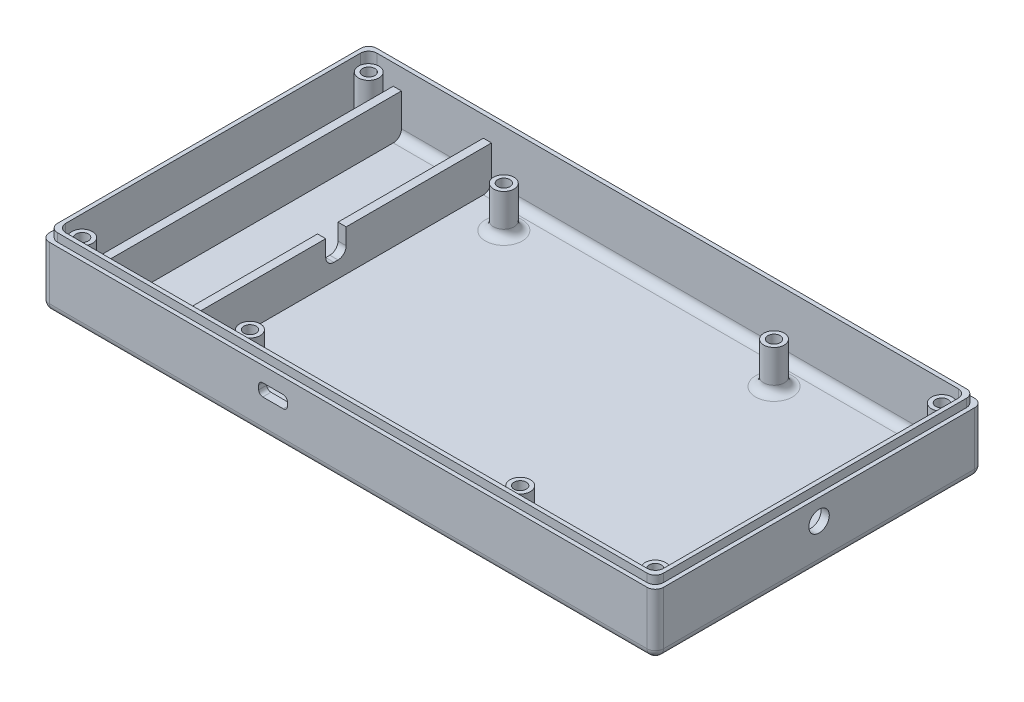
ISO-10303-21;
HEADER;
FILE_DESCRIPTION(('STEP AP214'),'2;1');
FILE_NAME('part.step','',(''),(''),'','','');
FILE_SCHEMA(('AUTOMOTIVE_DESIGN { 1 0 10303 214 1 1 1 1 }'));
ENDSEC;
DATA;
#1=APPLICATION_CONTEXT('core data for automotive mechanical design processes');
#2=APPLICATION_PROTOCOL_DEFINITION('international standard','automotive_design',2000,#1);
#3=PRODUCT_CONTEXT('',#1,'mechanical');
#4=PRODUCT('Part','Part','',(#3));
#5=PRODUCT_RELATED_PRODUCT_CATEGORY('part','',(#4));
#6=PRODUCT_DEFINITION_FORMATION('','',#4);
#7=PRODUCT_DEFINITION_CONTEXT('part definition',#1,'design');
#8=PRODUCT_DEFINITION('design','',#6,#7);
#9=PRODUCT_DEFINITION_SHAPE('','',#8);
#10=(LENGTH_UNIT() NAMED_UNIT(*) SI_UNIT(.MILLI.,.METRE.));
#11=(NAMED_UNIT(*) PLANE_ANGLE_UNIT() SI_UNIT($,.RADIAN.));
#12=(NAMED_UNIT(*) SI_UNIT($,.STERADIAN.) SOLID_ANGLE_UNIT());
#13=UNCERTAINTY_MEASURE_WITH_UNIT(LENGTH_MEASURE(1.E-05),#10,'distance_accuracy_value','');
#14=(GEOMETRIC_REPRESENTATION_CONTEXT(3) GLOBAL_UNCERTAINTY_ASSIGNED_CONTEXT((#13)) GLOBAL_UNIT_ASSIGNED_CONTEXT((#10,
#11,#12)) REPRESENTATION_CONTEXT('',''));
#15=CARTESIAN_POINT('',(0.,0.,0.));
#16=DIRECTION('',(0.,0.,1.));
#17=DIRECTION('',(1.,0.,0.));
#18=AXIS2_PLACEMENT_3D('',#15,#16,#17);
#19=CARTESIAN_POINT('',(0.,12.,0.));
#20=DIRECTION('',(0.,-1.,0.));
#21=DIRECTION('',(0.,0.,-1.));
#22=AXIS2_PLACEMENT_3D('',#19,#20,#21);
#23=PLANE('',#22);
#24=DIRECTION('',(0.,0.,1.));
#25=VECTOR('',#24,1.);
#26=CARTESIAN_POINT('',(-45.,12.,-38.));
#27=LINE('',#26,#25);
#28=CARTESIAN_POINT('',(-45.,12.,-38.));
#29=VERTEX_POINT('',#28);
#30=CARTESIAN_POINT('',(-45.,12.,-2.5));
#31=VERTEX_POINT('',#30);
#32=EDGE_CURVE('E500',#29,#31,#27,.T.);
#33=ORIENTED_EDGE('',*,*,#32,.T.);
#34=DIRECTION('',(-1.,0.,0.));
#35=VECTOR('',#34,1.);
#36=CARTESIAN_POINT('',(-45.,12.,-2.5));
#37=LINE('',#36,#35);
#38=CARTESIAN_POINT('',(-43.,12.,-2.5));
#39=VERTEX_POINT('',#38);
#40=EDGE_CURVE('E481',#39,#31,#37,.T.);
#41=ORIENTED_EDGE('',*,*,#40,.F.);
#42=DIRECTION('',(0.,0.,-1.));
#43=VECTOR('',#42,1.);
#44=CARTESIAN_POINT('',(-43.,12.,-38.));
#45=LINE('',#44,#43);
#46=CARTESIAN_POINT('',(-43.,12.,-38.));
#47=VERTEX_POINT('',#46);
#48=EDGE_CURVE('E490',#39,#47,#45,.T.);
#49=ORIENTED_EDGE('',*,*,#48,.T.);
#50=DIRECTION('',(-1.,0.,0.));
#51=VECTOR('',#50,1.);
#52=CARTESIAN_POINT('',(-43.,12.,-38.));
#53=LINE('',#52,#51);
#54=EDGE_CURVE('E489',#47,#29,#53,.T.);
#55=ORIENTED_EDGE('',*,*,#54,.T.);
#56=EDGE_LOOP('',(#33,#41,#49,#55));
#57=FACE_BOUND('',#56,.T.);
#58=ADVANCED_FACE('F41',(#57),#23,.F.);
#59=CARTESIAN_POINT('',(-73.,2.,-38.));
#60=DIRECTION('',(0.,0.,-1.));
#61=DIRECTION('',(-1.,0.,0.));
#62=AXIS2_PLACEMENT_3D('',#59,#60,#61);
#63=PLANE('',#62);
#64=DIRECTION('',(0.,-1.,0.));
#65=VECTOR('',#64,1.);
#66=CARTESIAN_POINT('',(-43.,12.,-38.));
#67=LINE('',#66,#65);
#68=CARTESIAN_POINT('',(-43.,4.,-38.));
#69=VERTEX_POINT('',#68);
#70=EDGE_CURVE('E529',#47,#69,#67,.T.);
#71=ORIENTED_EDGE('',*,*,#70,.T.);
#72=DIRECTION('',(-1.,0.,0.));
#73=VECTOR('',#72,1.);
#74=CARTESIAN_POINT('',(-73.,4.,-38.));
#75=LINE('',#74,#73);
#76=CARTESIAN_POINT('',(71.,4.,-38.));
#77=VERTEX_POINT('',#76);
#78=EDGE_CURVE('E968',#69,#77,#75,.F.);
#79=ORIENTED_EDGE('',*,*,#78,.T.);
#80=DIRECTION('',(0.,1.,0.));
#81=VECTOR('',#80,1.);
#82=CARTESIAN_POINT('',(71.,17.,-38.));
#83=LINE('',#82,#81);
#84=CARTESIAN_POINT('',(71.,17.,-38.));
#85=VERTEX_POINT('',#84);
#86=EDGE_CURVE('E1054',#77,#85,#83,.T.);
#87=ORIENTED_EDGE('',*,*,#86,.T.);
#88=DIRECTION('',(-1.,0.,0.));
#89=VECTOR('',#88,1.);
#90=CARTESIAN_POINT('',(-73.,17.,-38.));
#91=LINE('',#90,#89);
#92=CARTESIAN_POINT('',(-71.,17.,-38.));
#93=VERTEX_POINT('',#92);
#94=EDGE_CURVE('E636',#85,#93,#91,.T.);
#95=ORIENTED_EDGE('',*,*,#94,.T.);
#96=DIRECTION('',(0.,1.,0.));
#97=VECTOR('',#96,1.);
#98=CARTESIAN_POINT('',(-71.,4.,-38.));
#99=LINE('',#98,#97);
#100=CARTESIAN_POINT('',(-71.,4.,-38.));
#101=VERTEX_POINT('',#100);
#102=EDGE_CURVE('E1060',#93,#101,#99,.F.);
#103=ORIENTED_EDGE('',*,*,#102,.T.);
#104=CARTESIAN_POINT('',(-67.,4.,-38.));
#105=VERTEX_POINT('',#104);
#106=EDGE_CURVE('E774',#101,#105,#75,.F.);
#107=ORIENTED_EDGE('',*,*,#106,.T.);
#108=DIRECTION('',(0.,-1.,0.));
#109=VECTOR('',#108,1.);
#110=CARTESIAN_POINT('',(-67.,12.,-38.));
#111=LINE('',#110,#109);
#112=CARTESIAN_POINT('',(-67.,12.,-38.));
#113=VERTEX_POINT('',#112);
#114=EDGE_CURVE('E557',#113,#105,#111,.T.);
#115=ORIENTED_EDGE('',*,*,#114,.F.);
#116=DIRECTION('',(-1.,0.,0.));
#117=VECTOR('',#116,1.);
#118=CARTESIAN_POINT('',(-67.,12.,-38.));
#119=LINE('',#118,#117);
#120=CARTESIAN_POINT('',(-65.,12.,-38.));
#121=VERTEX_POINT('',#120);
#122=EDGE_CURVE('E553',#121,#113,#119,.T.);
#123=ORIENTED_EDGE('',*,*,#122,.F.);
#124=DIRECTION('',(0.,-1.,0.));
#125=VECTOR('',#124,1.);
#126=CARTESIAN_POINT('',(-65.,12.,-38.));
#127=LINE('',#126,#125);
#128=CARTESIAN_POINT('',(-65.,4.,-38.));
#129=VERTEX_POINT('',#128);
#130=EDGE_CURVE('E571',#121,#129,#127,.T.);
#131=ORIENTED_EDGE('',*,*,#130,.T.);
#132=CARTESIAN_POINT('',(-45.,4.,-38.));
#133=VERTEX_POINT('',#132);
#134=EDGE_CURVE('E973',#129,#133,#75,.F.);
#135=ORIENTED_EDGE('',*,*,#134,.T.);
#136=DIRECTION('',(0.,-1.,0.));
#137=VECTOR('',#136,1.);
#138=CARTESIAN_POINT('',(-45.,12.,-38.));
#139=LINE('',#138,#137);
#140=EDGE_CURVE('E525',#29,#133,#139,.T.);
#141=ORIENTED_EDGE('',*,*,#140,.F.);
#142=ORIENTED_EDGE('',*,*,#54,.F.);
#143=EDGE_LOOP('',(#71,#79,#87,#95,#103,#107,#115,#123,#131,#135,#141,#142));
#144=FACE_BOUND('',#143,.T.);
#145=ADVANCED_FACE('F865',(#144),#63,.F.);
#146=CARTESIAN_POINT('',(0.,2.,0.));
#147=DIRECTION('',(0.,1.,0.));
#148=DIRECTION('',(0.,0.,1.));
#149=AXIS2_PLACEMENT_3D('',#146,#147,#148);
#150=PLANE('',#149);
#151=CARTESIAN_POINT('',(-32.9999999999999,2.,31.));
#152=DIRECTION('',(0.,1.,0.));
#153=DIRECTION('',(0.,0.,1.));
#154=AXIS2_PLACEMENT_3D('',#151,#152,#153);
#155=CIRCLE('',#154,4.49999999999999);
#156=CARTESIAN_POINT('',(-32.9999999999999,2.,35.5));
#157=VERTEX_POINT('',#156);
#158=EDGE_CURVE('E1089',#157,#157,#155,.F.);
#159=ORIENTED_EDGE('',*,*,#158,.T.);
#160=EDGE_LOOP('',(#159));
#161=FACE_BOUND('',#160,.T.);
#162=CARTESIAN_POINT('',(32.9999999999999,2.,31.));
#163=DIRECTION('',(0.,1.,0.));
#164=DIRECTION('',(0.,0.,1.));
#165=AXIS2_PLACEMENT_3D('',#162,#163,#164);
#166=CIRCLE('',#165,4.49999999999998);
#167=CARTESIAN_POINT('',(32.9999999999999,2.,35.5));
#168=VERTEX_POINT('',#167);
#169=EDGE_CURVE('E1085',#168,#168,#166,.F.);
#170=ORIENTED_EDGE('',*,*,#169,.T.);
#171=EDGE_LOOP('',(#170));
#172=FACE_BOUND('',#171,.T.);
#173=CARTESIAN_POINT('',(33.,2.,-31.));
#174=DIRECTION('',(0.,1.,0.));
#175=DIRECTION('',(0.,0.,1.));
#176=AXIS2_PLACEMENT_3D('',#173,#174,#175);
#177=CIRCLE('',#176,4.5);
#178=CARTESIAN_POINT('',(33.,2.,-26.5));
#179=VERTEX_POINT('',#178);
#180=EDGE_CURVE('E1081',#179,#179,#177,.F.);
#181=ORIENTED_EDGE('',*,*,#180,.T.);
#182=EDGE_LOOP('',(#181));
#183=FACE_BOUND('',#182,.T.);
#184=CARTESIAN_POINT('',(-33.,2.,-31.));
#185=DIRECTION('',(0.,1.,0.));
#186=DIRECTION('',(0.,0.,1.));
#187=AXIS2_PLACEMENT_3D('',#184,#185,#186);
#188=CIRCLE('',#187,4.5);
#189=CARTESIAN_POINT('',(-33.,2.,-26.5));
#190=VERTEX_POINT('',#189);
#191=EDGE_CURVE('E1077',#190,#190,#188,.F.);
#192=ORIENTED_EDGE('',*,*,#191,.T.);
#193=EDGE_LOOP('',(#192));
#194=FACE_BOUND('',#193,.T.);
#195=DIRECTION('',(-1.,0.,0.));
#196=VECTOR('',#195,1.);
#197=CARTESIAN_POINT('',(0.,2.,-36.));
#198=LINE('',#197,#196);
#199=CARTESIAN_POINT('',(67.7087121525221,2.,-36.));
#200=VERTEX_POINT('',#199);
#201=CARTESIAN_POINT('',(-43.,2.,-36.));
#202=VERTEX_POINT('',#201);
#203=EDGE_CURVE('E716',#200,#202,#198,.T.);
#204=ORIENTED_EDGE('',*,*,#203,.T.);
#205=DIRECTION('',(0.,0.,-1.));
#206=VECTOR('',#205,1.);
#207=CARTESIAN_POINT('',(-43.,2.,-38.));
#208=LINE('',#207,#206);
#209=CARTESIAN_POINT('',(-43.,2.,36.));
#210=VERTEX_POINT('',#209);
#211=EDGE_CURVE('E507',#210,#202,#208,.T.);
#212=ORIENTED_EDGE('',*,*,#211,.F.);
#213=DIRECTION('',(1.,0.,0.));
#214=VECTOR('',#213,1.);
#215=CARTESIAN_POINT('',(0.,2.,36.));
#216=LINE('',#215,#214);
#217=CARTESIAN_POINT('',(67.7087121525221,2.,36.));
#218=VERTEX_POINT('',#217);
#219=EDGE_CURVE('E724',#210,#218,#216,.T.);
#220=ORIENTED_EDGE('',*,*,#219,.T.);
#221=CARTESIAN_POINT('',(70.,2.,35.));
#222=DIRECTION('',(0.,1.,0.));
#223=DIRECTION('',(0.,0.,1.));
#224=AXIS2_PLACEMENT_3D('',#221,#222,#223);
#225=CIRCLE('',#224,2.5);
#226=CARTESIAN_POINT('',(71.,2.,32.7087121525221));
#227=VERTEX_POINT('',#226);
#228=EDGE_CURVE('E704',#227,#218,#225,.T.);
#229=ORIENTED_EDGE('',*,*,#228,.F.);
#230=DIRECTION('',(0.,0.,-1.));
#231=VECTOR('',#230,1.);
#232=CARTESIAN_POINT('',(71.,2.,0.));
#233=LINE('',#232,#231);
#234=CARTESIAN_POINT('',(71.,2.,-32.7087121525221));
#235=VERTEX_POINT('',#234);
#236=EDGE_CURVE('E712',#227,#235,#233,.T.);
#237=ORIENTED_EDGE('',*,*,#236,.T.);
#238=CARTESIAN_POINT('',(70.,2.,-35.));
#239=DIRECTION('',(0.,1.,0.));
#240=DIRECTION('',(0.,0.,1.));
#241=AXIS2_PLACEMENT_3D('',#238,#239,#240);
#242=CIRCLE('',#241,2.5);
#243=EDGE_CURVE('E708',#200,#235,#242,.T.);
#244=ORIENTED_EDGE('',*,*,#243,.F.);
#245=EDGE_LOOP('',(#204,#212,#220,#229,#237,#244));
#246=FACE_BOUND('',#245,.T.);
#247=ADVANCED_FACE('F871',(#161,#172,#183,#194,#246),#150,.T.);
#248=CARTESIAN_POINT('',(-65.,2.,36.));
#249=VERTEX_POINT('',#248);
#250=CARTESIAN_POINT('',(-45.,2.,36.));
#251=VERTEX_POINT('',#250);
#252=EDGE_CURVE('E730',#249,#251,#216,.T.);
#253=ORIENTED_EDGE('',*,*,#252,.T.);
#254=DIRECTION('',(0.,0.,1.));
#255=VECTOR('',#254,1.);
#256=CARTESIAN_POINT('',(-45.,2.,-38.));
#257=LINE('',#256,#255);
#258=CARTESIAN_POINT('',(-45.,2.,-36.));
#259=VERTEX_POINT('',#258);
#260=EDGE_CURVE('E511',#259,#251,#257,.T.);
#261=ORIENTED_EDGE('',*,*,#260,.F.);
#262=CARTESIAN_POINT('',(-65.,2.,-36.));
#263=VERTEX_POINT('',#262);
#264=EDGE_CURVE('E721',#259,#263,#198,.T.);
#265=ORIENTED_EDGE('',*,*,#264,.T.);
#266=DIRECTION('',(0.,0.,-1.));
#267=VECTOR('',#266,1.);
#268=CARTESIAN_POINT('',(-65.,2.,-38.));
#269=LINE('',#268,#267);
#270=EDGE_CURVE('E546',#249,#263,#269,.T.);
#271=ORIENTED_EDGE('',*,*,#270,.F.);
#272=EDGE_LOOP('',(#253,#261,#265,#271));
#273=FACE_BOUND('',#272,.T.);
#274=ADVANCED_FACE('F1792',(#273),#150,.T.);
#275=CARTESIAN_POINT('',(0.,4.,-36.));
#276=DIRECTION('',(-1.,0.,0.));
#277=DIRECTION('',(0.,0.,1.));
#278=AXIS2_PLACEMENT_3D('',#275,#276,#277);
#279=CYLINDRICAL_SURFACE('',#278,2.);
#280=CARTESIAN_POINT('',(-43.,4.,-36.));
#281=DIRECTION('',(-1.,0.,0.));
#282=DIRECTION('',(0.,0.,1.));
#283=AXIS2_PLACEMENT_3D('',#280,#281,#282);
#284=CIRCLE('',#283,2.);
#285=EDGE_CURVE('E536',#202,#69,#284,.F.);
#286=ORIENTED_EDGE('',*,*,#285,.F.);
#287=ORIENTED_EDGE('',*,*,#203,.F.);
#288=CARTESIAN_POINT('',(71.7677669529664,2.15323691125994,-36.7677669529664));
#289=CARTESIAN_POINT('',(71.7101849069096,2.17716044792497,-36.8253235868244));
#290=CARTESIAN_POINT('',(71.6502438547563,2.2029113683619,-36.8796658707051));
#291=CARTESIAN_POINT('',(71.5259913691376,2.25665783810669,-36.9818791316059));
#292=CARTESIAN_POINT('',(71.4616797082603,2.28465350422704,-37.0297497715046));
#293=CARTESIAN_POINT('',(71.3282068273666,2.34183334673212,-37.1195313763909));
#294=CARTESIAN_POINT('',(71.2589948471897,2.37102803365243,-37.1613599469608));
#295=CARTESIAN_POINT('',(71.1166407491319,2.42866138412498,-37.2382258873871));
#296=CARTESIAN_POINT('',(71.0435000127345,2.45710030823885,-37.2732656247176));
#297=CARTESIAN_POINT('',(70.8677578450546,2.52067738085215,-37.3471094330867));
#298=CARTESIAN_POINT('',(70.7635925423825,2.55480716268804,-37.3831450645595));
#299=CARTESIAN_POINT('',(70.5492213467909,2.61291853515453,-37.4414295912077));
#300=CARTESIAN_POINT('',(70.4390530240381,2.63695652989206,-37.4637554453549));
#301=CARTESIAN_POINT('',(70.2325042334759,2.66682817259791,-37.4909747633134));
#302=CARTESIAN_POINT('',(70.1367713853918,2.67497529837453,-37.4981016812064));
#303=CARTESIAN_POINT('',(69.9448755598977,2.67851765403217,-37.5012316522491));
#304=CARTESIAN_POINT('',(69.8487126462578,2.67391471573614,-37.497236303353));
#305=CARTESIAN_POINT('',(69.6593385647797,2.65307705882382,-37.4785034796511));
#306=CARTESIAN_POINT('',(69.5661145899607,2.63690329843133,-37.4638222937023));
#307=CARTESIAN_POINT('',(69.3836222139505,2.59599456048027,-37.4246281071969));
#308=CARTESIAN_POINT('',(69.2943628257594,2.57124109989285,-37.4000938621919));
#309=CARTESIAN_POINT('',(69.0692947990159,2.50043675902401,-37.3248749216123));
#310=CARTESIAN_POINT('',(68.9370419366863,2.45043017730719,-37.267299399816));
#311=CARTESIAN_POINT('',(68.6847674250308,2.34822451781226,-37.1309058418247));
#312=CARTESIAN_POINT('',(68.5647669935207,2.29602185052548,-37.0520517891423));
#313=CARTESIAN_POINT('',(68.3555003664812,2.20533493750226,-36.8869492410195));
#314=CARTESIAN_POINT('',(68.2643289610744,2.16596930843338,-36.8036125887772));
#315=CARTESIAN_POINT('',(68.0939815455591,2.09688400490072,-36.6224782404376));
#316=CARTESIAN_POINT('',(68.0147519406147,2.06712050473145,-36.5247492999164));
#317=CARTESIAN_POINT('',(67.8976709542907,2.03065853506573,-36.3551755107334));
#318=CARTESIAN_POINT('',(67.8554236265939,2.01949707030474,-36.2873125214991));
#319=CARTESIAN_POINT('',(67.7771288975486,2.00414057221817,-36.1469025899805));
#320=CARTESIAN_POINT('',(67.7411153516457,1.99998257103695,-36.0743328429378));
#321=CARTESIAN_POINT('',(67.7087121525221,2.,-36.));
#322=B_SPLINE_CURVE_WITH_KNOTS('',3,(#288,#289,#290,#291,#292,#293,#294,#295,#296,#297,#298,
#299,#300,#301,#302,#303,#304,#305,#306,#307,#308,#309,#310,#311,#312,#313,#314,#315,#316,#317,
#318,#319,#320,#321),.UNSPECIFIED.,.F.,.F.,(4,2,2,2,2,2,2,2,2,2,2,2,2,2,2,2,4),(0.,
0.254368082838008,0.508749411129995,0.766325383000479,1.02381136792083,1.36881331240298,
1.71186047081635,1.99949102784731,2.28708026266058,2.57316545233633,2.85987081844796,
3.31548149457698,3.77186823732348,4.15937962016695,4.54509645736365,4.78661585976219,
5.02940837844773),.UNSPECIFIED.);
#323=CARTESIAN_POINT('',(71.0000000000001,2.47272278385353,-37.2912878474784));
#324=VERTEX_POINT('',#323);
#325=EDGE_CURVE('E773',#324,#200,#322,.T.);
#326=ORIENTED_EDGE('',*,*,#325,.F.);
#327=CARTESIAN_POINT('',(71.,4.,-36.));
#328=DIRECTION('',(-1.,0.,0.));
#329=DIRECTION('',(0.,0.,1.));
#330=AXIS2_PLACEMENT_3D('',#327,#328,#329);
#331=CIRCLE('',#330,2.);
#332=EDGE_CURVE('E1010',#324,#77,#331,.F.);
#333=ORIENTED_EDGE('',*,*,#332,.T.);
#334=ORIENTED_EDGE('',*,*,#78,.F.);
#335=EDGE_LOOP('',(#286,#287,#326,#333,#334));
#336=FACE_BOUND('',#335,.T.);
#337=ADVANCED_FACE('F1049',(#336),#279,.F.);
#338=CARTESIAN_POINT('',(-45.,4.,-36.));
#339=DIRECTION('',(1.,0.,0.));
#340=DIRECTION('',(0.,0.,-1.));
#341=AXIS2_PLACEMENT_3D('',#338,#339,#340);
#342=CIRCLE('',#341,2.);
#343=EDGE_CURVE('E532',#133,#259,#342,.F.);
#344=ORIENTED_EDGE('',*,*,#343,.F.);
#345=ORIENTED_EDGE('',*,*,#134,.F.);
#346=CARTESIAN_POINT('',(-65.,4.,-36.));
#347=DIRECTION('',(-1.,0.,0.));
#348=DIRECTION('',(0.,0.,1.));
#349=AXIS2_PLACEMENT_3D('',#346,#347,#348);
#350=CIRCLE('',#349,2.);
#351=EDGE_CURVE('E582',#263,#129,#350,.F.);
#352=ORIENTED_EDGE('',*,*,#351,.F.);
#353=ORIENTED_EDGE('',*,*,#264,.F.);
#354=EDGE_LOOP('',(#344,#345,#352,#353));
#355=FACE_BOUND('',#354,.T.);
#356=ADVANCED_FACE('F1787',(#355),#279,.F.);
#357=CARTESIAN_POINT('',(-67.7087121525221,2.,36.));
#358=VERTEX_POINT('',#357);
#359=CARTESIAN_POINT('',(-67.,2.,36.));
#360=VERTEX_POINT('',#359);
#361=EDGE_CURVE('E725',#358,#360,#216,.T.);
#362=ORIENTED_EDGE('',*,*,#361,.T.);
#363=DIRECTION('',(0.,0.,1.));
#364=VECTOR('',#363,1.);
#365=CARTESIAN_POINT('',(-67.,2.,-38.));
#366=LINE('',#365,#364);
#367=CARTESIAN_POINT('',(-67.,2.,-36.));
#368=VERTEX_POINT('',#367);
#369=EDGE_CURVE('E540',#368,#360,#366,.T.);
#370=ORIENTED_EDGE('',*,*,#369,.F.);
#371=CARTESIAN_POINT('',(-67.7087121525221,2.,-36.));
#372=VERTEX_POINT('',#371);
#373=EDGE_CURVE('E715',#368,#372,#198,.T.);
#374=ORIENTED_EDGE('',*,*,#373,.T.);
#375=CARTESIAN_POINT('',(-70.,2.,-35.));
#376=DIRECTION('',(0.,1.,0.));
#377=DIRECTION('',(0.,0.,1.));
#378=AXIS2_PLACEMENT_3D('',#375,#376,#377);
#379=CIRCLE('',#378,2.5);
#380=CARTESIAN_POINT('',(-71.,2.,-32.7087121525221));
#381=VERTEX_POINT('',#380);
#382=EDGE_CURVE('E696',#381,#372,#379,.T.);
#383=ORIENTED_EDGE('',*,*,#382,.F.);
#384=DIRECTION('',(0.,0.,1.));
#385=VECTOR('',#384,1.);
#386=CARTESIAN_POINT('',(-71.,2.,0.));
#387=LINE('',#386,#385);
#388=CARTESIAN_POINT('',(-71.,2.,32.7087121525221));
#389=VERTEX_POINT('',#388);
#390=EDGE_CURVE('E720',#381,#389,#387,.T.);
#391=ORIENTED_EDGE('',*,*,#390,.T.);
#392=CARTESIAN_POINT('',(-70.,2.,35.));
#393=DIRECTION('',(0.,1.,0.));
#394=DIRECTION('',(0.,0.,1.));
#395=AXIS2_PLACEMENT_3D('',#392,#393,#394);
#396=CIRCLE('',#395,2.5);
#397=EDGE_CURVE('E700',#358,#389,#396,.T.);
#398=ORIENTED_EDGE('',*,*,#397,.F.);
#399=EDGE_LOOP('',(#362,#370,#374,#383,#391,#398));
#400=FACE_BOUND('',#399,.T.);
#401=ADVANCED_FACE('F1786',(#400),#150,.T.);
#402=CARTESIAN_POINT('',(-67.,4.,-36.));
#403=DIRECTION('',(1.,0.,0.));
#404=DIRECTION('',(0.,0.,-1.));
#405=AXIS2_PLACEMENT_3D('',#402,#403,#404);
#406=CIRCLE('',#405,2.);
#407=EDGE_CURVE('E586',#105,#368,#406,.F.);
#408=ORIENTED_EDGE('',*,*,#407,.F.);
#409=ORIENTED_EDGE('',*,*,#106,.F.);
#410=CARTESIAN_POINT('',(-71.,4.,-36.));
#411=DIRECTION('',(-1.,0.,0.));
#412=DIRECTION('',(0.,0.,1.));
#413=AXIS2_PLACEMENT_3D('',#410,#411,#412);
#414=CIRCLE('',#413,2.);
#415=CARTESIAN_POINT('',(-71.,2.47272278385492,-37.2912878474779));
#416=VERTEX_POINT('',#415);
#417=EDGE_CURVE('E1034',#101,#416,#414,.T.);
#418=ORIENTED_EDGE('',*,*,#417,.T.);
#419=CARTESIAN_POINT('',(-67.7087121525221,2.,-36.));
#420=CARTESIAN_POINT('',(-67.7321522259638,1.99999179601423,-36.0537418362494));
#421=CARTESIAN_POINT('',(-67.7574912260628,2.0021652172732,-36.1066120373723));
#422=CARTESIAN_POINT('',(-67.8116276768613,2.01039517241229,-36.2101298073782));
#423=CARTESIAN_POINT('',(-67.840419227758,2.01644515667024,-36.2607809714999));
#424=CARTESIAN_POINT('',(-67.9008832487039,2.03186986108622,-36.3590464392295));
#425=CARTESIAN_POINT('',(-67.9325222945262,2.04120900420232,-36.4066870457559));
#426=CARTESIAN_POINT('',(-67.9986507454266,2.062738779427,-36.4992804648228));
#427=CARTESIAN_POINT('',(-68.0331415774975,2.0749308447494,-36.5442319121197));
#428=CARTESIAN_POINT('',(-68.1560591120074,2.12089638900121,-36.6937175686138));
#429=CARTESIAN_POINT('',(-68.2509181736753,2.1605504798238,-36.7912784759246));
#430=CARTESIAN_POINT('',(-68.4534020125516,2.2475167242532,-36.9688406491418));
#431=CARTESIAN_POINT('',(-68.56109313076,2.29486918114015,-37.048743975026));
#432=CARTESIAN_POINT('',(-68.7895041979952,2.39140509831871,-37.1916182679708));
#433=CARTESIAN_POINT('',(-68.9104252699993,2.44060619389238,-37.2542553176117));
#434=CARTESIAN_POINT('',(-69.1630207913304,2.53163108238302,-37.3596790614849));
#435=CARTESIAN_POINT('',(-69.2946574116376,2.57347931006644,-37.4025323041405));
#436=CARTESIAN_POINT('',(-69.5248508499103,2.62881032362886,-37.4563136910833));
#437=CARTESIAN_POINT('',(-69.6208631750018,2.6470717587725,-37.4730363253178));
#438=CARTESIAN_POINT('',(-69.8155841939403,2.67148298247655,-37.495103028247));
#439=CARTESIAN_POINT('',(-69.9142854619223,2.6776632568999,-37.5004757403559));
#440=CARTESIAN_POINT('',(-70.1117142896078,2.67650878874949,-37.499456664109));
#441=CARTESIAN_POINT('',(-70.2104415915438,2.66915031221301,-37.4930442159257));
#442=CARTESIAN_POINT('',(-70.4050252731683,2.64259726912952,-37.4689312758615));
#443=CARTESIAN_POINT('',(-70.5008725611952,2.62336866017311,-37.451198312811));
#444=CARTESIAN_POINT('',(-70.7256974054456,2.5672533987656,-37.3961781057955));
#445=CARTESIAN_POINT('',(-70.8524135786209,2.52637120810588,-37.3538849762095));
#446=CARTESIAN_POINT('',(-71.0956876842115,2.43807109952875,-37.2509930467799));
#447=CARTESIAN_POINT('',(-71.2122301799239,2.39064352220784,-37.1903670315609));
#448=CARTESIAN_POINT('',(-71.403481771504,2.3098609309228,-37.0710195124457));
#449=CARTESIAN_POINT('',(-71.4807582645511,2.27628872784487,-37.0165301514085));
#450=CARTESIAN_POINT('',(-71.6290020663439,2.21205704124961,-36.8987464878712));
#451=CARTESIAN_POINT('',(-71.6999939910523,2.18138615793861,-36.8354892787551));
#452=CARTESIAN_POINT('',(-71.7677669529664,2.15323691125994,-36.7677669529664));
#453=B_SPLINE_CURVE_WITH_KNOTS('',3,(#419,#420,#421,#422,#423,#424,#425,#426,#427,#428,#429,
#430,#431,#432,#433,#434,#435,#436,#437,#438,#439,#440,#441,#442,#443,#444,#445,#446,#447,#448,
#449,#450,#451,#452),.UNSPECIFIED.,.F.,.F.,(4,2,2,2,2,2,2,2,2,2,2,2,2,2,2,2,4),(0.,
0.175758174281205,0.351220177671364,0.524839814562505,0.698546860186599,1.12129669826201,
1.54633558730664,1.97909478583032,2.41038747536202,2.70666664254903,3.0021972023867,
3.29824633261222,3.59514847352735,4.01201382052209,4.42950107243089,4.72993142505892,
5.02912750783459),.UNSPECIFIED.);
#454=EDGE_CURVE('E956',#372,#416,#453,.T.);
#455=ORIENTED_EDGE('',*,*,#454,.F.);
#456=ORIENTED_EDGE('',*,*,#373,.F.);
#457=EDGE_LOOP('',(#408,#409,#418,#455,#456));
#458=FACE_BOUND('',#457,.T.);
#459=ADVANCED_FACE('F1781',(#458),#279,.F.);
#460=CARTESIAN_POINT('',(0.,0.,0.));
#461=DIRECTION('',(0.,1.,0.));
#462=DIRECTION('',(0.,0.,1.));
#463=AXIS2_PLACEMENT_3D('',#460,#461,#462);
#464=PLANE('',#463);
#465=DIRECTION('',(0.,0.,1.));
#466=VECTOR('',#465,1.);
#467=CARTESIAN_POINT('',(-73.,0.,0.));
#468=LINE('',#467,#466);
#469=CARTESIAN_POINT('',(-73.,0.,-36.802775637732));
#470=VERTEX_POINT('',#469);
#471=CARTESIAN_POINT('',(-73.,0.,-38.));
#472=VERTEX_POINT('',#471);
#473=EDGE_CURVE('E1290',#470,#472,#468,.F.);
#474=ORIENTED_EDGE('',*,*,#473,.T.);
#475=DIRECTION('',(-1.,0.,0.));
#476=VECTOR('',#475,1.);
#477=CARTESIAN_POINT('',(0.,0.,-38.));
#478=LINE('',#477,#476);
#479=CARTESIAN_POINT('',(-71.802775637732,0.,-38.));
#480=VERTEX_POINT('',#479);
#481=EDGE_CURVE('E1293',#472,#480,#478,.F.);
#482=ORIENTED_EDGE('',*,*,#481,.T.);
#483=CARTESIAN_POINT('',(-70.,0.,-35.));
#484=DIRECTION('',(0.,1.,0.));
#485=DIRECTION('',(0.,0.,1.));
#486=AXIS2_PLACEMENT_3D('',#483,#484,#485);
#487=CIRCLE('',#486,3.5);
#488=EDGE_CURVE('E1287',#480,#470,#487,.T.);
#489=ORIENTED_EDGE('',*,*,#488,.T.);
#490=EDGE_LOOP('',(#474,#482,#489));
#491=FACE_BOUND('',#490,.T.);
#492=ADVANCED_FACE('F1647',(#491),#464,.F.);
#493=DIRECTION('',(1.,0.,0.));
#494=VECTOR('',#493,1.);
#495=CARTESIAN_POINT('',(0.,0.,38.));
#496=LINE('',#495,#494);
#497=CARTESIAN_POINT('',(-71.802775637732,0.,38.));
#498=VERTEX_POINT('',#497);
#499=CARTESIAN_POINT('',(-73.,0.,38.));
#500=VERTEX_POINT('',#499);
#501=EDGE_CURVE('E1280',#498,#500,#496,.F.);
#502=ORIENTED_EDGE('',*,*,#501,.T.);
#503=DIRECTION('',(0.,0.,1.));
#504=VECTOR('',#503,1.);
#505=CARTESIAN_POINT('',(-73.,0.,0.));
#506=LINE('',#505,#504);
#507=CARTESIAN_POINT('',(-73.,0.,36.802775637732));
#508=VERTEX_POINT('',#507);
#509=EDGE_CURVE('E1283',#500,#508,#506,.F.);
#510=ORIENTED_EDGE('',*,*,#509,.T.);
#511=CARTESIAN_POINT('',(-70.,0.,35.));
#512=DIRECTION('',(0.,1.,0.));
#513=DIRECTION('',(0.,0.,1.));
#514=AXIS2_PLACEMENT_3D('',#511,#512,#513);
#515=CIRCLE('',#514,3.5);
#516=EDGE_CURVE('E1277',#508,#498,#515,.T.);
#517=ORIENTED_EDGE('',*,*,#516,.T.);
#518=EDGE_LOOP('',(#502,#510,#517));
#519=FACE_BOUND('',#518,.T.);
#520=ADVANCED_FACE('F1690',(#519),#464,.F.);
#521=DIRECTION('',(0.,0.,-1.));
#522=VECTOR('',#521,1.);
#523=CARTESIAN_POINT('',(73.,0.,0.));
#524=LINE('',#523,#522);
#525=CARTESIAN_POINT('',(73.,0.,36.802775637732));
#526=VERTEX_POINT('',#525);
#527=CARTESIAN_POINT('',(73.,0.,38.));
#528=VERTEX_POINT('',#527);
#529=EDGE_CURVE('E1270',#526,#528,#524,.F.);
#530=ORIENTED_EDGE('',*,*,#529,.T.);
#531=DIRECTION('',(1.,0.,0.));
#532=VECTOR('',#531,1.);
#533=CARTESIAN_POINT('',(0.,0.,38.));
#534=LINE('',#533,#532);
#535=CARTESIAN_POINT('',(71.802775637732,0.,38.));
#536=VERTEX_POINT('',#535);
#537=EDGE_CURVE('E1273',#528,#536,#534,.F.);
#538=ORIENTED_EDGE('',*,*,#537,.T.);
#539=CARTESIAN_POINT('',(70.,0.,35.));
#540=DIRECTION('',(0.,1.,0.));
#541=DIRECTION('',(0.,0.,1.));
#542=AXIS2_PLACEMENT_3D('',#539,#540,#541);
#543=CIRCLE('',#542,3.5);
#544=EDGE_CURVE('E1267',#536,#526,#543,.T.);
#545=ORIENTED_EDGE('',*,*,#544,.T.);
#546=EDGE_LOOP('',(#530,#538,#545));
#547=FACE_BOUND('',#546,.T.);
#548=ADVANCED_FACE('F1718',(#547),#464,.F.);
#549=CARTESIAN_POINT('',(70.,0.,-35.));
#550=DIRECTION('',(0.,1.,0.));
#551=DIRECTION('',(0.,0.,1.));
#552=AXIS2_PLACEMENT_3D('',#549,#550,#551);
#553=CIRCLE('',#552,3.5);
#554=CARTESIAN_POINT('',(73.,0.,-36.802775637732));
#555=VERTEX_POINT('',#554);
#556=CARTESIAN_POINT('',(71.802775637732,0.,-38.));
#557=VERTEX_POINT('',#556);
#558=EDGE_CURVE('E1257',#555,#557,#553,.T.);
#559=ORIENTED_EDGE('',*,*,#558,.T.);
#560=DIRECTION('',(-1.,0.,0.));
#561=VECTOR('',#560,1.);
#562=CARTESIAN_POINT('',(0.,0.,-38.));
#563=LINE('',#562,#561);
#564=CARTESIAN_POINT('',(73.,0.,-38.));
#565=VERTEX_POINT('',#564);
#566=EDGE_CURVE('E1263',#557,#565,#563,.F.);
#567=ORIENTED_EDGE('',*,*,#566,.T.);
#568=DIRECTION('',(0.,0.,-1.));
#569=VECTOR('',#568,1.);
#570=CARTESIAN_POINT('',(73.,0.,0.));
#571=LINE('',#570,#569);
#572=EDGE_CURVE('E1260',#565,#555,#571,.F.);
#573=ORIENTED_EDGE('',*,*,#572,.T.);
#574=EDGE_LOOP('',(#559,#567,#573));
#575=FACE_BOUND('',#574,.T.);
#576=ADVANCED_FACE('F1713',(#575),#464,.F.);
#577=CARTESIAN_POINT('',(75.,15.,-40.));
#578=DIRECTION('',(-1.,0.,0.));
#579=DIRECTION('',(0.,0.,1.));
#580=AXIS2_PLACEMENT_3D('',#577,#578,#579);
#581=PLANE('',#580);
#582=CARTESIAN_POINT('',(75.,10.,0.));
#583=DIRECTION('',(1.,0.,0.));
#584=DIRECTION('',(0.,0.,-1.));
#585=AXIS2_PLACEMENT_3D('',#582,#583,#584);
#586=CIRCLE('',#585,2.5);
#587=CARTESIAN_POINT('',(75.,10.,-2.49999999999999));
#588=VERTEX_POINT('',#587);
#589=EDGE_CURVE('E624',#588,#588,#586,.T.);
#590=ORIENTED_EDGE('',*,*,#589,.F.);
#591=EDGE_LOOP('',(#590));
#592=FACE_BOUND('',#591,.T.);
#593=DIRECTION('',(0.,0.,-1.));
#594=VECTOR('',#593,1.);
#595=CARTESIAN_POINT('',(75.,15.,-40.));
#596=LINE('',#595,#594);
#597=CARTESIAN_POINT('',(75.,15.,38.));
#598=VERTEX_POINT('',#597);
#599=CARTESIAN_POINT('',(75.,15.,-38.));
#600=VERTEX_POINT('',#599);
#601=EDGE_CURVE('E666',#598,#600,#596,.T.);
#602=ORIENTED_EDGE('',*,*,#601,.F.);
#603=DIRECTION('',(0.,-1.,0.));
#604=VECTOR('',#603,1.);
#605=CARTESIAN_POINT('',(75.,15.,38.));
#606=LINE('',#605,#604);
#607=CARTESIAN_POINT('',(75.,2.,38.));
#608=VERTEX_POINT('',#607);
#609=EDGE_CURVE('E1321',#598,#608,#606,.T.);
#610=ORIENTED_EDGE('',*,*,#609,.T.);
#611=DIRECTION('',(0.,0.,-1.));
#612=VECTOR('',#611,1.);
#613=CARTESIAN_POINT('',(75.,2.,-40.));
#614=LINE('',#613,#612);
#615=CARTESIAN_POINT('',(75.,2.,-38.));
#616=VERTEX_POINT('',#615);
#617=EDGE_CURVE('E1318',#608,#616,#614,.T.);
#618=ORIENTED_EDGE('',*,*,#617,.T.);
#619=DIRECTION('',(0.,-1.,0.));
#620=VECTOR('',#619,1.);
#621=CARTESIAN_POINT('',(75.,15.,-38.));
#622=LINE('',#621,#620);
#623=EDGE_CURVE('E1315',#616,#600,#622,.F.);
#624=ORIENTED_EDGE('',*,*,#623,.T.);
#625=EDGE_LOOP('',(#602,#610,#618,#624));
#626=FACE_BOUND('',#625,.T.);
#627=ADVANCED_FACE('F1611',(#592,#626),#581,.F.);
#628=CARTESIAN_POINT('',(-75.,15.,-40.));
#629=DIRECTION('',(0.,0.,1.));
#630=DIRECTION('',(1.,0.,0.));
#631=AXIS2_PLACEMENT_3D('',#628,#629,#630);
#632=PLANE('',#631);
#633=DIRECTION('',(-1.,0.,0.));
#634=VECTOR('',#633,1.);
#635=CARTESIAN_POINT('',(-75.,2.,-40.));
#636=LINE('',#635,#634);
#637=CARTESIAN_POINT('',(73.,2.,-40.));
#638=VERTEX_POINT('',#637);
#639=CARTESIAN_POINT('',(-73.,2.,-40.));
#640=VERTEX_POINT('',#639);
#641=EDGE_CURVE('E1217',#638,#640,#636,.T.);
#642=ORIENTED_EDGE('',*,*,#641,.T.);
#643=DIRECTION('',(0.,-1.,0.));
#644=VECTOR('',#643,1.);
#645=CARTESIAN_POINT('',(-73.,15.,-40.));
#646=LINE('',#645,#644);
#647=CARTESIAN_POINT('',(-73.,15.,-40.));
#648=VERTEX_POINT('',#647);
#649=EDGE_CURVE('E1223',#640,#648,#646,.F.);
#650=ORIENTED_EDGE('',*,*,#649,.T.);
#651=DIRECTION('',(-1.,0.,0.));
#652=VECTOR('',#651,1.);
#653=CARTESIAN_POINT('',(-75.,15.,-40.));
#654=LINE('',#653,#652);
#655=CARTESIAN_POINT('',(73.,15.,-40.));
#656=VERTEX_POINT('',#655);
#657=EDGE_CURVE('E684',#656,#648,#654,.T.);
#658=ORIENTED_EDGE('',*,*,#657,.F.);
#659=DIRECTION('',(0.,-1.,0.));
#660=VECTOR('',#659,1.);
#661=CARTESIAN_POINT('',(73.,15.,-40.));
#662=LINE('',#661,#660);
#663=EDGE_CURVE('E1214',#656,#638,#662,.T.);
#664=ORIENTED_EDGE('',*,*,#663,.T.);
#665=EDGE_LOOP('',(#642,#650,#658,#664));
#666=FACE_BOUND('',#665,.T.);
#667=ADVANCED_FACE('F1662',(#666),#632,.F.);
#668=CARTESIAN_POINT('',(-75.,15.,-40.));
#669=DIRECTION('',(1.,0.,0.));
#670=DIRECTION('',(0.,0.,-1.));
#671=AXIS2_PLACEMENT_3D('',#668,#669,#670);
#672=PLANE('',#671);
#673=DIRECTION('',(0.,0.,1.));
#674=VECTOR('',#673,1.);
#675=CARTESIAN_POINT('',(-75.,15.,-40.));
#676=LINE('',#675,#674);
#677=CARTESIAN_POINT('',(-75.,15.,-38.));
#678=VERTEX_POINT('',#677);
#679=CARTESIAN_POINT('',(-75.,15.,38.));
#680=VERTEX_POINT('',#679);
#681=EDGE_CURVE('E688',#678,#680,#676,.T.);
#682=ORIENTED_EDGE('',*,*,#681,.F.);
#683=DIRECTION('',(0.,-1.,0.));
#684=VECTOR('',#683,1.);
#685=CARTESIAN_POINT('',(-75.,15.,-38.));
#686=LINE('',#685,#684);
#687=CARTESIAN_POINT('',(-75.,2.,-38.));
#688=VERTEX_POINT('',#687);
#689=EDGE_CURVE('E1303',#678,#688,#686,.T.);
#690=ORIENTED_EDGE('',*,*,#689,.T.);
#691=DIRECTION('',(0.,0.,1.));
#692=VECTOR('',#691,1.);
#693=CARTESIAN_POINT('',(-75.,2.,-40.));
#694=LINE('',#693,#692);
#695=CARTESIAN_POINT('',(-75.,2.,38.));
#696=VERTEX_POINT('',#695);
#697=EDGE_CURVE('E1300',#688,#696,#694,.T.);
#698=ORIENTED_EDGE('',*,*,#697,.T.);
#699=DIRECTION('',(0.,-1.,0.));
#700=VECTOR('',#699,1.);
#701=CARTESIAN_POINT('',(-75.,15.,38.));
#702=LINE('',#701,#700);
#703=EDGE_CURVE('E1297',#696,#680,#702,.F.);
#704=ORIENTED_EDGE('',*,*,#703,.T.);
#705=EDGE_LOOP('',(#682,#690,#698,#704));
#706=FACE_BOUND('',#705,.T.);
#707=ADVANCED_FACE('F1666',(#706),#672,.F.);
#708=CARTESIAN_POINT('',(-75.,15.,40.));
#709=DIRECTION('',(0.,0.,-1.));
#710=DIRECTION('',(-1.,0.,0.));
#711=AXIS2_PLACEMENT_3D('',#708,#709,#710);
#712=PLANE('',#711);
#713=DIRECTION('',(0.,1.,0.));
#714=VECTOR('',#713,1.);
#715=CARTESIAN_POINT('',(-14.8750122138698,11.3264876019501,40.));
#716=LINE('',#715,#714);
#717=CARTESIAN_POINT('',(-14.8750122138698,9.32648760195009,40.));
#718=VERTEX_POINT('',#717);
#719=CARTESIAN_POINT('',(-14.8750122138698,10.3264876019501,40.));
#720=VERTEX_POINT('',#719);
#721=EDGE_CURVE('E1926',#718,#720,#716,.T.);
#722=ORIENTED_EDGE('',*,*,#721,.F.);
#723=CARTESIAN_POINT('',(-15.8750122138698,9.32648760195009,40.));
#724=DIRECTION('',(0.,0.,-1.));
#725=DIRECTION('',(-1.,0.,0.));
#726=AXIS2_PLACEMENT_3D('',#723,#724,#725);
#727=CIRCLE('',#726,1.);
#728=CARTESIAN_POINT('',(-15.8750122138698,8.32648760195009,40.));
#729=VERTEX_POINT('',#728);
#730=EDGE_CURVE('E1145',#718,#729,#727,.T.);
#731=ORIENTED_EDGE('',*,*,#730,.T.);
#732=DIRECTION('',(1.,0.,0.));
#733=VECTOR('',#732,1.);
#734=CARTESIAN_POINT('',(-21.8750122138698,8.32648760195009,40.));
#735=LINE('',#734,#733);
#736=CARTESIAN_POINT('',(-20.8750122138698,8.32648760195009,40.));
#737=VERTEX_POINT('',#736);
#738=EDGE_CURVE('E1930',#737,#729,#735,.T.);
#739=ORIENTED_EDGE('',*,*,#738,.F.);
#740=CARTESIAN_POINT('',(-20.8750122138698,9.32648760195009,40.));
#741=DIRECTION('',(0.,0.,-1.));
#742=DIRECTION('',(-1.,0.,0.));
#743=AXIS2_PLACEMENT_3D('',#740,#741,#742);
#744=CIRCLE('',#743,1.);
#745=CARTESIAN_POINT('',(-21.8750122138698,9.32648760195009,40.));
#746=VERTEX_POINT('',#745);
#747=EDGE_CURVE('E1151',#737,#746,#744,.T.);
#748=ORIENTED_EDGE('',*,*,#747,.T.);
#749=DIRECTION('',(0.,-1.,0.));
#750=VECTOR('',#749,1.);
#751=CARTESIAN_POINT('',(-21.8750122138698,11.3264876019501,40.));
#752=LINE('',#751,#750);
#753=CARTESIAN_POINT('',(-21.8750122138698,10.3264876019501,40.));
#754=VERTEX_POINT('',#753);
#755=EDGE_CURVE('E1934',#754,#746,#752,.T.);
#756=ORIENTED_EDGE('',*,*,#755,.F.);
#757=CARTESIAN_POINT('',(-20.8750122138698,10.3264876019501,40.));
#758=DIRECTION('',(0.,0.,-1.));
#759=DIRECTION('',(-1.,0.,0.));
#760=AXIS2_PLACEMENT_3D('',#757,#758,#759);
#761=CIRCLE('',#760,1.);
#762=CARTESIAN_POINT('',(-20.8750122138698,11.3264876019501,40.));
#763=VERTEX_POINT('',#762);
#764=EDGE_CURVE('E1133',#754,#763,#761,.T.);
#765=ORIENTED_EDGE('',*,*,#764,.T.);
#766=DIRECTION('',(-1.,0.,0.));
#767=VECTOR('',#766,1.);
#768=CARTESIAN_POINT('',(-21.8750122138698,11.3264876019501,40.));
#769=LINE('',#768,#767);
#770=CARTESIAN_POINT('',(-15.8750122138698,11.3264876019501,40.));
#771=VERTEX_POINT('',#770);
#772=EDGE_CURVE('E1922',#771,#763,#769,.T.);
#773=ORIENTED_EDGE('',*,*,#772,.F.);
#774=CARTESIAN_POINT('',(-15.8750122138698,10.3264876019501,40.));
#775=DIRECTION('',(0.,0.,-1.));
#776=DIRECTION('',(-1.,0.,0.));
#777=AXIS2_PLACEMENT_3D('',#774,#775,#776);
#778=CIRCLE('',#777,1.);
#779=EDGE_CURVE('E1139',#771,#720,#778,.T.);
#780=ORIENTED_EDGE('',*,*,#779,.T.);
#781=EDGE_LOOP('',(#722,#731,#739,#748,#756,#765,#773,#780));
#782=FACE_BOUND('',#781,.T.);
#783=DIRECTION('',(1.,0.,0.));
#784=VECTOR('',#783,1.);
#785=CARTESIAN_POINT('',(-75.,15.,40.));
#786=LINE('',#785,#784);
#787=CARTESIAN_POINT('',(-73.,15.,40.));
#788=VERTEX_POINT('',#787);
#789=CARTESIAN_POINT('',(73.,15.,40.));
#790=VERTEX_POINT('',#789);
#791=EDGE_CURVE('E692',#788,#790,#786,.T.);
#792=ORIENTED_EDGE('',*,*,#791,.F.);
#793=DIRECTION('',(0.,-1.,0.));
#794=VECTOR('',#793,1.);
#795=CARTESIAN_POINT('',(-73.,15.,40.));
#796=LINE('',#795,#794);
#797=CARTESIAN_POINT('',(-73.,2.,40.));
#798=VERTEX_POINT('',#797);
#799=EDGE_CURVE('E1312',#788,#798,#796,.T.);
#800=ORIENTED_EDGE('',*,*,#799,.T.);
#801=DIRECTION('',(1.,0.,0.));
#802=VECTOR('',#801,1.);
#803=CARTESIAN_POINT('',(-75.,2.,40.));
#804=LINE('',#803,#802);
#805=CARTESIAN_POINT('',(73.,2.,40.));
#806=VERTEX_POINT('',#805);
#807=EDGE_CURVE('E1309',#798,#806,#804,.T.);
#808=ORIENTED_EDGE('',*,*,#807,.T.);
#809=DIRECTION('',(0.,-1.,0.));
#810=VECTOR('',#809,1.);
#811=CARTESIAN_POINT('',(73.,15.,40.));
#812=LINE('',#811,#810);
#813=EDGE_CURVE('E1306',#806,#790,#812,.F.);
#814=ORIENTED_EDGE('',*,*,#813,.T.);
#815=EDGE_LOOP('',(#792,#800,#808,#814));
#816=FACE_BOUND('',#815,.T.);
#817=ADVANCED_FACE('F1696',(#782,#816),#712,.F.);
#818=CARTESIAN_POINT('',(0.,15.,0.));
#819=DIRECTION('',(0.,1.,0.));
#820=DIRECTION('',(0.,0.,1.));
#821=AXIS2_PLACEMENT_3D('',#818,#819,#820);
#822=PLANE('',#821);
#823=DIRECTION('',(0.,0.,-1.));
#824=VECTOR('',#823,1.);
#825=CARTESIAN_POINT('',(74.,15.,-39.));
#826=LINE('',#825,#824);
#827=CARTESIAN_POINT('',(74.,15.,37.));
#828=VERTEX_POINT('',#827);
#829=CARTESIAN_POINT('',(74.,15.,-37.));
#830=VERTEX_POINT('',#829);
#831=EDGE_CURVE('E648',#828,#830,#826,.T.);
#832=ORIENTED_EDGE('',*,*,#831,.F.);
#833=CARTESIAN_POINT('',(72.,15.,37.));
#834=DIRECTION('',(0.,1.,0.));
#835=DIRECTION('',(0.,0.,1.));
#836=AXIS2_PLACEMENT_3D('',#833,#834,#835);
#837=CIRCLE('',#836,2.);
#838=CARTESIAN_POINT('',(72.,15.,39.));
#839=VERTEX_POINT('',#838);
#840=EDGE_CURVE('E1396',#828,#839,#837,.F.);
#841=ORIENTED_EDGE('',*,*,#840,.T.);
#842=DIRECTION('',(1.,0.,0.));
#843=VECTOR('',#842,1.);
#844=CARTESIAN_POINT('',(-74.,15.,39.));
#845=LINE('',#844,#843);
#846=CARTESIAN_POINT('',(-72.,15.,39.));
#847=VERTEX_POINT('',#846);
#848=EDGE_CURVE('E654',#847,#839,#845,.T.);
#849=ORIENTED_EDGE('',*,*,#848,.F.);
#850=CARTESIAN_POINT('',(-72.,15.,37.));
#851=DIRECTION('',(0.,1.,0.));
#852=DIRECTION('',(0.,0.,1.));
#853=AXIS2_PLACEMENT_3D('',#850,#851,#852);
#854=CIRCLE('',#853,2.);
#855=CARTESIAN_POINT('',(-74.,15.,37.));
#856=VERTEX_POINT('',#855);
#857=EDGE_CURVE('E1393',#847,#856,#854,.F.);
#858=ORIENTED_EDGE('',*,*,#857,.T.);
#859=DIRECTION('',(0.,0.,1.));
#860=VECTOR('',#859,1.);
#861=CARTESIAN_POINT('',(-74.,15.,-39.));
#862=LINE('',#861,#860);
#863=CARTESIAN_POINT('',(-74.,15.,-37.));
#864=VERTEX_POINT('',#863);
#865=EDGE_CURVE('E674',#864,#856,#862,.T.);
#866=ORIENTED_EDGE('',*,*,#865,.F.);
#867=CARTESIAN_POINT('',(-72.,15.,-37.));
#868=DIRECTION('',(0.,1.,0.));
#869=DIRECTION('',(0.,0.,1.));
#870=AXIS2_PLACEMENT_3D('',#867,#868,#869);
#871=CIRCLE('',#870,2.);
#872=CARTESIAN_POINT('',(-72.,15.,-39.));
#873=VERTEX_POINT('',#872);
#874=EDGE_CURVE('E1390',#864,#873,#871,.F.);
#875=ORIENTED_EDGE('',*,*,#874,.T.);
#876=DIRECTION('',(-1.,0.,0.));
#877=VECTOR('',#876,1.);
#878=CARTESIAN_POINT('',(-74.,15.,-39.));
#879=LINE('',#878,#877);
#880=CARTESIAN_POINT('',(72.,15.,-39.));
#881=VERTEX_POINT('',#880);
#882=EDGE_CURVE('E670',#881,#873,#879,.T.);
#883=ORIENTED_EDGE('',*,*,#882,.F.);
#884=CARTESIAN_POINT('',(72.,15.,-37.));
#885=DIRECTION('',(0.,1.,0.));
#886=DIRECTION('',(0.,0.,1.));
#887=AXIS2_PLACEMENT_3D('',#884,#885,#886);
#888=CIRCLE('',#887,2.);
#889=EDGE_CURVE('E1399',#881,#830,#888,.F.);
#890=ORIENTED_EDGE('',*,*,#889,.T.);
#891=EDGE_LOOP('',(#832,#841,#849,#858,#866,#875,#883,#890));
#892=FACE_BOUND('',#891,.T.);
#893=ORIENTED_EDGE('',*,*,#657,.T.);
#894=CARTESIAN_POINT('',(-73.,15.,-38.));
#895=DIRECTION('',(0.,1.,0.));
#896=DIRECTION('',(0.,0.,1.));
#897=AXIS2_PLACEMENT_3D('',#894,#895,#896);
#898=CIRCLE('',#897,2.);
#899=EDGE_CURVE('E1373',#648,#678,#898,.T.);
#900=ORIENTED_EDGE('',*,*,#899,.T.);
#901=ORIENTED_EDGE('',*,*,#681,.T.);
#902=CARTESIAN_POINT('',(-73.,15.,38.));
#903=DIRECTION('',(0.,1.,0.));
#904=DIRECTION('',(0.,0.,1.));
#905=AXIS2_PLACEMENT_3D('',#902,#903,#904);
#906=CIRCLE('',#905,2.);
#907=EDGE_CURVE('E1370',#680,#788,#906,.T.);
#908=ORIENTED_EDGE('',*,*,#907,.T.);
#909=ORIENTED_EDGE('',*,*,#791,.T.);
#910=CARTESIAN_POINT('',(73.,15.,38.));
#911=DIRECTION('',(0.,1.,0.));
#912=DIRECTION('',(0.,0.,1.));
#913=AXIS2_PLACEMENT_3D('',#910,#911,#912);
#914=CIRCLE('',#913,2.);
#915=EDGE_CURVE('E1367',#790,#598,#914,.T.);
#916=ORIENTED_EDGE('',*,*,#915,.T.);
#917=ORIENTED_EDGE('',*,*,#601,.T.);
#918=CARTESIAN_POINT('',(73.,15.,-38.));
#919=DIRECTION('',(0.,1.,0.));
#920=DIRECTION('',(0.,0.,1.));
#921=AXIS2_PLACEMENT_3D('',#918,#919,#920);
#922=CIRCLE('',#921,2.);
#923=EDGE_CURVE('E1364',#600,#656,#922,.T.);
#924=ORIENTED_EDGE('',*,*,#923,.T.);
#925=EDGE_LOOP('',(#893,#900,#901,#908,#909,#916,#917,#924));
#926=FACE_BOUND('',#925,.T.);
#927=ADVANCED_FACE('F1607',(#892,#926),#822,.T.);
#928=DIRECTION('',(1.,0.,0.));
#929=VECTOR('',#928,1.);
#930=CARTESIAN_POINT('',(0.,0.,38.));
#931=LINE('',#930,#929);
#932=CARTESIAN_POINT('',(68.197224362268,0.,38.));
#933=VERTEX_POINT('',#932);
#934=CARTESIAN_POINT('',(-68.197224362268,0.,38.));
#935=VERTEX_POINT('',#934);
#936=EDGE_CURVE('E1245',#933,#935,#931,.F.);
#937=ORIENTED_EDGE('',*,*,#936,.T.);
#938=CARTESIAN_POINT('',(-70.,0.,35.));
#939=DIRECTION('',(0.,1.,0.));
#940=DIRECTION('',(0.,0.,1.));
#941=AXIS2_PLACEMENT_3D('',#938,#939,#940);
#942=CIRCLE('',#941,3.5);
#943=CARTESIAN_POINT('',(-70.,0.,31.5));
#944=VERTEX_POINT('',#943);
#945=EDGE_CURVE('E1254',#935,#944,#942,.T.);
#946=ORIENTED_EDGE('',*,*,#945,.T.);
#947=CARTESIAN_POINT('',(-70.,0.,35.));
#948=DIRECTION('',(0.,1.,0.));
#949=DIRECTION('',(0.,0.,1.));
#950=AXIS2_PLACEMENT_3D('',#947,#948,#949);
#951=CIRCLE('',#950,3.5);
#952=CARTESIAN_POINT('',(-73.,0.,33.197224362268));
#953=VERTEX_POINT('',#952);
#954=EDGE_CURVE('E1251',#944,#953,#951,.T.);
#955=ORIENTED_EDGE('',*,*,#954,.T.);
#956=DIRECTION('',(0.,0.,1.));
#957=VECTOR('',#956,1.);
#958=CARTESIAN_POINT('',(-73.,0.,0.));
#959=LINE('',#958,#957);
#960=CARTESIAN_POINT('',(-73.,0.,-33.197224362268));
#961=VERTEX_POINT('',#960);
#962=EDGE_CURVE('E1248',#953,#961,#959,.F.);
#963=ORIENTED_EDGE('',*,*,#962,.T.);
#964=CARTESIAN_POINT('',(-70.,0.,-35.));
#965=DIRECTION('',(0.,1.,0.));
#966=DIRECTION('',(0.,0.,1.));
#967=AXIS2_PLACEMENT_3D('',#964,#965,#966);
#968=CIRCLE('',#967,3.5);
#969=CARTESIAN_POINT('',(-70.,0.,-31.5));
#970=VERTEX_POINT('',#969);
#971=EDGE_CURVE('E1242',#961,#970,#968,.T.);
#972=ORIENTED_EDGE('',*,*,#971,.T.);
#973=CARTESIAN_POINT('',(-70.,0.,-35.));
#974=DIRECTION('',(0.,1.,0.));
#975=DIRECTION('',(0.,0.,1.));
#976=AXIS2_PLACEMENT_3D('',#973,#974,#975);
#977=CIRCLE('',#976,3.5);
#978=CARTESIAN_POINT('',(-68.197224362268,0.,-38.));
#979=VERTEX_POINT('',#978);
#980=EDGE_CURVE('E1239',#970,#979,#977,.T.);
#981=ORIENTED_EDGE('',*,*,#980,.T.);
#982=DIRECTION('',(-1.,0.,0.));
#983=VECTOR('',#982,1.);
#984=CARTESIAN_POINT('',(0.,0.,-38.));
#985=LINE('',#984,#983);
#986=CARTESIAN_POINT('',(68.197224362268,0.,-38.));
#987=VERTEX_POINT('',#986);
#988=EDGE_CURVE('E1232',#979,#987,#985,.F.);
#989=ORIENTED_EDGE('',*,*,#988,.T.);
#990=CARTESIAN_POINT('',(70.,0.,-35.));
#991=DIRECTION('',(0.,1.,0.));
#992=DIRECTION('',(0.,0.,1.));
#993=AXIS2_PLACEMENT_3D('',#990,#991,#992);
#994=CIRCLE('',#993,3.5);
#995=CARTESIAN_POINT('',(73.,0.,-33.197224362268));
#996=VERTEX_POINT('',#995);
#997=EDGE_CURVE('E1226',#987,#996,#994,.T.);
#998=ORIENTED_EDGE('',*,*,#997,.T.);
#999=DIRECTION('',(0.,0.,-1.));
#1000=VECTOR('',#999,1.);
#1001=CARTESIAN_POINT('',(73.,0.,0.));
#1002=LINE('',#1001,#1000);
#1003=CARTESIAN_POINT('',(73.,0.,33.197224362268));
#1004=VERTEX_POINT('',#1003);
#1005=EDGE_CURVE('E1229',#996,#1004,#1002,.F.);
#1006=ORIENTED_EDGE('',*,*,#1005,.T.);
#1007=CARTESIAN_POINT('',(70.,0.,35.));
#1008=DIRECTION('',(0.,1.,0.));
#1009=DIRECTION('',(0.,0.,1.));
#1010=AXIS2_PLACEMENT_3D('',#1007,#1008,#1009);
#1011=CIRCLE('',#1010,3.5);
#1012=EDGE_CURVE('E1236',#1004,#933,#1011,.T.);
#1013=ORIENTED_EDGE('',*,*,#1012,.T.);
#1014=EDGE_LOOP('',(#937,#946,#955,#963,#972,#981,#989,#998,#1006,#1013));
#1015=FACE_BOUND('',#1014,.T.);
#1016=ADVANCED_FACE('F1704',(#1015),#464,.F.);
#1017=CARTESIAN_POINT('',(74.,17.,-39.));
#1018=DIRECTION('',(-1.,0.,0.));
#1019=DIRECTION('',(0.,0.,1.));
#1020=AXIS2_PLACEMENT_3D('',#1017,#1018,#1019);
#1021=PLANE('',#1020);
#1022=DIRECTION('',(0.,0.,-1.));
#1023=VECTOR('',#1022,1.);
#1024=CARTESIAN_POINT('',(74.,17.,-39.));
#1025=LINE('',#1024,#1023);
#1026=CARTESIAN_POINT('',(74.,17.,37.));
#1027=VERTEX_POINT('',#1026);
#1028=CARTESIAN_POINT('',(74.,17.,-37.));
#1029=VERTEX_POINT('',#1028);
#1030=EDGE_CURVE('E649',#1027,#1029,#1025,.T.);
#1031=ORIENTED_EDGE('',*,*,#1030,.F.);
#1032=DIRECTION('',(0.,-1.,0.));
#1033=VECTOR('',#1032,1.);
#1034=CARTESIAN_POINT('',(74.,17.,37.));
#1035=LINE('',#1034,#1033);
#1036=EDGE_CURVE('E1386',#1027,#828,#1035,.T.);
#1037=ORIENTED_EDGE('',*,*,#1036,.T.);
#1038=ORIENTED_EDGE('',*,*,#831,.T.);
#1039=DIRECTION('',(0.,-1.,0.));
#1040=VECTOR('',#1039,1.);
#1041=CARTESIAN_POINT('',(74.,17.,-37.));
#1042=LINE('',#1041,#1040);
#1043=EDGE_CURVE('E1383',#830,#1029,#1042,.F.);
#1044=ORIENTED_EDGE('',*,*,#1043,.T.);
#1045=EDGE_LOOP('',(#1031,#1037,#1038,#1044));
#1046=FACE_BOUND('',#1045,.T.);
#1047=ADVANCED_FACE('F1749',(#1046),#1021,.F.);
#1048=CARTESIAN_POINT('',(-74.,17.,-39.));
#1049=DIRECTION('',(0.,0.,1.));
#1050=DIRECTION('',(1.,0.,0.));
#1051=AXIS2_PLACEMENT_3D('',#1048,#1049,#1050);
#1052=PLANE('',#1051);
#1053=ORIENTED_EDGE('',*,*,#882,.T.);
#1054=DIRECTION('',(0.,-1.,0.));
#1055=VECTOR('',#1054,1.);
#1056=CARTESIAN_POINT('',(-72.,17.,-39.));
#1057=LINE('',#1056,#1055);
#1058=CARTESIAN_POINT('',(-72.,17.,-39.));
#1059=VERTEX_POINT('',#1058);
#1060=EDGE_CURVE('E1349',#873,#1059,#1057,.F.);
#1061=ORIENTED_EDGE('',*,*,#1060,.T.);
#1062=DIRECTION('',(-1.,0.,0.));
#1063=VECTOR('',#1062,1.);
#1064=CARTESIAN_POINT('',(-74.,17.,-39.));
#1065=LINE('',#1064,#1063);
#1066=CARTESIAN_POINT('',(72.,17.,-39.));
#1067=VERTEX_POINT('',#1066);
#1068=EDGE_CURVE('E653',#1067,#1059,#1065,.T.);
#1069=ORIENTED_EDGE('',*,*,#1068,.F.);
#1070=DIRECTION('',(0.,-1.,0.));
#1071=VECTOR('',#1070,1.);
#1072=CARTESIAN_POINT('',(72.,17.,-39.));
#1073=LINE('',#1072,#1071);
#1074=EDGE_CURVE('E1345',#1067,#881,#1073,.T.);
#1075=ORIENTED_EDGE('',*,*,#1074,.T.);
#1076=EDGE_LOOP('',(#1053,#1061,#1069,#1075));
#1077=FACE_BOUND('',#1076,.T.);
#1078=ADVANCED_FACE('F1745',(#1077),#1052,.F.);
#1079=CARTESIAN_POINT('',(-74.,17.,-39.));
#1080=DIRECTION('',(1.,0.,0.));
#1081=DIRECTION('',(0.,0.,-1.));
#1082=AXIS2_PLACEMENT_3D('',#1079,#1080,#1081);
#1083=PLANE('',#1082);
#1084=DIRECTION('',(0.,0.,1.));
#1085=VECTOR('',#1084,1.);
#1086=CARTESIAN_POINT('',(-74.,17.,-39.));
#1087=LINE('',#1086,#1085);
#1088=CARTESIAN_POINT('',(-74.,17.,-37.));
#1089=VERTEX_POINT('',#1088);
#1090=CARTESIAN_POINT('',(-74.,17.,37.));
#1091=VERTEX_POINT('',#1090);
#1092=EDGE_CURVE('E658',#1089,#1091,#1087,.T.);
#1093=ORIENTED_EDGE('',*,*,#1092,.F.);
#1094=DIRECTION('',(0.,-1.,0.));
#1095=VECTOR('',#1094,1.);
#1096=CARTESIAN_POINT('',(-74.,17.,-37.));
#1097=LINE('',#1096,#1095);
#1098=EDGE_CURVE('E1341',#1089,#864,#1097,.T.);
#1099=ORIENTED_EDGE('',*,*,#1098,.T.);
#1100=ORIENTED_EDGE('',*,*,#865,.T.);
#1101=DIRECTION('',(0.,-1.,0.));
#1102=VECTOR('',#1101,1.);
#1103=CARTESIAN_POINT('',(-74.,17.,37.));
#1104=LINE('',#1103,#1102);
#1105=EDGE_CURVE('E1338',#856,#1091,#1104,.F.);
#1106=ORIENTED_EDGE('',*,*,#1105,.T.);
#1107=EDGE_LOOP('',(#1093,#1099,#1100,#1106));
#1108=FACE_BOUND('',#1107,.T.);
#1109=ADVANCED_FACE('F1741',(#1108),#1083,.F.);
#1110=CARTESIAN_POINT('',(-74.,17.,39.));
#1111=DIRECTION('',(0.,0.,-1.));
#1112=DIRECTION('',(-1.,0.,0.));
#1113=AXIS2_PLACEMENT_3D('',#1110,#1111,#1112);
#1114=PLANE('',#1113);
#1115=DIRECTION('',(1.,0.,0.));
#1116=VECTOR('',#1115,1.);
#1117=CARTESIAN_POINT('',(-74.,17.,39.));
#1118=LINE('',#1117,#1116);
#1119=CARTESIAN_POINT('',(-72.,17.,39.));
#1120=VERTEX_POINT('',#1119);
#1121=CARTESIAN_POINT('',(72.,17.,39.));
#1122=VERTEX_POINT('',#1121);
#1123=EDGE_CURVE('E662',#1120,#1122,#1118,.T.);
#1124=ORIENTED_EDGE('',*,*,#1123,.F.);
#1125=DIRECTION('',(0.,-1.,0.));
#1126=VECTOR('',#1125,1.);
#1127=CARTESIAN_POINT('',(-72.,17.,39.));
#1128=LINE('',#1127,#1126);
#1129=EDGE_CURVE('E1379',#1120,#847,#1128,.T.);
#1130=ORIENTED_EDGE('',*,*,#1129,.T.);
#1131=ORIENTED_EDGE('',*,*,#848,.T.);
#1132=DIRECTION('',(0.,-1.,0.));
#1133=VECTOR('',#1132,1.);
#1134=CARTESIAN_POINT('',(72.,17.,39.));
#1135=LINE('',#1134,#1133);
#1136=EDGE_CURVE('E1376',#839,#1122,#1135,.F.);
#1137=ORIENTED_EDGE('',*,*,#1136,.T.);
#1138=EDGE_LOOP('',(#1124,#1130,#1131,#1137));
#1139=FACE_BOUND('',#1138,.T.);
#1140=ADVANCED_FACE('F1734',(#1139),#1114,.F.);
#1141=CARTESIAN_POINT('',(0.,17.,0.));
#1142=DIRECTION('',(0.,1.,0.));
#1143=DIRECTION('',(0.,0.,1.));
#1144=AXIS2_PLACEMENT_3D('',#1141,#1142,#1143);
#1145=PLANE('',#1144);
#1146=DIRECTION('',(0.,0.,-1.));
#1147=VECTOR('',#1146,1.);
#1148=CARTESIAN_POINT('',(73.,17.,-38.));
#1149=LINE('',#1148,#1147);
#1150=CARTESIAN_POINT('',(73.,17.,36.));
#1151=VERTEX_POINT('',#1150);
#1152=CARTESIAN_POINT('',(73.,17.,-36.));
#1153=VERTEX_POINT('',#1152);
#1154=EDGE_CURVE('E632',#1151,#1153,#1149,.T.);
#1155=ORIENTED_EDGE('',*,*,#1154,.F.);
#1156=CARTESIAN_POINT('',(71.,17.,36.));
#1157=DIRECTION('',(0.,1.,0.));
#1158=DIRECTION('',(0.,0.,1.));
#1159=AXIS2_PLACEMENT_3D('',#1156,#1157,#1158);
#1160=CIRCLE('',#1159,2.);
#1161=CARTESIAN_POINT('',(71.,17.,38.));
#1162=VERTEX_POINT('',#1161);
#1163=EDGE_CURVE('E1183',#1151,#1162,#1160,.F.);
#1164=ORIENTED_EDGE('',*,*,#1163,.T.);
#1165=DIRECTION('',(1.,0.,0.));
#1166=VECTOR('',#1165,1.);
#1167=CARTESIAN_POINT('',(-73.,17.,38.));
#1168=LINE('',#1167,#1166);
#1169=CARTESIAN_POINT('',(-71.,17.,38.));
#1170=VERTEX_POINT('',#1169);
#1171=EDGE_CURVE('E644',#1170,#1162,#1168,.T.);
#1172=ORIENTED_EDGE('',*,*,#1171,.F.);
#1173=CARTESIAN_POINT('',(-71.,17.,36.));
#1174=DIRECTION('',(0.,1.,0.));
#1175=DIRECTION('',(0.,0.,1.));
#1176=AXIS2_PLACEMENT_3D('',#1173,#1174,#1175);
#1177=CIRCLE('',#1176,2.);
#1178=CARTESIAN_POINT('',(-73.,17.,36.));
#1179=VERTEX_POINT('',#1178);
#1180=EDGE_CURVE('E1180',#1170,#1179,#1177,.F.);
#1181=ORIENTED_EDGE('',*,*,#1180,.T.);
#1182=DIRECTION('',(0.,0.,1.));
#1183=VECTOR('',#1182,1.);
#1184=CARTESIAN_POINT('',(-73.,17.,-38.));
#1185=LINE('',#1184,#1183);
#1186=CARTESIAN_POINT('',(-73.,17.,-36.));
#1187=VERTEX_POINT('',#1186);
#1188=EDGE_CURVE('E640',#1187,#1179,#1185,.T.);
#1189=ORIENTED_EDGE('',*,*,#1188,.F.);
#1190=CARTESIAN_POINT('',(-71.,17.,-36.));
#1191=DIRECTION('',(0.,1.,0.));
#1192=DIRECTION('',(0.,0.,1.));
#1193=AXIS2_PLACEMENT_3D('',#1190,#1191,#1192);
#1194=CIRCLE('',#1193,2.);
#1195=EDGE_CURVE('E1177',#1187,#93,#1194,.F.);
#1196=ORIENTED_EDGE('',*,*,#1195,.T.);
#1197=ORIENTED_EDGE('',*,*,#94,.F.);
#1198=CARTESIAN_POINT('',(71.,17.,-36.));
#1199=DIRECTION('',(0.,1.,0.));
#1200=DIRECTION('',(0.,0.,1.));
#1201=AXIS2_PLACEMENT_3D('',#1198,#1199,#1200);
#1202=CIRCLE('',#1201,2.);
#1203=EDGE_CURVE('E1057',#85,#1153,#1202,.F.);
#1204=ORIENTED_EDGE('',*,*,#1203,.T.);
#1205=EDGE_LOOP('',(#1155,#1164,#1172,#1181,#1189,#1196,#1197,#1204));
#1206=FACE_BOUND('',#1205,.T.);
#1207=ORIENTED_EDGE('',*,*,#1068,.T.);
#1208=CARTESIAN_POINT('',(-72.,17.,-37.));
#1209=DIRECTION('',(0.,1.,0.));
#1210=DIRECTION('',(0.,0.,1.));
#1211=AXIS2_PLACEMENT_3D('',#1208,#1209,#1210);
#1212=CIRCLE('',#1211,2.);
#1213=EDGE_CURVE('E1361',#1059,#1089,#1212,.T.);
#1214=ORIENTED_EDGE('',*,*,#1213,.T.);
#1215=ORIENTED_EDGE('',*,*,#1092,.T.);
#1216=CARTESIAN_POINT('',(-72.,17.,37.));
#1217=DIRECTION('',(0.,1.,0.));
#1218=DIRECTION('',(0.,0.,1.));
#1219=AXIS2_PLACEMENT_3D('',#1216,#1217,#1218);
#1220=CIRCLE('',#1219,2.);
#1221=EDGE_CURVE('E1358',#1091,#1120,#1220,.T.);
#1222=ORIENTED_EDGE('',*,*,#1221,.T.);
#1223=ORIENTED_EDGE('',*,*,#1123,.T.);
#1224=CARTESIAN_POINT('',(72.,17.,37.));
#1225=DIRECTION('',(0.,1.,0.));
#1226=DIRECTION('',(0.,0.,1.));
#1227=AXIS2_PLACEMENT_3D('',#1224,#1225,#1226);
#1228=CIRCLE('',#1227,2.);
#1229=EDGE_CURVE('E1355',#1122,#1027,#1228,.T.);
#1230=ORIENTED_EDGE('',*,*,#1229,.T.);
#1231=ORIENTED_EDGE('',*,*,#1030,.T.);
#1232=CARTESIAN_POINT('',(72.,17.,-37.));
#1233=DIRECTION('',(0.,1.,0.));
#1234=DIRECTION('',(0.,0.,1.));
#1235=AXIS2_PLACEMENT_3D('',#1232,#1233,#1234);
#1236=CIRCLE('',#1235,2.);
#1237=EDGE_CURVE('E1352',#1029,#1067,#1236,.T.);
#1238=ORIENTED_EDGE('',*,*,#1237,.T.);
#1239=EDGE_LOOP('',(#1207,#1214,#1215,#1222,#1223,#1230,#1231,#1238));
#1240=FACE_BOUND('',#1239,.T.);
#1241=ADVANCED_FACE('F1726',(#1206,#1240),#1145,.T.);
#1242=CARTESIAN_POINT('',(73.,2.,-38.));
#1243=DIRECTION('',(1.,0.,0.));
#1244=DIRECTION('',(0.,0.,-1.));
#1245=AXIS2_PLACEMENT_3D('',#1242,#1243,#1244);
#1246=PLANE('',#1245);
#1247=CARTESIAN_POINT('',(73.,10.,0.));
#1248=DIRECTION('',(1.,0.,0.));
#1249=DIRECTION('',(0.,0.,-1.));
#1250=AXIS2_PLACEMENT_3D('',#1247,#1248,#1249);
#1251=CIRCLE('',#1250,2.5);
#1252=CARTESIAN_POINT('',(73.,10.,-2.49999999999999));
#1253=VERTEX_POINT('',#1252);
#1254=EDGE_CURVE('E628',#1253,#1253,#1251,.F.);
#1255=ORIENTED_EDGE('',*,*,#1254,.F.);
#1256=EDGE_LOOP('',(#1255));
#1257=FACE_BOUND('',#1256,.T.);
#1258=DIRECTION('',(0.,0.,-1.));
#1259=VECTOR('',#1258,1.);
#1260=CARTESIAN_POINT('',(73.,4.,-38.));
#1261=LINE('',#1260,#1259);
#1262=CARTESIAN_POINT('',(73.,4.,-36.));
#1263=VERTEX_POINT('',#1262);
#1264=CARTESIAN_POINT('',(73.,4.,36.));
#1265=VERTEX_POINT('',#1264);
#1266=EDGE_CURVE('E1206',#1263,#1265,#1261,.F.);
#1267=ORIENTED_EDGE('',*,*,#1266,.T.);
#1268=DIRECTION('',(0.,1.,0.));
#1269=VECTOR('',#1268,1.);
#1270=CARTESIAN_POINT('',(73.,17.,36.));
#1271=LINE('',#1270,#1269);
#1272=EDGE_CURVE('E1199',#1265,#1151,#1271,.T.);
#1273=ORIENTED_EDGE('',*,*,#1272,.T.);
#1274=ORIENTED_EDGE('',*,*,#1154,.T.);
#1275=DIRECTION('',(0.,1.,0.));
#1276=VECTOR('',#1275,1.);
#1277=CARTESIAN_POINT('',(73.,4.,-36.));
#1278=LINE('',#1277,#1276);
#1279=EDGE_CURVE('E801',#1153,#1263,#1278,.F.);
#1280=ORIENTED_EDGE('',*,*,#1279,.T.);
#1281=EDGE_LOOP('',(#1267,#1273,#1274,#1280));
#1282=FACE_BOUND('',#1281,.T.);
#1283=ADVANCED_FACE('F1205',(#1257,#1282),#1246,.F.);
#1284=CARTESIAN_POINT('',(-73.,2.,38.));
#1285=DIRECTION('',(0.,0.,1.));
#1286=DIRECTION('',(1.,0.,0.));
#1287=AXIS2_PLACEMENT_3D('',#1284,#1285,#1286);
#1288=PLANE('',#1287);
#1289=DIRECTION('',(0.,1.,0.));
#1290=VECTOR('',#1289,1.);
#1291=CARTESIAN_POINT('',(-21.8750122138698,11.3264876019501,38.));
#1292=LINE('',#1291,#1290);
#1293=CARTESIAN_POINT('',(-21.8750122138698,9.32648760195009,38.));
#1294=VERTEX_POINT('',#1293);
#1295=CARTESIAN_POINT('',(-21.8750122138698,10.3264876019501,38.));
#1296=VERTEX_POINT('',#1295);
#1297=EDGE_CURVE('E1946',#1294,#1296,#1292,.T.);
#1298=ORIENTED_EDGE('',*,*,#1297,.F.);
#1299=CARTESIAN_POINT('',(-20.8750122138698,9.32648760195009,38.));
#1300=DIRECTION('',(0.,0.,1.));
#1301=DIRECTION('',(1.,0.,0.));
#1302=AXIS2_PLACEMENT_3D('',#1299,#1300,#1301);
#1303=CIRCLE('',#1302,1.);
#1304=CARTESIAN_POINT('',(-20.8750122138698,8.32648760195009,38.));
#1305=VERTEX_POINT('',#1304);
#1306=EDGE_CURVE('E1154',#1294,#1305,#1303,.T.);
#1307=ORIENTED_EDGE('',*,*,#1306,.T.);
#1308=DIRECTION('',(-1.,0.,0.));
#1309=VECTOR('',#1308,1.);
#1310=CARTESIAN_POINT('',(-21.8750122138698,8.32648760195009,38.));
#1311=LINE('',#1310,#1309);
#1312=CARTESIAN_POINT('',(-15.8750122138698,8.32648760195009,38.));
#1313=VERTEX_POINT('',#1312);
#1314=EDGE_CURVE('E1950',#1313,#1305,#1311,.T.);
#1315=ORIENTED_EDGE('',*,*,#1314,.F.);
#1316=CARTESIAN_POINT('',(-15.8750122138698,9.32648760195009,38.));
#1317=DIRECTION('',(0.,0.,1.));
#1318=DIRECTION('',(1.,0.,0.));
#1319=AXIS2_PLACEMENT_3D('',#1316,#1317,#1318);
#1320=CIRCLE('',#1319,1.);
#1321=CARTESIAN_POINT('',(-14.8750122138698,9.32648760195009,38.));
#1322=VERTEX_POINT('',#1321);
#1323=EDGE_CURVE('E1148',#1313,#1322,#1320,.T.);
#1324=ORIENTED_EDGE('',*,*,#1323,.T.);
#1325=DIRECTION('',(0.,-1.,0.));
#1326=VECTOR('',#1325,1.);
#1327=CARTESIAN_POINT('',(-14.8750122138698,11.3264876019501,38.));
#1328=LINE('',#1327,#1326);
#1329=CARTESIAN_POINT('',(-14.8750122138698,10.3264876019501,38.));
#1330=VERTEX_POINT('',#1329);
#1331=EDGE_CURVE('E1938',#1330,#1322,#1328,.T.);
#1332=ORIENTED_EDGE('',*,*,#1331,.F.);
#1333=CARTESIAN_POINT('',(-15.8750122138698,10.3264876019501,38.));
#1334=DIRECTION('',(0.,0.,1.));
#1335=DIRECTION('',(1.,0.,0.));
#1336=AXIS2_PLACEMENT_3D('',#1333,#1334,#1335);
#1337=CIRCLE('',#1336,1.);
#1338=CARTESIAN_POINT('',(-15.8750122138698,11.3264876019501,38.));
#1339=VERTEX_POINT('',#1338);
#1340=EDGE_CURVE('E1142',#1330,#1339,#1337,.T.);
#1341=ORIENTED_EDGE('',*,*,#1340,.T.);
#1342=DIRECTION('',(1.,0.,0.));
#1343=VECTOR('',#1342,1.);
#1344=CARTESIAN_POINT('',(-21.8750122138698,11.3264876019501,38.));
#1345=LINE('',#1344,#1343);
#1346=CARTESIAN_POINT('',(-20.8750122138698,11.3264876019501,38.));
#1347=VERTEX_POINT('',#1346);
#1348=EDGE_CURVE('E1942',#1347,#1339,#1345,.T.);
#1349=ORIENTED_EDGE('',*,*,#1348,.F.);
#1350=CARTESIAN_POINT('',(-20.8750122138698,10.3264876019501,38.));
#1351=DIRECTION('',(0.,0.,1.));
#1352=DIRECTION('',(1.,0.,0.));
#1353=AXIS2_PLACEMENT_3D('',#1350,#1351,#1352);
#1354=CIRCLE('',#1353,1.);
#1355=EDGE_CURVE('E1136',#1347,#1296,#1354,.T.);
#1356=ORIENTED_EDGE('',*,*,#1355,.T.);
#1357=EDGE_LOOP('',(#1298,#1307,#1315,#1324,#1332,#1341,#1349,#1356));
#1358=FACE_BOUND('',#1357,.T.);
#1359=ORIENTED_EDGE('',*,*,#1171,.T.);
#1360=DIRECTION('',(0.,1.,0.));
#1361=VECTOR('',#1360,1.);
#1362=CARTESIAN_POINT('',(71.,4.,38.));
#1363=LINE('',#1362,#1361);
#1364=CARTESIAN_POINT('',(71.,4.,38.));
#1365=VERTEX_POINT('',#1364);
#1366=EDGE_CURVE('E1193',#1162,#1365,#1363,.F.);
#1367=ORIENTED_EDGE('',*,*,#1366,.T.);
#1368=DIRECTION('',(1.,0.,0.));
#1369=VECTOR('',#1368,1.);
#1370=CARTESIAN_POINT('',(-73.,4.,38.));
#1371=LINE('',#1370,#1369);
#1372=CARTESIAN_POINT('',(-71.,4.,38.));
#1373=VERTEX_POINT('',#1372);
#1374=EDGE_CURVE('E1834',#1365,#1373,#1371,.F.);
#1375=ORIENTED_EDGE('',*,*,#1374,.T.);
#1376=DIRECTION('',(0.,1.,0.));
#1377=VECTOR('',#1376,1.);
#1378=CARTESIAN_POINT('',(-71.,17.,38.));
#1379=LINE('',#1378,#1377);
#1380=EDGE_CURVE('E1196',#1373,#1170,#1379,.T.);
#1381=ORIENTED_EDGE('',*,*,#1380,.T.);
#1382=EDGE_LOOP('',(#1359,#1367,#1375,#1381));
#1383=FACE_BOUND('',#1382,.T.);
#1384=ADVANCED_FACE('F1725',(#1358,#1383),#1288,.F.);
#1385=CARTESIAN_POINT('',(-73.,2.,-38.));
#1386=DIRECTION('',(-1.,0.,0.));
#1387=DIRECTION('',(0.,0.,1.));
#1388=AXIS2_PLACEMENT_3D('',#1385,#1386,#1387);
#1389=PLANE('',#1388);
#1390=ORIENTED_EDGE('',*,*,#1188,.T.);
#1391=DIRECTION('',(0.,1.,0.));
#1392=VECTOR('',#1391,1.);
#1393=CARTESIAN_POINT('',(-73.,4.,36.));
#1394=LINE('',#1393,#1392);
#1395=CARTESIAN_POINT('',(-73.,4.,36.));
#1396=VERTEX_POINT('',#1395);
#1397=EDGE_CURVE('E1061',#1179,#1396,#1394,.F.);
#1398=ORIENTED_EDGE('',*,*,#1397,.T.);
#1399=DIRECTION('',(0.,0.,1.));
#1400=VECTOR('',#1399,1.);
#1401=CARTESIAN_POINT('',(-73.,4.,-38.));
#1402=LINE('',#1401,#1400);
#1403=CARTESIAN_POINT('',(-73.,4.,-36.));
#1404=VERTEX_POINT('',#1403);
#1405=EDGE_CURVE('E974',#1396,#1404,#1402,.F.);
#1406=ORIENTED_EDGE('',*,*,#1405,.T.);
#1407=DIRECTION('',(0.,1.,0.));
#1408=VECTOR('',#1407,1.);
#1409=CARTESIAN_POINT('',(-73.,17.,-36.));
#1410=LINE('',#1409,#1408);
#1411=EDGE_CURVE('E1190',#1404,#1187,#1410,.T.);
#1412=ORIENTED_EDGE('',*,*,#1411,.T.);
#1413=EDGE_LOOP('',(#1390,#1398,#1406,#1412));
#1414=FACE_BOUND('',#1413,.T.);
#1415=ADVANCED_FACE('F946',(#1414),#1389,.F.);
#1416=CARTESIAN_POINT('',(-75.001,10.,0.));
#1417=DIRECTION('',(1.,0.,0.));
#1418=DIRECTION('',(0.,0.,-1.));
#1419=AXIS2_PLACEMENT_3D('',#1416,#1417,#1418);
#1420=CYLINDRICAL_SURFACE('',#1419,2.5);
#1421=ORIENTED_EDGE('',*,*,#589,.T.);
#1422=EDGE_LOOP('',(#1421));
#1423=FACE_BOUND('',#1422,.T.);
#1424=ORIENTED_EDGE('',*,*,#1254,.T.);
#1425=EDGE_LOOP('',(#1424));
#1426=FACE_BOUND('',#1425,.T.);
#1427=ADVANCED_FACE('F941',(#1423,#1426),#1420,.F.);
#1428=CARTESIAN_POINT('',(-70.,-5.07106781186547,-35.));
#1429=DIRECTION('',(0.,1.,0.));
#1430=DIRECTION('',(0.,0.,1.));
#1431=AXIS2_PLACEMENT_3D('',#1428,#1429,#1430);
#1432=CYLINDRICAL_SURFACE('',#1431,2.5);
#1433=ORIENTED_EDGE('',*,*,#454,.T.);
#1434=CARTESIAN_POINT('',(-71.,2.47272278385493,-37.2912878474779));
#1435=CARTESIAN_POINT('',(-71.0472570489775,2.45528739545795,-37.2706738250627));
#1436=CARTESIAN_POINT('',(-71.0943340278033,2.43935174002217,-37.2483770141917));
#1437=CARTESIAN_POINT('',(-71.1877189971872,2.41047404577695,-37.200469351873));
#1438=CARTESIAN_POINT('',(-71.2340269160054,2.39753228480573,-37.1748581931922));
#1439=CARTESIAN_POINT('',(-71.3253912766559,2.37465596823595,-37.120415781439));
#1440=CARTESIAN_POINT('',(-71.3704493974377,2.36471718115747,-37.0915891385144));
#1441=CARTESIAN_POINT('',(-71.4589803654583,2.34782337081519,-37.0308285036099));
#1442=CARTESIAN_POINT('',(-71.50245331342,2.34086815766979,-36.9988947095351));
#1443=CARTESIAN_POINT('',(-71.6300851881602,2.32446714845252,-36.8985527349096));
#1444=CARTESIAN_POINT('',(-71.7113925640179,2.31950191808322,-36.8256422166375));
#1445=CARTESIAN_POINT('',(-71.8636349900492,2.32155679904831,-36.6699518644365));
#1446=CARTESIAN_POINT('',(-71.9345719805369,2.32857466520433,-36.5871738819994));
#1447=CARTESIAN_POINT('',(-72.058692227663,2.3534502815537,-36.4218011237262));
#1448=CARTESIAN_POINT('',(-72.1128818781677,2.37031464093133,-36.3398136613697));
#1449=CARTESIAN_POINT('',(-72.1859587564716,2.40307774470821,-36.214063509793));
#1450=CARTESIAN_POINT('',(-72.2089638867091,2.41525509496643,-36.1716525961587));
#1451=CARTESIAN_POINT('',(-72.2522054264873,2.44211071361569,-36.0862155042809));
#1452=CARTESIAN_POINT('',(-72.2724418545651,2.45678896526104,-36.0431893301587));
#1453=CARTESIAN_POINT('',(-72.2912878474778,2.47272278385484,-36.0000000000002));
#1454=B_SPLINE_CURVE_WITH_KNOTS('',3,(#1434,#1435,#1436,#1437,#1438,#1439,#1440,#1441,#1442,
#1443,#1444,#1445,#1446,#1447,#1448,#1449,#1450,#1451,#1452,#1453),.UNSPECIFIED.,.F.,.F.,(4,2,2,
2,2,2,2,2,2,4),(0.,0.163230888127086,0.32647691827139,0.489491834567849,0.65249637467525,
0.978732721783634,1.30490795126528,1.6027815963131,1.75194132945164,1.90110006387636),.UNSPECIFIED.);
#1455=CARTESIAN_POINT('',(-72.2912878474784,2.47272278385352,-36.0000000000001));
#1456=VERTEX_POINT('',#1455);
#1457=EDGE_CURVE('E802',#416,#1456,#1454,.T.);
#1458=ORIENTED_EDGE('',*,*,#1457,.T.);
#1459=CARTESIAN_POINT('',(-71.7677669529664,2.15323691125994,-36.7677669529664));
#1460=CARTESIAN_POINT('',(-71.8253235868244,2.17716044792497,-36.7101849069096));
#1461=CARTESIAN_POINT('',(-71.8796658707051,2.20291136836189,-36.6502438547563));
#1462=CARTESIAN_POINT('',(-71.9818791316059,2.25665783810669,-36.5259913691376));
#1463=CARTESIAN_POINT('',(-72.0297497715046,2.28465350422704,-36.4616797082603));
#1464=CARTESIAN_POINT('',(-72.1195313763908,2.34183334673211,-36.3282068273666));
#1465=CARTESIAN_POINT('',(-72.1613599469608,2.37102803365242,-36.2589948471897));
#1466=CARTESIAN_POINT('',(-72.2382258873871,2.42866138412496,-36.1166407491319));
#1467=CARTESIAN_POINT('',(-72.2732656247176,2.45710030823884,-36.0435000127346));
#1468=CARTESIAN_POINT('',(-72.3471094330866,2.52067738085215,-35.8677578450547));
#1469=CARTESIAN_POINT('',(-72.3831450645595,2.55480716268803,-35.7635925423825));
#1470=CARTESIAN_POINT('',(-72.4414295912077,2.61291853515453,-35.5492213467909));
#1471=CARTESIAN_POINT('',(-72.4637554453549,2.63695652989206,-35.4390530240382));
#1472=CARTESIAN_POINT('',(-72.4909747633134,2.66682817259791,-35.2325042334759));
#1473=CARTESIAN_POINT('',(-72.4981016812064,2.67497529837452,-35.1367713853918));
#1474=CARTESIAN_POINT('',(-72.5012316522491,2.67851765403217,-34.9448755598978));
#1475=CARTESIAN_POINT('',(-72.497236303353,2.67391471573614,-34.8487126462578));
#1476=CARTESIAN_POINT('',(-72.4785034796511,2.65307705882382,-34.6593385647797));
#1477=CARTESIAN_POINT('',(-72.4638222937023,2.63690329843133,-34.5661145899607));
#1478=CARTESIAN_POINT('',(-72.4246281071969,2.59599456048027,-34.3836222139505));
#1479=CARTESIAN_POINT('',(-72.4000938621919,2.57124109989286,-34.2943628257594));
#1480=CARTESIAN_POINT('',(-72.3248749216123,2.50043675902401,-34.0692947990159));
#1481=CARTESIAN_POINT('',(-72.267299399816,2.4504301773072,-33.9370419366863));
#1482=CARTESIAN_POINT('',(-72.1309058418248,2.34822451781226,-33.6847674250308));
#1483=CARTESIAN_POINT('',(-72.0520517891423,2.29602185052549,-33.5647669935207));
#1484=CARTESIAN_POINT('',(-71.8869492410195,2.20533493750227,-33.3555003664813));
#1485=CARTESIAN_POINT('',(-71.8036125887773,2.16596930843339,-33.2643289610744));
#1486=CARTESIAN_POINT('',(-71.6224782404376,2.09688400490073,-33.0939815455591));
#1487=CARTESIAN_POINT('',(-71.5247492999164,2.06712050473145,-33.0147519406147));
#1488=CARTESIAN_POINT('',(-71.3551755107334,2.03065853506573,-32.8976709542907));
#1489=CARTESIAN_POINT('',(-71.2873125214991,2.01949707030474,-32.8554236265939));
#1490=CARTESIAN_POINT('',(-71.1469025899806,2.00414057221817,-32.7771288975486));
#1491=CARTESIAN_POINT('',(-71.0743328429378,1.99998257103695,-32.7411153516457));
#1492=CARTESIAN_POINT('',(-71.,2.,-32.7087121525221));
#1493=B_SPLINE_CURVE_WITH_KNOTS('',3,(#1459,#1460,#1461,#1462,#1463,#1464,#1465,#1466,#1467,
#1468,#1469,#1470,#1471,#1472,#1473,#1474,#1475,#1476,#1477,#1478,#1479,#1480,#1481,#1482,#1483,
#1484,#1485,#1486,#1487,#1488,#1489,#1490,#1491,#1492),.UNSPECIFIED.,.F.,.F.,(4,2,2,2,2,2,2,2,2,
2,2,2,2,2,2,2,4),(0.,0.254368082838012,0.50874941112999,0.766325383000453,1.02381136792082,
1.36881331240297,1.71186047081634,1.9994910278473,2.28708026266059,2.57316545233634,
2.85987081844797,3.31548149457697,3.77186823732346,4.15937962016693,4.54509645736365,
4.78661585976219,5.02940837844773),.UNSPECIFIED.);
#1494=EDGE_CURVE('E962',#1456,#381,#1493,.T.);
#1495=ORIENTED_EDGE('',*,*,#1494,.T.);
#1496=ORIENTED_EDGE('',*,*,#382,.T.);
#1497=EDGE_LOOP('',(#1433,#1458,#1495,#1496));
#1498=FACE_BOUND('',#1497,.T.);
#1499=CARTESIAN_POINT('',(-70.,15.,-35.));
#1500=DIRECTION('',(0.,1.,0.));
#1501=DIRECTION('',(0.,0.,1.));
#1502=AXIS2_PLACEMENT_3D('',#1499,#1500,#1501);
#1503=CIRCLE('',#1502,2.5);
#1504=CARTESIAN_POINT('',(-70.,15.,-32.5));
#1505=VERTEX_POINT('',#1504);
#1506=EDGE_CURVE('E620',#1505,#1505,#1503,.T.);
#1507=ORIENTED_EDGE('',*,*,#1506,.F.);
#1508=EDGE_LOOP('',(#1507));
#1509=FACE_BOUND('',#1508,.T.);
#1510=ADVANCED_FACE('F936',(#1498,#1509),#1432,.T.);
#1511=CARTESIAN_POINT('',(-70.,15.,-35.));
#1512=DIRECTION('',(0.,1.,0.));
#1513=DIRECTION('',(0.,0.,1.));
#1514=AXIS2_PLACEMENT_3D('',#1511,#1512,#1513);
#1515=PLANE('',#1514);
#1516=CARTESIAN_POINT('',(-70.,15.,-35.));
#1517=DIRECTION('',(0.,1.,0.));
#1518=DIRECTION('',(0.,0.,1.));
#1519=AXIS2_PLACEMENT_3D('',#1516,#1517,#1518);
#1520=CIRCLE('',#1519,1.5);
#1521=CARTESIAN_POINT('',(-70.,15.,-33.5));
#1522=VERTEX_POINT('',#1521);
#1523=EDGE_CURVE('E595',#1522,#1522,#1520,.T.);
#1524=ORIENTED_EDGE('',*,*,#1523,.F.);
#1525=EDGE_LOOP('',(#1524));
#1526=FACE_BOUND('',#1525,.T.);
#1527=ORIENTED_EDGE('',*,*,#1506,.T.);
#1528=EDGE_LOOP('',(#1527));
#1529=FACE_BOUND('',#1528,.T.);
#1530=ADVANCED_FACE('F932',(#1526,#1529),#1515,.T.);
#1531=CARTESIAN_POINT('',(-70.,-5.07106781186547,35.));
#1532=DIRECTION('',(0.,1.,0.));
#1533=DIRECTION('',(0.,0.,1.));
#1534=AXIS2_PLACEMENT_3D('',#1531,#1532,#1533);
#1535=CYLINDRICAL_SURFACE('',#1534,2.5);
#1536=CARTESIAN_POINT('',(-71.,2.,32.7087121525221));
#1537=CARTESIAN_POINT('',(-71.0537418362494,1.99999179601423,32.7321522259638));
#1538=CARTESIAN_POINT('',(-71.1066120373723,2.0021652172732,32.7574912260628));
#1539=CARTESIAN_POINT('',(-71.2101298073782,2.01039517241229,32.8116276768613));
#1540=CARTESIAN_POINT('',(-71.2607809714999,2.01644515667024,32.840419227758));
#1541=CARTESIAN_POINT('',(-71.3590464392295,2.03186986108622,32.9008832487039));
#1542=CARTESIAN_POINT('',(-71.4066870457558,2.04120900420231,32.9325222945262));
#1543=CARTESIAN_POINT('',(-71.4992804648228,2.06273877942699,32.9986507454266));
#1544=CARTESIAN_POINT('',(-71.5442319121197,2.07493084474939,33.0331415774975));
#1545=CARTESIAN_POINT('',(-71.6937175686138,2.12089638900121,33.1560591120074));
#1546=CARTESIAN_POINT('',(-71.7912784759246,2.16055047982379,33.2509181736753));
#1547=CARTESIAN_POINT('',(-71.9688406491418,2.24751672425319,33.4534020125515));
#1548=CARTESIAN_POINT('',(-72.048743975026,2.29486918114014,33.56109313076));
#1549=CARTESIAN_POINT('',(-72.1916182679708,2.39140509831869,33.7895041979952));
#1550=CARTESIAN_POINT('',(-72.2542553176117,2.44060619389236,33.9104252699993));
#1551=CARTESIAN_POINT('',(-72.3596790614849,2.531631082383,34.1630207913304));
#1552=CARTESIAN_POINT('',(-72.4025323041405,2.57347931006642,34.2946574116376));
#1553=CARTESIAN_POINT('',(-72.4563136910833,2.62881032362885,34.5248508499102));
#1554=CARTESIAN_POINT('',(-72.4730363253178,2.64707175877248,34.6208631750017));
#1555=CARTESIAN_POINT('',(-72.495103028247,2.67148298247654,34.8155841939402));
#1556=CARTESIAN_POINT('',(-72.5004757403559,2.6776632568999,34.9142854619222));
#1557=CARTESIAN_POINT('',(-72.499456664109,2.67650878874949,35.1117142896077));
#1558=CARTESIAN_POINT('',(-72.4930442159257,2.66915031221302,35.2104415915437));
#1559=CARTESIAN_POINT('',(-72.4689312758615,2.64259726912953,35.4050252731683));
#1560=CARTESIAN_POINT('',(-72.451198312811,2.62336866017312,35.5008725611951));
#1561=CARTESIAN_POINT('',(-72.3961781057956,2.56725339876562,35.7256974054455));
#1562=CARTESIAN_POINT('',(-72.3538849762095,2.5263712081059,35.8524135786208));
#1563=CARTESIAN_POINT('',(-72.2509930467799,2.43807109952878,36.0956876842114));
#1564=CARTESIAN_POINT('',(-72.1903670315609,2.39064352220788,36.2122301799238));
#1565=CARTESIAN_POINT('',(-72.0710195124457,2.30986093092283,36.403481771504));
#1566=CARTESIAN_POINT('',(-72.0165301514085,2.27628872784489,36.4807582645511));
#1567=CARTESIAN_POINT('',(-71.8987464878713,2.21205704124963,36.6290020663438));
#1568=CARTESIAN_POINT('',(-71.8354892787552,2.18138615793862,36.6999939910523));
#1569=CARTESIAN_POINT('',(-71.7677669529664,2.15323691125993,36.7677669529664));
#1570=B_SPLINE_CURVE_WITH_KNOTS('',3,(#1536,#1537,#1538,#1539,#1540,#1541,#1542,#1543,#1544,
#1545,#1546,#1547,#1548,#1549,#1550,#1551,#1552,#1553,#1554,#1555,#1556,#1557,#1558,#1559,#1560,
#1561,#1562,#1563,#1564,#1565,#1566,#1567,#1568,#1569),.UNSPECIFIED.,.F.,.F.,(4,2,2,2,2,2,2,2,2,
2,2,2,2,2,2,2,4),(0.,0.175758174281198,0.351220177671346,0.524839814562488,0.69854686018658,
1.12129669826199,1.5463355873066,1.97909478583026,2.41038747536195,2.70666664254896,
3.00219720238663,3.29824633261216,3.59514847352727,4.012013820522,4.42950107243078,
4.72993142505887,5.0291275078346),.UNSPECIFIED.);
#1571=CARTESIAN_POINT('',(-72.2912878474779,2.47272278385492,36.));
#1572=VERTEX_POINT('',#1571);
#1573=EDGE_CURVE('E983',#389,#1572,#1570,.T.);
#1574=ORIENTED_EDGE('',*,*,#1573,.T.);
#1575=CARTESIAN_POINT('',(-72.2912878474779,2.47272278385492,36.));
#1576=CARTESIAN_POINT('',(-72.2706738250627,2.45528739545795,36.0472570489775));
#1577=CARTESIAN_POINT('',(-72.2483770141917,2.43935174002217,36.0943340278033));
#1578=CARTESIAN_POINT('',(-72.200469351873,2.41047404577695,36.1877189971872));
#1579=CARTESIAN_POINT('',(-72.1748581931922,2.39753228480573,36.2340269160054));
#1580=CARTESIAN_POINT('',(-72.120415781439,2.37465596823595,36.3253912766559));
#1581=CARTESIAN_POINT('',(-72.0915891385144,2.36471718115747,36.3704493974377));
#1582=CARTESIAN_POINT('',(-72.0308285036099,2.34782337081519,36.4589803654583));
#1583=CARTESIAN_POINT('',(-71.9988947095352,2.34086815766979,36.50245331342));
#1584=CARTESIAN_POINT('',(-71.8985527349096,2.32446714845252,36.6300851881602));
#1585=CARTESIAN_POINT('',(-71.8256422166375,2.31950191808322,36.7113925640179));
#1586=CARTESIAN_POINT('',(-71.6699518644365,2.32155679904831,36.8636349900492));
#1587=CARTESIAN_POINT('',(-71.5871738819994,2.32857466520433,36.9345719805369));
#1588=CARTESIAN_POINT('',(-71.4218011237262,2.3534502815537,37.058692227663));
#1589=CARTESIAN_POINT('',(-71.3398136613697,2.37031464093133,37.1128818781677));
#1590=CARTESIAN_POINT('',(-71.214063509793,2.40307774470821,37.1859587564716));
#1591=CARTESIAN_POINT('',(-71.1716525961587,2.41525509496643,37.2089638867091));
#1592=CARTESIAN_POINT('',(-71.0862155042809,2.44211071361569,37.2522054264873));
#1593=CARTESIAN_POINT('',(-71.0431893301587,2.45678896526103,37.2724418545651));
#1594=CARTESIAN_POINT('',(-71.0000000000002,2.47272278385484,37.2912878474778));
#1595=B_SPLINE_CURVE_WITH_KNOTS('',3,(#1575,#1576,#1577,#1578,#1579,#1580,#1581,#1582,#1583,
#1584,#1585,#1586,#1587,#1588,#1589,#1590,#1591,#1592,#1593,#1594),.UNSPECIFIED.,.F.,.F.,(4,2,2,
2,2,2,2,2,2,4),(0.,0.163230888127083,0.32647691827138,0.489491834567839,0.65249637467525,
0.97873272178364,1.30490795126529,1.60278159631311,1.75194132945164,1.90110006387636),.UNSPECIFIED.);
#1596=CARTESIAN_POINT('',(-71.0000000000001,2.47272278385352,37.2912878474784));
#1597=VERTEX_POINT('',#1596);
#1598=EDGE_CURVE('E1001',#1572,#1597,#1595,.T.);
#1599=ORIENTED_EDGE('',*,*,#1598,.T.);
#1600=CARTESIAN_POINT('',(-71.7677669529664,2.15323691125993,36.7677669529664));
#1601=CARTESIAN_POINT('',(-71.7101849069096,2.17716044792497,36.8253235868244));
#1602=CARTESIAN_POINT('',(-71.6502438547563,2.20291136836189,36.8796658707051));
#1603=CARTESIAN_POINT('',(-71.5259913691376,2.25665783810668,36.9818791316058));
#1604=CARTESIAN_POINT('',(-71.4616797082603,2.28465350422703,37.0297497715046));
#1605=CARTESIAN_POINT('',(-71.3282068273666,2.3418333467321,37.1195313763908));
#1606=CARTESIAN_POINT('',(-71.2589948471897,2.37102803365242,37.1613599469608));
#1607=CARTESIAN_POINT('',(-71.1166407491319,2.42866138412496,37.2382258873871));
#1608=CARTESIAN_POINT('',(-71.0435000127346,2.45710030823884,37.2732656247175));
#1609=CARTESIAN_POINT('',(-70.8677578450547,2.52067738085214,37.3471094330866));
#1610=CARTESIAN_POINT('',(-70.7635925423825,2.55480716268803,37.3831450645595));
#1611=CARTESIAN_POINT('',(-70.5492213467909,2.61291853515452,37.4414295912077));
#1612=CARTESIAN_POINT('',(-70.4390530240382,2.63695652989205,37.4637554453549));
#1613=CARTESIAN_POINT('',(-70.2325042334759,2.6668281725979,37.4909747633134));
#1614=CARTESIAN_POINT('',(-70.1367713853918,2.67497529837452,37.4981016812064));
#1615=CARTESIAN_POINT('',(-69.9448755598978,2.67851765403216,37.5012316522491));
#1616=CARTESIAN_POINT('',(-69.8487126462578,2.67391471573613,37.497236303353));
#1617=CARTESIAN_POINT('',(-69.6593385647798,2.65307705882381,37.4785034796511));
#1618=CARTESIAN_POINT('',(-69.5661145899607,2.63690329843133,37.4638222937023));
#1619=CARTESIAN_POINT('',(-69.3836222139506,2.59599456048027,37.4246281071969));
#1620=CARTESIAN_POINT('',(-69.2943628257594,2.57124109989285,37.4000938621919));
#1621=CARTESIAN_POINT('',(-69.0692947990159,2.500436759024,37.3248749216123));
#1622=CARTESIAN_POINT('',(-68.9370419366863,2.45043017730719,37.267299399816));
#1623=CARTESIAN_POINT('',(-68.6847674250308,2.34822451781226,37.1309058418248));
#1624=CARTESIAN_POINT('',(-68.5647669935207,2.29602185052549,37.0520517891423));
#1625=CARTESIAN_POINT('',(-68.3555003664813,2.20533493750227,36.8869492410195));
#1626=CARTESIAN_POINT('',(-68.2643289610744,2.16596930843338,36.8036125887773));
#1627=CARTESIAN_POINT('',(-68.0939815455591,2.09688400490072,36.6224782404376));
#1628=CARTESIAN_POINT('',(-68.0147519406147,2.06712050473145,36.5247492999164));
#1629=CARTESIAN_POINT('',(-67.8976709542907,2.03065853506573,36.3551755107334));
#1630=CARTESIAN_POINT('',(-67.8554236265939,2.01949707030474,36.2873125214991));
#1631=CARTESIAN_POINT('',(-67.7771288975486,2.00414057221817,36.1469025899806));
#1632=CARTESIAN_POINT('',(-67.7411153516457,1.99998257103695,36.0743328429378));
#1633=CARTESIAN_POINT('',(-67.7087121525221,2.,36.));
#1634=B_SPLINE_CURVE_WITH_KNOTS('',3,(#1600,#1601,#1602,#1603,#1604,#1605,#1606,#1607,#1608,
#1609,#1610,#1611,#1612,#1613,#1614,#1615,#1616,#1617,#1618,#1619,#1620,#1621,#1622,#1623,#1624,
#1625,#1626,#1627,#1628,#1629,#1630,#1631,#1632,#1633),.UNSPECIFIED.,.F.,.F.,(4,2,2,2,2,2,2,2,2,
2,2,2,2,2,2,2,4),(0.,0.254368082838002,0.508749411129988,0.766325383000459,1.02381136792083,
1.36881331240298,1.71186047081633,1.9994910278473,2.28708026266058,2.57316545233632,
2.85987081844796,3.31548149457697,3.77186823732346,4.15937962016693,4.54509645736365,
4.78661585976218,5.02940837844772),.UNSPECIFIED.);
#1635=EDGE_CURVE('E979',#1597,#358,#1634,.T.);
#1636=ORIENTED_EDGE('',*,*,#1635,.T.);
#1637=ORIENTED_EDGE('',*,*,#397,.T.);
#1638=EDGE_LOOP('',(#1574,#1599,#1636,#1637));
#1639=FACE_BOUND('',#1638,.T.);
#1640=CARTESIAN_POINT('',(-70.,15.,35.));
#1641=DIRECTION('',(0.,1.,0.));
#1642=DIRECTION('',(0.,0.,-1.));
#1643=AXIS2_PLACEMENT_3D('',#1640,#1641,#1642);
#1644=CIRCLE('',#1643,2.5);
#1645=CARTESIAN_POINT('',(-70.,15.,32.5));
#1646=VERTEX_POINT('',#1645);
#1647=EDGE_CURVE('E616',#1646,#1646,#1644,.T.);
#1648=ORIENTED_EDGE('',*,*,#1647,.F.);
#1649=EDGE_LOOP('',(#1648));
#1650=FACE_BOUND('',#1649,.T.);
#1651=ADVANCED_FACE('F935',(#1639,#1650),#1535,.T.);
#1652=CARTESIAN_POINT('',(-70.,15.,35.));
#1653=DIRECTION('',(0.,-1.,0.));
#1654=DIRECTION('',(0.,0.,-1.));
#1655=AXIS2_PLACEMENT_3D('',#1652,#1653,#1654);
#1656=PLANE('',#1655);
#1657=CARTESIAN_POINT('',(-70.,15.,35.));
#1658=DIRECTION('',(0.,1.,0.));
#1659=DIRECTION('',(0.,0.,-1.));
#1660=AXIS2_PLACEMENT_3D('',#1657,#1658,#1659);
#1661=CIRCLE('',#1660,1.5);
#1662=CARTESIAN_POINT('',(-70.,15.,33.5));
#1663=VERTEX_POINT('',#1662);
#1664=EDGE_CURVE('E591',#1663,#1663,#1661,.T.);
#1665=ORIENTED_EDGE('',*,*,#1664,.F.);
#1666=EDGE_LOOP('',(#1665));
#1667=FACE_BOUND('',#1666,.T.);
#1668=ORIENTED_EDGE('',*,*,#1647,.T.);
#1669=EDGE_LOOP('',(#1668));
#1670=FACE_BOUND('',#1669,.T.);
#1671=ADVANCED_FACE('F996',(#1667,#1670),#1656,.F.);
#1672=CARTESIAN_POINT('',(70.,-5.07106781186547,35.));
#1673=DIRECTION('',(0.,1.,0.));
#1674=DIRECTION('',(0.,0.,1.));
#1675=AXIS2_PLACEMENT_3D('',#1672,#1673,#1674);
#1676=CYLINDRICAL_SURFACE('',#1675,2.5);
#1677=CARTESIAN_POINT('',(67.7087121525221,2.,36.));
#1678=CARTESIAN_POINT('',(67.7321522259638,1.99999179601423,36.0537418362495));
#1679=CARTESIAN_POINT('',(67.7574912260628,2.0021652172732,36.1066120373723));
#1680=CARTESIAN_POINT('',(67.8116276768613,2.01039517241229,36.2101298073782));
#1681=CARTESIAN_POINT('',(67.840419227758,2.01644515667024,36.2607809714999));
#1682=CARTESIAN_POINT('',(67.9008832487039,2.03186986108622,36.3590464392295));
#1683=CARTESIAN_POINT('',(67.9325222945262,2.04120900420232,36.4066870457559));
#1684=CARTESIAN_POINT('',(67.9986507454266,2.062738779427,36.4992804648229));
#1685=CARTESIAN_POINT('',(68.0331415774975,2.0749308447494,36.5442319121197));
#1686=CARTESIAN_POINT('',(68.1560591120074,2.12089638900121,36.6937175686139));
#1687=CARTESIAN_POINT('',(68.2509181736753,2.1605504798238,36.7912784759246));
#1688=CARTESIAN_POINT('',(68.4534020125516,2.2475167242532,36.9688406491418));
#1689=CARTESIAN_POINT('',(68.5610931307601,2.29486918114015,37.048743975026));
#1690=CARTESIAN_POINT('',(68.7895041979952,2.39140509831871,37.1916182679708));
#1691=CARTESIAN_POINT('',(68.9104252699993,2.44060619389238,37.2542553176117));
#1692=CARTESIAN_POINT('',(69.1630207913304,2.53163108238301,37.3596790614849));
#1693=CARTESIAN_POINT('',(69.2946574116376,2.57347931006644,37.4025323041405));
#1694=CARTESIAN_POINT('',(69.5248508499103,2.62881032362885,37.4563136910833));
#1695=CARTESIAN_POINT('',(69.6208631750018,2.64707175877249,37.4730363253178));
#1696=CARTESIAN_POINT('',(69.8155841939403,2.67148298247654,37.495103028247));
#1697=CARTESIAN_POINT('',(69.9142854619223,2.67766325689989,37.5004757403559));
#1698=CARTESIAN_POINT('',(70.1117142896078,2.67650878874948,37.499456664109));
#1699=CARTESIAN_POINT('',(70.2104415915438,2.669150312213,37.4930442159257));
#1700=CARTESIAN_POINT('',(70.4050252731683,2.64259726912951,37.4689312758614));
#1701=CARTESIAN_POINT('',(70.5008725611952,2.6233686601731,37.451198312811));
#1702=CARTESIAN_POINT('',(70.7256974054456,2.56725339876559,37.3961781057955));
#1703=CARTESIAN_POINT('',(70.8524135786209,2.52637120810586,37.3538849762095));
#1704=CARTESIAN_POINT('',(71.0956876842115,2.43807109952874,37.2509930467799));
#1705=CARTESIAN_POINT('',(71.2122301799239,2.39064352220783,37.1903670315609));
#1706=CARTESIAN_POINT('',(71.403481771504,2.30986093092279,37.0710195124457));
#1707=CARTESIAN_POINT('',(71.4807582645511,2.27628872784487,37.0165301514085));
#1708=CARTESIAN_POINT('',(71.6290020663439,2.21205704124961,36.8987464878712));
#1709=CARTESIAN_POINT('',(71.6999939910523,2.18138615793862,36.8354892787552));
#1710=CARTESIAN_POINT('',(71.7677669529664,2.15323691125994,36.7677669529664));
#1711=B_SPLINE_CURVE_WITH_KNOTS('',3,(#1677,#1678,#1679,#1680,#1681,#1682,#1683,#1684,#1685,
#1686,#1687,#1688,#1689,#1690,#1691,#1692,#1693,#1694,#1695,#1696,#1697,#1698,#1699,#1700,#1701,
#1702,#1703,#1704,#1705,#1706,#1707,#1708,#1709,#1710),.UNSPECIFIED.,.F.,.F.,(4,2,2,2,2,2,2,2,2,
2,2,2,2,2,2,2,4),(0.,0.175758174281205,0.351220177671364,0.524839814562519,0.698546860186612,
1.12129669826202,1.54633558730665,1.97909478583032,2.41038747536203,2.70666664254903,
3.00219720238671,3.29824633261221,3.59514847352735,4.0120138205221,4.42950107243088,
4.72993142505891,5.02912750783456),.UNSPECIFIED.);
#1712=CARTESIAN_POINT('',(71.,2.47272278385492,37.2912878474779));
#1713=VERTEX_POINT('',#1712);
#1714=EDGE_CURVE('E739',#218,#1713,#1711,.T.);
#1715=ORIENTED_EDGE('',*,*,#1714,.T.);
#1716=CARTESIAN_POINT('',(71.,2.47272278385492,37.2912878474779));
#1717=CARTESIAN_POINT('',(71.0472570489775,2.45528739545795,37.2706738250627));
#1718=CARTESIAN_POINT('',(71.0943340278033,2.43935174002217,37.2483770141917));
#1719=CARTESIAN_POINT('',(71.1877189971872,2.41047404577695,37.200469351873));
#1720=CARTESIAN_POINT('',(71.2340269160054,2.39753228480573,37.1748581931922));
#1721=CARTESIAN_POINT('',(71.3253912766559,2.37465596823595,37.1204157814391));
#1722=CARTESIAN_POINT('',(71.3704493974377,2.36471718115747,37.0915891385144));
#1723=CARTESIAN_POINT('',(71.4589803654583,2.3478233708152,37.0308285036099));
#1724=CARTESIAN_POINT('',(71.50245331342,2.34086815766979,36.9988947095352));
#1725=CARTESIAN_POINT('',(71.6300851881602,2.32446714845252,36.8985527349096));
#1726=CARTESIAN_POINT('',(71.7113925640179,2.31950191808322,36.8256422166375));
#1727=CARTESIAN_POINT('',(71.8636349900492,2.32155679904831,36.6699518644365));
#1728=CARTESIAN_POINT('',(71.9345719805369,2.32857466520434,36.5871738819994));
#1729=CARTESIAN_POINT('',(72.058692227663,2.35345028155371,36.4218011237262));
#1730=CARTESIAN_POINT('',(72.1128818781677,2.37031464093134,36.3398136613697));
#1731=CARTESIAN_POINT('',(72.1859587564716,2.40307774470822,36.214063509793));
#1732=CARTESIAN_POINT('',(72.2089638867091,2.41525509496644,36.1716525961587));
#1733=CARTESIAN_POINT('',(72.2522054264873,2.4421107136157,36.0862155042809));
#1734=CARTESIAN_POINT('',(72.2724418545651,2.45678896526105,36.0431893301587));
#1735=CARTESIAN_POINT('',(72.2912878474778,2.47272278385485,36.0000000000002));
#1736=B_SPLINE_CURVE_WITH_KNOTS('',3,(#1716,#1717,#1718,#1719,#1720,#1721,#1722,#1723,#1724,
#1725,#1726,#1727,#1728,#1729,#1730,#1731,#1732,#1733,#1734,#1735),.UNSPECIFIED.,.F.,.F.,(4,2,2,
2,2,2,2,2,2,4),(0.,0.163230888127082,0.326476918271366,0.489491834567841,0.652496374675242,
0.978732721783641,1.30490795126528,1.60278159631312,1.75194132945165,1.90110006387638),.UNSPECIFIED.);
#1737=CARTESIAN_POINT('',(72.2912878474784,2.47272278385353,36.0000000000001));
#1738=VERTEX_POINT('',#1737);
#1739=EDGE_CURVE('E1565',#1713,#1738,#1736,.T.);
#1740=ORIENTED_EDGE('',*,*,#1739,.T.);
#1741=CARTESIAN_POINT('',(71.7677669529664,2.15323691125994,36.7677669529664));
#1742=CARTESIAN_POINT('',(71.8253235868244,2.17716044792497,36.7101849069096));
#1743=CARTESIAN_POINT('',(71.8796658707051,2.2029113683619,36.6502438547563));
#1744=CARTESIAN_POINT('',(71.9818791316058,2.25665783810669,36.5259913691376));
#1745=CARTESIAN_POINT('',(72.0297497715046,2.28465350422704,36.4616797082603));
#1746=CARTESIAN_POINT('',(72.1195313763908,2.34183334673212,36.3282068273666));
#1747=CARTESIAN_POINT('',(72.1613599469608,2.37102803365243,36.2589948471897));
#1748=CARTESIAN_POINT('',(72.2382258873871,2.42866138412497,36.1166407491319));
#1749=CARTESIAN_POINT('',(72.2732656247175,2.45710030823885,36.0435000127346));
#1750=CARTESIAN_POINT('',(72.3471094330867,2.52067738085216,35.8677578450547));
#1751=CARTESIAN_POINT('',(72.3831450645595,2.55480716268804,35.7635925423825));
#1752=CARTESIAN_POINT('',(72.4414295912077,2.61291853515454,35.5492213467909));
#1753=CARTESIAN_POINT('',(72.4637554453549,2.63695652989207,35.4390530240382));
#1754=CARTESIAN_POINT('',(72.4909747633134,2.66682817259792,35.2325042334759));
#1755=CARTESIAN_POINT('',(72.4981016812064,2.67497529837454,35.1367713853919));
#1756=CARTESIAN_POINT('',(72.5012316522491,2.67851765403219,34.9448755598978));
#1757=CARTESIAN_POINT('',(72.497236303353,2.67391471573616,34.8487126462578));
#1758=CARTESIAN_POINT('',(72.4785034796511,2.65307705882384,34.6593385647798));
#1759=CARTESIAN_POINT('',(72.4638222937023,2.63690329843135,34.5661145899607));
#1760=CARTESIAN_POINT('',(72.4246281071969,2.5959945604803,34.3836222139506));
#1761=CARTESIAN_POINT('',(72.4000938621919,2.57124109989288,34.2943628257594));
#1762=CARTESIAN_POINT('',(72.3248749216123,2.50043675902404,34.069294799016));
#1763=CARTESIAN_POINT('',(72.267299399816,2.45043017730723,33.9370419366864));
#1764=CARTESIAN_POINT('',(72.1309058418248,2.34822451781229,33.6847674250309));
#1765=CARTESIAN_POINT('',(72.0520517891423,2.29602185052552,33.5647669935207));
#1766=CARTESIAN_POINT('',(71.8869492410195,2.2053349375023,33.3555003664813));
#1767=CARTESIAN_POINT('',(71.8036125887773,2.1659693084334,33.2643289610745));
#1768=CARTESIAN_POINT('',(71.6224782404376,2.09688400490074,33.0939815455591));
#1769=CARTESIAN_POINT('',(71.5247492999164,2.06712050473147,33.0147519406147));
#1770=CARTESIAN_POINT('',(71.3551755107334,2.03065853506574,32.8976709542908));
#1771=CARTESIAN_POINT('',(71.2873125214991,2.01949707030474,32.8554236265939));
#1772=CARTESIAN_POINT('',(71.1469025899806,2.00414057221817,32.7771288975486));
#1773=CARTESIAN_POINT('',(71.0743328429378,1.99998257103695,32.7411153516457));
#1774=CARTESIAN_POINT('',(71.,2.,32.7087121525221));
#1775=B_SPLINE_CURVE_WITH_KNOTS('',3,(#1741,#1742,#1743,#1744,#1745,#1746,#1747,#1748,#1749,
#1750,#1751,#1752,#1753,#1754,#1755,#1756,#1757,#1758,#1759,#1760,#1761,#1762,#1763,#1764,#1765,
#1766,#1767,#1768,#1769,#1770,#1771,#1772,#1773,#1774),.UNSPECIFIED.,.F.,.F.,(4,2,2,2,2,2,2,2,2,
2,2,2,2,2,2,2,4),(0.,0.254368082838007,0.508749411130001,0.766325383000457,1.02381136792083,
1.36881331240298,1.71186047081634,1.9994910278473,2.28708026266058,2.57316545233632,
2.85987081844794,3.31548149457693,3.77186823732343,4.15937962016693,4.54509645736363,
4.78661585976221,5.02940837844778),.UNSPECIFIED.);
#1776=EDGE_CURVE('E729',#1738,#227,#1775,.T.);
#1777=ORIENTED_EDGE('',*,*,#1776,.T.);
#1778=ORIENTED_EDGE('',*,*,#228,.T.);
#1779=EDGE_LOOP('',(#1715,#1740,#1777,#1778));
#1780=FACE_BOUND('',#1779,.T.);
#1781=CARTESIAN_POINT('',(70.,15.,35.));
#1782=DIRECTION('',(0.,1.,0.));
#1783=DIRECTION('',(0.,0.,1.));
#1784=AXIS2_PLACEMENT_3D('',#1781,#1782,#1783);
#1785=CIRCLE('',#1784,2.5);
#1786=CARTESIAN_POINT('',(70.,15.,37.5));
#1787=VERTEX_POINT('',#1786);
#1788=EDGE_CURVE('E612',#1787,#1787,#1785,.T.);
#1789=ORIENTED_EDGE('',*,*,#1788,.F.);
#1790=EDGE_LOOP('',(#1789));
#1791=FACE_BOUND('',#1790,.T.);
#1792=ADVANCED_FACE('F746',(#1780,#1791),#1676,.T.);
#1793=CARTESIAN_POINT('',(70.,15.,35.));
#1794=DIRECTION('',(0.,1.,0.));
#1795=DIRECTION('',(0.,0.,1.));
#1796=AXIS2_PLACEMENT_3D('',#1793,#1794,#1795);
#1797=PLANE('',#1796);
#1798=CARTESIAN_POINT('',(70.,15.,35.));
#1799=DIRECTION('',(0.,1.,0.));
#1800=DIRECTION('',(0.,0.,1.));
#1801=AXIS2_PLACEMENT_3D('',#1798,#1799,#1800);
#1802=CIRCLE('',#1801,1.5);
#1803=CARTESIAN_POINT('',(70.,15.,36.5));
#1804=VERTEX_POINT('',#1803);
#1805=EDGE_CURVE('E596',#1804,#1804,#1802,.T.);
#1806=ORIENTED_EDGE('',*,*,#1805,.F.);
#1807=EDGE_LOOP('',(#1806));
#1808=FACE_BOUND('',#1807,.T.);
#1809=ORIENTED_EDGE('',*,*,#1788,.T.);
#1810=EDGE_LOOP('',(#1809));
#1811=FACE_BOUND('',#1810,.T.);
#1812=ADVANCED_FACE('F786',(#1808,#1811),#1797,.T.);
#1813=CARTESIAN_POINT('',(70.,-5.07106781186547,-35.));
#1814=DIRECTION('',(0.,1.,0.));
#1815=DIRECTION('',(0.,0.,1.));
#1816=AXIS2_PLACEMENT_3D('',#1813,#1814,#1815);
#1817=CYLINDRICAL_SURFACE('',#1816,2.5);
#1818=CARTESIAN_POINT('',(71.,2.,-32.7087121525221));
#1819=CARTESIAN_POINT('',(71.0537418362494,1.99999179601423,-32.7321522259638));
#1820=CARTESIAN_POINT('',(71.1066120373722,2.0021652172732,-32.7574912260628));
#1821=CARTESIAN_POINT('',(71.2101298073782,2.01039517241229,-32.8116276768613));
#1822=CARTESIAN_POINT('',(71.2607809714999,2.01644515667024,-32.840419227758));
#1823=CARTESIAN_POINT('',(71.3590464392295,2.03186986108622,-32.9008832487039));
#1824=CARTESIAN_POINT('',(71.4066870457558,2.04120900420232,-32.9325222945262));
#1825=CARTESIAN_POINT('',(71.4992804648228,2.06273877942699,-32.9986507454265));
#1826=CARTESIAN_POINT('',(71.5442319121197,2.07493084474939,-33.0331415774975));
#1827=CARTESIAN_POINT('',(71.6937175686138,2.12089638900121,-33.1560591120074));
#1828=CARTESIAN_POINT('',(71.7912784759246,2.1605504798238,-33.2509181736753));
#1829=CARTESIAN_POINT('',(71.9688406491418,2.2475167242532,-33.4534020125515));
#1830=CARTESIAN_POINT('',(72.048743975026,2.29486918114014,-33.56109313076));
#1831=CARTESIAN_POINT('',(72.1916182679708,2.3914050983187,-33.7895041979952));
#1832=CARTESIAN_POINT('',(72.2542553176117,2.44060619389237,-33.9104252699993));
#1833=CARTESIAN_POINT('',(72.3596790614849,2.53163108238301,-34.1630207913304));
#1834=CARTESIAN_POINT('',(72.4025323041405,2.57347931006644,-34.2946574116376));
#1835=CARTESIAN_POINT('',(72.4563136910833,2.62881032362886,-34.5248508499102));
#1836=CARTESIAN_POINT('',(72.4730363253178,2.6470717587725,-34.6208631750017));
#1837=CARTESIAN_POINT('',(72.495103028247,2.67148298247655,-34.8155841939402));
#1838=CARTESIAN_POINT('',(72.5004757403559,2.67766325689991,-34.9142854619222));
#1839=CARTESIAN_POINT('',(72.499456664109,2.67650878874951,-35.1117142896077));
#1840=CARTESIAN_POINT('',(72.4930442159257,2.66915031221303,-35.2104415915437));
#1841=CARTESIAN_POINT('',(72.4689312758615,2.64259726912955,-35.4050252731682));
#1842=CARTESIAN_POINT('',(72.451198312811,2.62336866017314,-35.5008725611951));
#1843=CARTESIAN_POINT('',(72.3961781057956,2.56725339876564,-35.7256974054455));
#1844=CARTESIAN_POINT('',(72.3538849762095,2.52637120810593,-35.8524135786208));
#1845=CARTESIAN_POINT('',(72.2509930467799,2.43807109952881,-36.0956876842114));
#1846=CARTESIAN_POINT('',(72.1903670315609,2.3906435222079,-36.2122301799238));
#1847=CARTESIAN_POINT('',(72.0710195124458,2.30986093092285,-36.4034817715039));
#1848=CARTESIAN_POINT('',(72.0165301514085,2.27628872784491,-36.480758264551));
#1849=CARTESIAN_POINT('',(71.8987464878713,2.21205704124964,-36.6290020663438));
#1850=CARTESIAN_POINT('',(71.8354892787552,2.18138615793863,-36.6999939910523));
#1851=CARTESIAN_POINT('',(71.7677669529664,2.15323691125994,-36.7677669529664));
#1852=B_SPLINE_CURVE_WITH_KNOTS('',3,(#1818,#1819,#1820,#1821,#1822,#1823,#1824,#1825,#1826,
#1827,#1828,#1829,#1830,#1831,#1832,#1833,#1834,#1835,#1836,#1837,#1838,#1839,#1840,#1841,#1842,
#1843,#1844,#1845,#1846,#1847,#1848,#1849,#1850,#1851),.UNSPECIFIED.,.F.,.F.,(4,2,2,2,2,2,2,2,2,
2,2,2,2,2,2,2,4),(0.,0.175758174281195,0.351220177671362,0.524839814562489,0.698546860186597,
1.12129669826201,1.54633558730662,1.97909478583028,2.41038747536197,2.70666664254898,
3.00219720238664,3.29824633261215,3.59514847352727,4.01201382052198,4.42950107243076,
4.72993142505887,5.02912750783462),.UNSPECIFIED.);
#1853=CARTESIAN_POINT('',(72.2912878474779,2.47272278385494,-36.));
#1854=VERTEX_POINT('',#1853);
#1855=EDGE_CURVE('E763',#235,#1854,#1852,.T.);
#1856=ORIENTED_EDGE('',*,*,#1855,.T.);
#1857=CARTESIAN_POINT('',(72.2912878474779,2.47272278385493,-36.));
#1858=CARTESIAN_POINT('',(72.2706738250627,2.45528739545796,-36.0472570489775));
#1859=CARTESIAN_POINT('',(72.2483770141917,2.43935174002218,-36.0943340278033));
#1860=CARTESIAN_POINT('',(72.2004693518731,2.41047404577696,-36.1877189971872));
#1861=CARTESIAN_POINT('',(72.1748581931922,2.39753228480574,-36.2340269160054));
#1862=CARTESIAN_POINT('',(72.1204157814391,2.37465596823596,-36.3253912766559));
#1863=CARTESIAN_POINT('',(72.0915891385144,2.36471718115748,-36.3704493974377));
#1864=CARTESIAN_POINT('',(72.0308285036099,2.3478233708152,-36.4589803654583));
#1865=CARTESIAN_POINT('',(71.9988947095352,2.3408681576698,-36.50245331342));
#1866=CARTESIAN_POINT('',(71.8985527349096,2.32446714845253,-36.6300851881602));
#1867=CARTESIAN_POINT('',(71.8256422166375,2.31950191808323,-36.7113925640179));
#1868=CARTESIAN_POINT('',(71.6699518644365,2.32155679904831,-36.8636349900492));
#1869=CARTESIAN_POINT('',(71.5871738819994,2.32857466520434,-36.9345719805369));
#1870=CARTESIAN_POINT('',(71.4218011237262,2.3534502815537,-37.058692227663));
#1871=CARTESIAN_POINT('',(71.3398136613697,2.37031464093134,-37.1128818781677));
#1872=CARTESIAN_POINT('',(71.214063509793,2.40307774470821,-37.1859587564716));
#1873=CARTESIAN_POINT('',(71.1716525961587,2.41525509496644,-37.2089638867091));
#1874=CARTESIAN_POINT('',(71.0862155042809,2.4421107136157,-37.2522054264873));
#1875=CARTESIAN_POINT('',(71.0431893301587,2.45678896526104,-37.2724418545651));
#1876=CARTESIAN_POINT('',(71.0000000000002,2.47272278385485,-37.2912878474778));
#1877=B_SPLINE_CURVE_WITH_KNOTS('',3,(#1857,#1858,#1859,#1860,#1861,#1862,#1863,#1864,#1865,
#1866,#1867,#1868,#1869,#1870,#1871,#1872,#1873,#1874,#1875,#1876),.UNSPECIFIED.,.F.,.F.,(4,2,2,
2,2,2,2,2,2,4),(0.,0.163230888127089,0.326476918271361,0.48949183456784,0.652496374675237,
0.978732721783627,1.30490795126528,1.60278159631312,1.75194132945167,1.90110006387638),.UNSPECIFIED.);
#1878=EDGE_CURVE('E792',#1854,#324,#1877,.T.);
#1879=ORIENTED_EDGE('',*,*,#1878,.T.);
#1880=ORIENTED_EDGE('',*,*,#325,.T.);
#1881=ORIENTED_EDGE('',*,*,#243,.T.);
#1882=EDGE_LOOP('',(#1856,#1879,#1880,#1881));
#1883=FACE_BOUND('',#1882,.T.);
#1884=CARTESIAN_POINT('',(70.,15.,-35.));
#1885=DIRECTION('',(0.,1.,0.));
#1886=DIRECTION('',(0.,0.,-1.));
#1887=AXIS2_PLACEMENT_3D('',#1884,#1885,#1886);
#1888=CIRCLE('',#1887,2.5);
#1889=CARTESIAN_POINT('',(70.,15.,-37.5));
#1890=VERTEX_POINT('',#1889);
#1891=EDGE_CURVE('E608',#1890,#1890,#1888,.T.);
#1892=ORIENTED_EDGE('',*,*,#1891,.F.);
#1893=EDGE_LOOP('',(#1892));
#1894=FACE_BOUND('',#1893,.T.);
#1895=ADVANCED_FACE('F781',(#1883,#1894),#1817,.T.);
#1896=CARTESIAN_POINT('',(70.,15.,-35.));
#1897=DIRECTION('',(0.,-1.,0.));
#1898=DIRECTION('',(0.,0.,-1.));
#1899=AXIS2_PLACEMENT_3D('',#1896,#1897,#1898);
#1900=PLANE('',#1899);
#1901=CARTESIAN_POINT('',(70.,15.,-35.));
#1902=DIRECTION('',(0.,1.,0.));
#1903=DIRECTION('',(0.,0.,-1.));
#1904=AXIS2_PLACEMENT_3D('',#1901,#1902,#1903);
#1905=CIRCLE('',#1904,1.5);
#1906=CARTESIAN_POINT('',(70.,15.,-36.5));
#1907=VERTEX_POINT('',#1906);
#1908=EDGE_CURVE('E600',#1907,#1907,#1905,.T.);
#1909=ORIENTED_EDGE('',*,*,#1908,.F.);
#1910=EDGE_LOOP('',(#1909));
#1911=FACE_BOUND('',#1910,.T.);
#1912=ORIENTED_EDGE('',*,*,#1891,.T.);
#1913=EDGE_LOOP('',(#1912));
#1914=FACE_BOUND('',#1913,.T.);
#1915=ADVANCED_FACE('F785',(#1911,#1914),#1900,.F.);
#1916=CARTESIAN_POINT('',(70.,0.,-35.));
#1917=DIRECTION('',(0.,1.,0.));
#1918=DIRECTION('',(0.,0.,1.));
#1919=AXIS2_PLACEMENT_3D('',#1916,#1917,#1918);
#1920=CYLINDRICAL_SURFACE('',#1919,1.5);
#1921=CARTESIAN_POINT('',(70.,2.,-35.));
#1922=DIRECTION('',(0.,1.,0.));
#1923=DIRECTION('',(0.,0.,1.));
#1924=AXIS2_PLACEMENT_3D('',#1921,#1922,#1923);
#1925=CIRCLE('',#1924,1.5);
#1926=CARTESIAN_POINT('',(70.,2.,-33.5));
#1927=VERTEX_POINT('',#1926);
#1928=EDGE_CURVE('E1334',#1927,#1927,#1925,.F.);
#1929=ORIENTED_EDGE('',*,*,#1928,.T.);
#1930=EDGE_LOOP('',(#1929));
#1931=FACE_BOUND('',#1930,.T.);
#1932=ORIENTED_EDGE('',*,*,#1908,.T.);
#1933=EDGE_LOOP('',(#1932));
#1934=FACE_BOUND('',#1933,.T.);
#1935=ADVANCED_FACE('F916',(#1931,#1934),#1920,.F.);
#1936=CARTESIAN_POINT('',(70.,0.,35.));
#1937=DIRECTION('',(0.,1.,0.));
#1938=DIRECTION('',(0.,0.,1.));
#1939=AXIS2_PLACEMENT_3D('',#1936,#1937,#1938);
#1940=CYLINDRICAL_SURFACE('',#1939,1.5);
#1941=CARTESIAN_POINT('',(70.,2.,35.));
#1942=DIRECTION('',(0.,1.,0.));
#1943=DIRECTION('',(0.,0.,1.));
#1944=AXIS2_PLACEMENT_3D('',#1941,#1942,#1943);
#1945=CIRCLE('',#1944,1.5);
#1946=CARTESIAN_POINT('',(70.,2.,36.5));
#1947=VERTEX_POINT('',#1946);
#1948=EDGE_CURVE('E1330',#1947,#1947,#1945,.F.);
#1949=ORIENTED_EDGE('',*,*,#1948,.T.);
#1950=EDGE_LOOP('',(#1949));
#1951=FACE_BOUND('',#1950,.T.);
#1952=ORIENTED_EDGE('',*,*,#1805,.T.);
#1953=EDGE_LOOP('',(#1952));
#1954=FACE_BOUND('',#1953,.T.);
#1955=ADVANCED_FACE('F912',(#1951,#1954),#1940,.F.);
#1956=CARTESIAN_POINT('',(-70.,0.,35.));
#1957=DIRECTION('',(0.,1.,0.));
#1958=DIRECTION('',(0.,0.,1.));
#1959=AXIS2_PLACEMENT_3D('',#1956,#1957,#1958);
#1960=CYLINDRICAL_SURFACE('',#1959,1.5);
#1961=CARTESIAN_POINT('',(-70.,2.,35.));
#1962=DIRECTION('',(0.,1.,0.));
#1963=DIRECTION('',(0.,0.,1.));
#1964=AXIS2_PLACEMENT_3D('',#1961,#1962,#1963);
#1965=CIRCLE('',#1964,1.5);
#1966=CARTESIAN_POINT('',(-70.,2.,36.5));
#1967=VERTEX_POINT('',#1966);
#1968=EDGE_CURVE('E1326',#1967,#1967,#1965,.F.);
#1969=ORIENTED_EDGE('',*,*,#1968,.T.);
#1970=EDGE_LOOP('',(#1969));
#1971=FACE_BOUND('',#1970,.T.);
#1972=ORIENTED_EDGE('',*,*,#1664,.T.);
#1973=EDGE_LOOP('',(#1972));
#1974=FACE_BOUND('',#1973,.T.);
#1975=ADVANCED_FACE('F908',(#1971,#1974),#1960,.F.);
#1976=CARTESIAN_POINT('',(-70.,0.,-35.));
#1977=DIRECTION('',(0.,1.,0.));
#1978=DIRECTION('',(0.,0.,1.));
#1979=AXIS2_PLACEMENT_3D('',#1976,#1977,#1978);
#1980=CYLINDRICAL_SURFACE('',#1979,1.5);
#1981=CARTESIAN_POINT('',(-70.,2.,-35.));
#1982=DIRECTION('',(0.,1.,0.));
#1983=DIRECTION('',(0.,0.,1.));
#1984=AXIS2_PLACEMENT_3D('',#1981,#1982,#1983);
#1985=CIRCLE('',#1984,1.5);
#1986=CARTESIAN_POINT('',(-70.,2.,-33.5));
#1987=VERTEX_POINT('',#1986);
#1988=EDGE_CURVE('E929',#1987,#1987,#1985,.F.);
#1989=ORIENTED_EDGE('',*,*,#1988,.T.);
#1990=EDGE_LOOP('',(#1989));
#1991=FACE_BOUND('',#1990,.T.);
#1992=ORIENTED_EDGE('',*,*,#1523,.T.);
#1993=EDGE_LOOP('',(#1992));
#1994=FACE_BOUND('',#1993,.T.);
#1995=ADVANCED_FACE('F911',(#1991,#1994),#1980,.F.);
#1996=CARTESIAN_POINT('',(-71.,4.,0.));
#1997=DIRECTION('',(0.,0.,1.));
#1998=DIRECTION('',(1.,0.,0.));
#1999=AXIS2_PLACEMENT_3D('',#1996,#1997,#1998);
#2000=CYLINDRICAL_SURFACE('',#1999,2.);
#2001=ORIENTED_EDGE('',*,*,#1405,.F.);
#2002=CARTESIAN_POINT('',(-71.,4.,36.));
#2003=DIRECTION('',(0.,0.,1.));
#2004=DIRECTION('',(1.,0.,0.));
#2005=AXIS2_PLACEMENT_3D('',#2002,#2003,#2004);
#2006=CIRCLE('',#2005,2.);
#2007=EDGE_CURVE('E1011',#1396,#1572,#2006,.T.);
#2008=ORIENTED_EDGE('',*,*,#2007,.T.);
#2009=ORIENTED_EDGE('',*,*,#1573,.F.);
#2010=ORIENTED_EDGE('',*,*,#390,.F.);
#2011=ORIENTED_EDGE('',*,*,#1494,.F.);
#2012=CARTESIAN_POINT('',(-71.,4.,-36.));
#2013=DIRECTION('',(0.,0.,1.));
#2014=DIRECTION('',(1.,0.,0.));
#2015=AXIS2_PLACEMENT_3D('',#2012,#2013,#2014);
#2016=CIRCLE('',#2015,2.);
#2017=EDGE_CURVE('E1037',#1456,#1404,#2016,.F.);
#2018=ORIENTED_EDGE('',*,*,#2017,.T.);
#2019=EDGE_LOOP('',(#2001,#2008,#2009,#2010,#2011,#2018));
#2020=FACE_BOUND('',#2019,.T.);
#2021=ADVANCED_FACE('F755',(#2020),#2000,.F.);
#2022=CARTESIAN_POINT('',(71.,4.,0.));
#2023=DIRECTION('',(0.,0.,-1.));
#2024=DIRECTION('',(-1.,0.,0.));
#2025=AXIS2_PLACEMENT_3D('',#2022,#2023,#2024);
#2026=CYLINDRICAL_SURFACE('',#2025,2.);
#2027=ORIENTED_EDGE('',*,*,#1776,.F.);
#2028=CARTESIAN_POINT('',(71.,4.,36.));
#2029=DIRECTION('',(0.,0.,-1.));
#2030=DIRECTION('',(-1.,0.,0.));
#2031=AXIS2_PLACEMENT_3D('',#2028,#2029,#2030);
#2032=CIRCLE('',#2031,2.);
#2033=EDGE_CURVE('E1212',#1738,#1265,#2032,.F.);
#2034=ORIENTED_EDGE('',*,*,#2033,.T.);
#2035=ORIENTED_EDGE('',*,*,#1266,.F.);
#2036=CARTESIAN_POINT('',(71.,4.,-36.));
#2037=DIRECTION('',(0.,0.,-1.));
#2038=DIRECTION('',(-1.,0.,0.));
#2039=AXIS2_PLACEMENT_3D('',#2036,#2037,#2038);
#2040=CIRCLE('',#2039,2.);
#2041=EDGE_CURVE('E1064',#1263,#1854,#2040,.T.);
#2042=ORIENTED_EDGE('',*,*,#2041,.T.);
#2043=ORIENTED_EDGE('',*,*,#1855,.F.);
#2044=ORIENTED_EDGE('',*,*,#236,.F.);
#2045=EDGE_LOOP('',(#2027,#2034,#2035,#2042,#2043,#2044));
#2046=FACE_BOUND('',#2045,.T.);
#2047=ADVANCED_FACE('F750',(#2046),#2026,.F.);
#2048=CARTESIAN_POINT('',(0.,4.,36.));
#2049=DIRECTION('',(1.,0.,0.));
#2050=DIRECTION('',(0.,0.,-1.));
#2051=AXIS2_PLACEMENT_3D('',#2048,#2049,#2050);
#2052=CYLINDRICAL_SURFACE('',#2051,2.);
#2053=ORIENTED_EDGE('',*,*,#1374,.F.);
#2054=CARTESIAN_POINT('',(71.,4.,36.));
#2055=DIRECTION('',(1.,0.,0.));
#2056=DIRECTION('',(0.,0.,-1.));
#2057=AXIS2_PLACEMENT_3D('',#2054,#2055,#2056);
#2058=CIRCLE('',#2057,2.);
#2059=EDGE_CURVE('E1561',#1365,#1713,#2058,.T.);
#2060=ORIENTED_EDGE('',*,*,#2059,.T.);
#2061=ORIENTED_EDGE('',*,*,#1714,.F.);
#2062=ORIENTED_EDGE('',*,*,#219,.F.);
#2063=DIRECTION('',(1.,0.,0.));
#2064=VECTOR('',#2063,1.);
#2065=CARTESIAN_POINT('',(-43.,2.,36.));
#2066=LINE('',#2065,#2064);
#2067=EDGE_CURVE('E497',#251,#210,#2066,.T.);
#2068=ORIENTED_EDGE('',*,*,#2067,.F.);
#2069=ORIENTED_EDGE('',*,*,#252,.F.);
#2070=DIRECTION('',(1.,0.,0.));
#2071=VECTOR('',#2070,1.);
#2072=CARTESIAN_POINT('',(-67.,2.,36.));
#2073=LINE('',#2072,#2071);
#2074=EDGE_CURVE('E561',#360,#249,#2073,.T.);
#2075=ORIENTED_EDGE('',*,*,#2074,.F.);
#2076=ORIENTED_EDGE('',*,*,#361,.F.);
#2077=ORIENTED_EDGE('',*,*,#1635,.F.);
#2078=CARTESIAN_POINT('',(-71.,4.,36.));
#2079=DIRECTION('',(1.,0.,0.));
#2080=DIRECTION('',(0.,0.,-1.));
#2081=AXIS2_PLACEMENT_3D('',#2078,#2079,#2080);
#2082=CIRCLE('',#2081,2.);
#2083=EDGE_CURVE('E1402',#1597,#1373,#2082,.F.);
#2084=ORIENTED_EDGE('',*,*,#2083,.T.);
#2085=EDGE_LOOP('',(#2053,#2060,#2061,#2062,#2068,#2069,#2075,#2076,#2077,#2084));
#2086=FACE_BOUND('',#2085,.T.);
#2087=ADVANCED_FACE('F754',(#2086),#2052,.F.);
#2088=CARTESIAN_POINT('',(73.,15.,38.));
#2089=DIRECTION('',(0.,-1.,0.));
#2090=DIRECTION('',(0.,0.,-1.));
#2091=AXIS2_PLACEMENT_3D('',#2088,#2089,#2090);
#2092=CYLINDRICAL_SURFACE('',#2091,2.);
#2093=ORIENTED_EDGE('',*,*,#915,.F.);
#2094=ORIENTED_EDGE('',*,*,#813,.F.);
#2095=CARTESIAN_POINT('',(73.,2.,38.));
#2096=DIRECTION('',(0.,-1.,0.));
#2097=DIRECTION('',(0.,0.,-1.));
#2098=AXIS2_PLACEMENT_3D('',#2095,#2096,#2097);
#2099=CIRCLE('',#2098,2.);
#2100=EDGE_CURVE('E1674',#608,#806,#2099,.T.);
#2101=ORIENTED_EDGE('',*,*,#2100,.F.);
#2102=ORIENTED_EDGE('',*,*,#609,.F.);
#2103=EDGE_LOOP('',(#2093,#2094,#2101,#2102));
#2104=FACE_BOUND('',#2103,.T.);
#2105=ADVANCED_FACE('F1591',(#2104),#2092,.T.);
#2106=CARTESIAN_POINT('',(-73.,15.,38.));
#2107=DIRECTION('',(0.,-1.,0.));
#2108=DIRECTION('',(0.,0.,-1.));
#2109=AXIS2_PLACEMENT_3D('',#2106,#2107,#2108);
#2110=CYLINDRICAL_SURFACE('',#2109,2.);
#2111=ORIENTED_EDGE('',*,*,#907,.F.);
#2112=ORIENTED_EDGE('',*,*,#703,.F.);
#2113=CARTESIAN_POINT('',(-73.,2.,38.));
#2114=DIRECTION('',(0.,-1.,0.));
#2115=DIRECTION('',(0.,0.,-1.));
#2116=AXIS2_PLACEMENT_3D('',#2113,#2114,#2115);
#2117=CIRCLE('',#2116,2.);
#2118=EDGE_CURVE('E1670',#798,#696,#2117,.T.);
#2119=ORIENTED_EDGE('',*,*,#2118,.F.);
#2120=ORIENTED_EDGE('',*,*,#799,.F.);
#2121=EDGE_LOOP('',(#2111,#2112,#2119,#2120));
#2122=FACE_BOUND('',#2121,.T.);
#2123=ADVANCED_FACE('F1545',(#2122),#2110,.T.);
#2124=CARTESIAN_POINT('',(-75.,2.,38.));
#2125=DIRECTION('',(1.,0.,0.));
#2126=DIRECTION('',(0.,0.,-1.));
#2127=AXIS2_PLACEMENT_3D('',#2124,#2125,#2126);
#2128=CYLINDRICAL_SURFACE('',#2127,2.);
#2129=CARTESIAN_POINT('',(-71.802775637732,-1.00615329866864E-13,38.));
#2130=CARTESIAN_POINT('',(-71.7987725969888,1.29971209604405E-08,38.0011102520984));
#2131=CARTESIAN_POINT('',(-71.7947685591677,9.36923450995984E-07,38.0022170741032));
#2132=CARTESIAN_POINT('',(-71.6083564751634,8.56219457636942E-05,38.0535736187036));
#2133=CARTESIAN_POINT('',(-71.4238944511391,0.00202605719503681,38.0966988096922));
#2134=CARTESIAN_POINT('',(-71.0519424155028,0.00671130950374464,38.1675408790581));
#2135=CARTESIAN_POINT('',(-70.8644504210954,0.0094566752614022,38.1952472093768));
#2136=CARTESIAN_POINT('',(-70.4874833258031,0.0136908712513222,38.2344556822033));
#2137=CARTESIAN_POINT('',(-70.2980058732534,0.01517798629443,38.2459357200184));
#2138=CARTESIAN_POINT('',(-69.9188388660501,0.0159676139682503,38.2522557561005));
#2139=CARTESIAN_POINT('',(-69.7291494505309,0.0152711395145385,38.2471034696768));
#2140=CARTESIAN_POINT('',(-69.4275223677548,0.0127714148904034,38.2257664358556));
#2141=CARTESIAN_POINT('',(-69.3151783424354,0.0115299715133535,38.2148887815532));
#2142=CARTESIAN_POINT('',(-69.0912129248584,0.00875448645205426,38.1874347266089));
#2143=CARTESIAN_POINT('',(-68.9795914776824,0.00722046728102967,38.1708587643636));
#2144=CARTESIAN_POINT('',(-68.6464965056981,0.00280404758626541,38.1128616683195));
#2145=CARTESIAN_POINT('',(-68.426370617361,0.000100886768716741,38.0631405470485));
#2146=CARTESIAN_POINT('',(-68.2052314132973,9.46342360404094E-07,38.0022170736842));
#2147=CARTESIAN_POINT('',(-68.2012273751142,2.26052139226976E-08,38.0011102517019));
#2148=CARTESIAN_POINT('',(-68.197224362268,-2.50610338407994E-13,38.));
#2149=B_SPLINE_CURVE_WITH_KNOTS('',3,(#2129,#2130,#2131,#2132,#2133,#2134,#2135,#2136,#2137,
#2138,#2139,#2140,#2141,#2142,#2143,#2144,#2145,#2146,#2147,#2148),.UNSPECIFIED.,.F.,.F.,(4,2,2,
2,2,2,2,2,2,4),(0.,0.0124625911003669,0.580065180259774,1.14805559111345,1.71681901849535,
2.28531864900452,2.62380616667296,2.96226764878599,3.6379271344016,3.65038972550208),.UNSPECIFIED.);
#2150=EDGE_CURVE('E1520',#935,#498,#2149,.F.);
#2151=ORIENTED_EDGE('',*,*,#2150,.F.);
#2152=ORIENTED_EDGE('',*,*,#936,.F.);
#2153=CARTESIAN_POINT('',(68.197224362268,0.,38.));
#2154=CARTESIAN_POINT('',(68.2012274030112,1.2997168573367E-08,38.0011102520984));
#2155=CARTESIAN_POINT('',(68.2052314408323,9.36923474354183E-07,38.0022170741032));
#2156=CARTESIAN_POINT('',(68.3916435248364,8.56219446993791E-05,38.0535736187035));
#2157=CARTESIAN_POINT('',(68.5761055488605,0.00202605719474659,38.0966988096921));
#2158=CARTESIAN_POINT('',(68.9480575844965,0.00671130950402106,38.167540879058));
#2159=CARTESIAN_POINT('',(69.1355495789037,0.00945667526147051,38.1952472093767));
#2160=CARTESIAN_POINT('',(69.5125166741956,0.0136908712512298,38.2344556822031));
#2161=CARTESIAN_POINT('',(69.7019941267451,0.0151779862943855,38.2459357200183));
#2162=CARTESIAN_POINT('',(70.0811611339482,0.0159676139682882,38.2522557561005));
#2163=CARTESIAN_POINT('',(70.2708505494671,0.0152711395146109,38.2471034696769));
#2164=CARTESIAN_POINT('',(70.5724776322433,0.0127714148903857,38.2257664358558));
#2165=CARTESIAN_POINT('',(70.6848216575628,0.0115299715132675,38.2148887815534));
#2166=CARTESIAN_POINT('',(70.9087870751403,0.00875448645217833,38.1874347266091));
#2167=CARTESIAN_POINT('',(71.0204085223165,0.007220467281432,38.1708587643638));
#2168=CARTESIAN_POINT('',(71.3535034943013,0.0028040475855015,38.1128616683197));
#2169=CARTESIAN_POINT('',(71.5736293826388,0.000100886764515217,38.0631405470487));
#2170=CARTESIAN_POINT('',(71.7947685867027,9.46342438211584E-07,38.0022170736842));
#2171=CARTESIAN_POINT('',(71.7987726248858,2.26053718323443E-08,38.0011102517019));
#2172=CARTESIAN_POINT('',(71.802775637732,0.,38.));
#2173=B_SPLINE_CURVE_WITH_KNOTS('',3,(#2153,#2154,#2155,#2156,#2157,#2158,#2159,#2160,#2161,
#2162,#2163,#2164,#2165,#2166,#2167,#2168,#2169,#2170,#2171,#2172),.UNSPECIFIED.,.F.,.F.,(4,2,2,
2,2,2,2,2,2,4),(0.,0.0124625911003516,0.580065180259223,1.14805559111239,1.71681901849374,
2.28531864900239,2.62380616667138,2.96226764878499,3.63792713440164,3.65038972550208),.UNSPECIFIED.);
#2174=EDGE_CURVE('E604',#536,#933,#2173,.F.);
#2175=ORIENTED_EDGE('',*,*,#2174,.F.);
#2176=ORIENTED_EDGE('',*,*,#537,.F.);
#2177=CARTESIAN_POINT('',(73.,2.,38.));
#2178=DIRECTION('',(1.,0.,0.));
#2179=DIRECTION('',(0.,0.,-1.));
#2180=AXIS2_PLACEMENT_3D('',#2177,#2178,#2179);
#2181=CIRCLE('',#2180,2.);
#2182=EDGE_CURVE('E1556',#806,#528,#2181,.T.);
#2183=ORIENTED_EDGE('',*,*,#2182,.F.);
#2184=ORIENTED_EDGE('',*,*,#807,.F.);
#2185=CARTESIAN_POINT('',(-73.,2.,38.));
#2186=DIRECTION('',(-1.,0.,0.));
#2187=DIRECTION('',(0.,0.,1.));
#2188=AXIS2_PLACEMENT_3D('',#2185,#2186,#2187);
#2189=CIRCLE('',#2188,2.);
#2190=EDGE_CURVE('E1530',#500,#798,#2189,.T.);
#2191=ORIENTED_EDGE('',*,*,#2190,.F.);
#2192=ORIENTED_EDGE('',*,*,#501,.F.);
#2193=EDGE_LOOP('',(#2151,#2152,#2175,#2176,#2183,#2184,#2191,#2192));
#2194=FACE_BOUND('',#2193,.T.);
#2195=ADVANCED_FACE('F1532',(#2194),#2128,.T.);
#2196=CARTESIAN_POINT('',(70.,2.,35.));
#2197=DIRECTION('',(0.,1.,0.));
#2198=DIRECTION('',(0.,0.,1.));
#2199=AXIS2_PLACEMENT_3D('',#2196,#2197,#2198);
#2200=TOROIDAL_SURFACE('',#2199,3.5,2.);
#2201=ORIENTED_EDGE('',*,*,#1948,.F.);
#2202=EDGE_LOOP('',(#2201));
#2203=FACE_BOUND('',#2202,.T.);
#2204=ORIENTED_EDGE('',*,*,#2174,.T.);
#2205=ORIENTED_EDGE('',*,*,#1012,.F.);
#2206=CARTESIAN_POINT('',(73.,-1.009700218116E-13,36.802775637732));
#2207=CARTESIAN_POINT('',(73.0011102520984,1.29971206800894E-08,36.7987725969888));
#2208=CARTESIAN_POINT('',(73.0022170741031,9.3692345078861E-07,36.7947685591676));
#2209=CARTESIAN_POINT('',(73.0535736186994,8.56219457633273E-05,36.6083564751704));
#2210=CARTESIAN_POINT('',(73.096698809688,0.00202605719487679,36.4238944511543));
#2211=CARTESIAN_POINT('',(73.1675408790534,0.00671130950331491,36.0519424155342));
#2212=CARTESIAN_POINT('',(73.1952472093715,0.00945667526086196,35.8644504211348));
#2213=CARTESIAN_POINT('',(73.2344556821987,0.0136908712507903,35.4874833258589));
#2214=CARTESIAN_POINT('',(73.2459357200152,0.0151779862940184,35.2980058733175));
#2215=CARTESIAN_POINT('',(73.2522557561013,0.0159676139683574,34.9188388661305));
#2216=CARTESIAN_POINT('',(73.2471034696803,0.0152711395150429,34.7291494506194));
#2217=CARTESIAN_POINT('',(73.2257664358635,0.0127714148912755,34.427522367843));
#2218=CARTESIAN_POINT('',(73.2148887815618,0.0115299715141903,34.3151783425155));
#2219=CARTESIAN_POINT('',(73.1874347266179,0.00875448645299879,34.0912129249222));
#2220=CARTESIAN_POINT('',(73.1708587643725,0.0072204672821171,33.9795914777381));
#2221=CARTESIAN_POINT('',(73.1128616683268,0.0028040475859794,33.6464965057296));
#2222=CARTESIAN_POINT('',(73.0631405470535,0.000100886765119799,33.4263706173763));
#2223=CARTESIAN_POINT('',(73.0022170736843,9.46342426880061E-07,33.2052314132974));
#2224=CARTESIAN_POINT('',(73.0011102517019,2.26053490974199E-08,33.2012273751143));
#2225=CARTESIAN_POINT('',(73.,0.,33.197224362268));
#2226=B_SPLINE_CURVE_WITH_KNOTS('',3,(#2206,#2207,#2208,#2209,#2210,#2211,#2212,#2213,#2214,
#2215,#2216,#2217,#2218,#2219,#2220,#2221,#2222,#2223,#2224,#2225),.UNSPECIFIED.,.F.,.F.,(4,2,2,
2,2,2,2,2,2,4),(0.,0.0124625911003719,0.58006518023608,1.14805559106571,1.71681901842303,
2.28531864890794,2.62380616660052,2.96226764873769,3.63792713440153,3.65038972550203),.UNSPECIFIED.);
#2227=EDGE_CURVE('E1511',#526,#1004,#2226,.T.);
#2228=ORIENTED_EDGE('',*,*,#2227,.F.);
#2229=ORIENTED_EDGE('',*,*,#544,.F.);
#2230=EDGE_LOOP('',(#2204,#2205,#2228,#2229));
#2231=FACE_BOUND('',#2230,.T.);
#2232=ADVANCED_FACE('F1507',(#2203,#2231),#2200,.T.);
#2233=CARTESIAN_POINT('',(73.,2.,38.));
#2234=DIRECTION('',(0.,0.,1.));
#2235=DIRECTION('',(1.,0.,0.));
#2236=AXIS2_PLACEMENT_3D('',#2233,#2234,#2235);
#2237=SPHERICAL_SURFACE('',#2236,2.);
#2238=ORIENTED_EDGE('',*,*,#2100,.T.);
#2239=ORIENTED_EDGE('',*,*,#2182,.T.);
#2240=CARTESIAN_POINT('',(73.,2.,38.));
#2241=DIRECTION('',(0.,0.,1.));
#2242=DIRECTION('',(1.,0.,0.));
#2243=AXIS2_PLACEMENT_3D('',#2240,#2241,#2242);
#2244=CIRCLE('',#2243,2.);
#2245=EDGE_CURVE('E1521',#608,#528,#2244,.F.);
#2246=ORIENTED_EDGE('',*,*,#2245,.F.);
#2247=EDGE_LOOP('',(#2238,#2239,#2246));
#2248=FACE_BOUND('',#2247,.T.);
#2249=ADVANCED_FACE('F1538',(#2248),#2237,.T.);
#2250=CARTESIAN_POINT('',(-73.,2.,38.));
#2251=DIRECTION('',(0.,0.,1.));
#2252=DIRECTION('',(1.,0.,0.));
#2253=AXIS2_PLACEMENT_3D('',#2250,#2251,#2252);
#2254=SPHERICAL_SURFACE('',#2253,2.);
#2255=ORIENTED_EDGE('',*,*,#2190,.T.);
#2256=ORIENTED_EDGE('',*,*,#2118,.T.);
#2257=CARTESIAN_POINT('',(-73.,2.,38.));
#2258=DIRECTION('',(0.,0.,1.));
#2259=DIRECTION('',(1.,0.,0.));
#2260=AXIS2_PLACEMENT_3D('',#2257,#2258,#2259);
#2261=CIRCLE('',#2260,2.);
#2262=EDGE_CURVE('E1654',#500,#696,#2261,.F.);
#2263=ORIENTED_EDGE('',*,*,#2262,.F.);
#2264=EDGE_LOOP('',(#2255,#2256,#2263));
#2265=FACE_BOUND('',#2264,.T.);
#2266=ADVANCED_FACE('F1496',(#2265),#2254,.T.);
#2267=CARTESIAN_POINT('',(-70.,2.,35.));
#2268=DIRECTION('',(0.,1.,0.));
#2269=DIRECTION('',(0.,0.,1.));
#2270=AXIS2_PLACEMENT_3D('',#2267,#2268,#2269);
#2271=TOROIDAL_SURFACE('',#2270,3.5,2.);
#2272=ORIENTED_EDGE('',*,*,#1968,.F.);
#2273=EDGE_LOOP('',(#2272));
#2274=FACE_BOUND('',#2273,.T.);
#2275=ORIENTED_EDGE('',*,*,#2150,.T.);
#2276=ORIENTED_EDGE('',*,*,#516,.F.);
#2277=CARTESIAN_POINT('',(-73.,0.,33.197224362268));
#2278=CARTESIAN_POINT('',(-73.0011102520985,1.29971869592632E-08,33.2012274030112));
#2279=CARTESIAN_POINT('',(-73.0022170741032,9.36923483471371E-07,33.2052314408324));
#2280=CARTESIAN_POINT('',(-73.0535736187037,8.5621944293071E-05,33.3916435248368));
#2281=CARTESIAN_POINT('',(-73.0966988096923,0.00202605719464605,33.5761055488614));
#2282=CARTESIAN_POINT('',(-73.1675408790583,0.00671130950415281,33.9480575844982));
#2283=CARTESIAN_POINT('',(-73.195247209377,0.00945667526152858,34.1355495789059));
#2284=CARTESIAN_POINT('',(-73.2344556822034,0.0136908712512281,34.5125166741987));
#2285=CARTESIAN_POINT('',(-73.2459357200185,0.0151779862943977,34.7019941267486));
#2286=CARTESIAN_POINT('',(-73.2522557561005,0.0159676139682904,35.0811611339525));
#2287=CARTESIAN_POINT('',(-73.2471034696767,0.0152711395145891,35.2708505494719));
#2288=CARTESIAN_POINT('',(-73.2257664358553,0.0127714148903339,35.572477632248));
#2289=CARTESIAN_POINT('',(-73.214888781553,0.0115299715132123,35.6848216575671));
#2290=CARTESIAN_POINT('',(-73.1874347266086,0.00875448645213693,35.9087870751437));
#2291=CARTESIAN_POINT('',(-73.1708587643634,0.00722046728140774,36.0204085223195));
#2292=CARTESIAN_POINT('',(-73.1128616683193,0.00280404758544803,36.3535034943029));
#2293=CARTESIAN_POINT('',(-73.0631405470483,0.000100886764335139,36.5736293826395));
#2294=CARTESIAN_POINT('',(-73.0022170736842,9.46342441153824E-07,36.7947685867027));
#2295=CARTESIAN_POINT('',(-73.0011102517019,2.26053781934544E-08,36.7987726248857));
#2296=CARTESIAN_POINT('',(-73.,0.,36.802775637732));
#2297=B_SPLINE_CURVE_WITH_KNOTS('',3,(#2277,#2278,#2279,#2280,#2281,#2282,#2283,#2284,#2285,
#2286,#2287,#2288,#2289,#2290,#2291,#2292,#2293,#2294,#2295,#2296),.UNSPECIFIED.,.F.,.F.,(4,2,2,
2,2,2,2,2,2,4),(0.,0.0124625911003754,0.580065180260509,1.14805559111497,1.71681901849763,
2.28531864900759,2.62380616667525,2.96226764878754,3.63792713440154,3.65038972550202),.UNSPECIFIED.);
#2298=EDGE_CURVE('E1482',#953,#508,#2297,.T.);
#2299=ORIENTED_EDGE('',*,*,#2298,.F.);
#2300=ORIENTED_EDGE('',*,*,#954,.F.);
#2301=ORIENTED_EDGE('',*,*,#945,.F.);
#2302=EDGE_LOOP('',(#2275,#2276,#2299,#2300,#2301));
#2303=FACE_BOUND('',#2302,.T.);
#2304=ADVANCED_FACE('F1457',(#2274,#2303),#2271,.T.);
#2305=CARTESIAN_POINT('',(73.,2.,-40.));
#2306=DIRECTION('',(0.,0.,-1.));
#2307=DIRECTION('',(-1.,0.,0.));
#2308=AXIS2_PLACEMENT_3D('',#2305,#2306,#2307);
#2309=CYLINDRICAL_SURFACE('',#2308,2.);
#2310=ORIENTED_EDGE('',*,*,#2227,.T.);
#2311=ORIENTED_EDGE('',*,*,#1005,.F.);
#2312=CARTESIAN_POINT('',(73.,0.,-33.197224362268));
#2313=CARTESIAN_POINT('',(73.0011102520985,1.29971868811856E-08,-33.2012274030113));
#2314=CARTESIAN_POINT('',(73.0022170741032,9.3692348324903E-07,-33.2052314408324));
#2315=CARTESIAN_POINT('',(73.0535736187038,8.56219442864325E-05,-33.3916435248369));
#2316=CARTESIAN_POINT('',(73.0966988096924,0.00202605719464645,-33.5761055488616));
#2317=CARTESIAN_POINT('',(73.1675408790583,0.00671130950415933,-33.9480575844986));
#2318=CARTESIAN_POINT('',(73.195247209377,0.00945667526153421,-34.1355495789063));
#2319=CARTESIAN_POINT('',(73.2344556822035,0.0136908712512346,-34.5125166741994));
#2320=CARTESIAN_POINT('',(73.2459357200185,0.0151779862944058,-34.7019941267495));
#2321=CARTESIAN_POINT('',(73.2522557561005,0.0159676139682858,-35.0811611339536));
#2322=CARTESIAN_POINT('',(73.2471034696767,0.0152711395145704,-35.2708505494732));
#2323=CARTESIAN_POINT('',(73.2257664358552,0.0127714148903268,-35.5724776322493));
#2324=CARTESIAN_POINT('',(73.2148887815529,0.0115299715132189,-35.6848216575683));
#2325=CARTESIAN_POINT('',(73.1874347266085,0.00875448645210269,-35.9087870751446));
#2326=CARTESIAN_POINT('',(73.1708587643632,0.00722046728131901,-36.0204085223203));
#2327=CARTESIAN_POINT('',(73.1128616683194,0.00280404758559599,-36.3535034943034));
#2328=CARTESIAN_POINT('',(73.0631405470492,0.000100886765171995,-36.57362938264));
#2329=CARTESIAN_POINT('',(73.0022170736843,9.46342425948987E-07,-36.7947685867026));
#2330=CARTESIAN_POINT('',(73.0011102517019,2.26053470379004E-08,-36.7987726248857));
#2331=CARTESIAN_POINT('',(73.,0.,-36.802775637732));
#2332=B_SPLINE_CURVE_WITH_KNOTS('',3,(#2312,#2313,#2314,#2315,#2316,#2317,#2318,#2319,#2320,
#2321,#2322,#2323,#2324,#2325,#2326,#2327,#2328,#2329,#2330,#2331),.UNSPECIFIED.,.F.,.F.,(4,2,2,
2,2,2,2,2,2,4),(0.,0.0124625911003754,0.580065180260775,1.14805559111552,1.7168190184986,
2.28531864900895,2.62380616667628,2.96226764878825,3.63792713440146,3.65038972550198),.UNSPECIFIED.);
#2333=EDGE_CURVE('E1462',#555,#996,#2332,.F.);
#2334=ORIENTED_EDGE('',*,*,#2333,.F.);
#2335=ORIENTED_EDGE('',*,*,#572,.F.);
#2336=CARTESIAN_POINT('',(73.,2.,-38.));
#2337=DIRECTION('',(0.,0.,-1.));
#2338=DIRECTION('',(-1.,0.,0.));
#2339=AXIS2_PLACEMENT_3D('',#2336,#2337,#2338);
#2340=CIRCLE('',#2339,2.);
#2341=EDGE_CURVE('E1472',#616,#565,#2340,.T.);
#2342=ORIENTED_EDGE('',*,*,#2341,.F.);
#2343=ORIENTED_EDGE('',*,*,#617,.F.);
#2344=ORIENTED_EDGE('',*,*,#2245,.T.);
#2345=ORIENTED_EDGE('',*,*,#529,.F.);
#2346=EDGE_LOOP('',(#2310,#2311,#2334,#2335,#2342,#2343,#2344,#2345));
#2347=FACE_BOUND('',#2346,.T.);
#2348=ADVANCED_FACE('F1452',(#2347),#2309,.T.);
#2349=CARTESIAN_POINT('',(73.,15.,-38.));
#2350=DIRECTION('',(0.,-1.,0.));
#2351=DIRECTION('',(0.,0.,-1.));
#2352=AXIS2_PLACEMENT_3D('',#2349,#2350,#2351);
#2353=CYLINDRICAL_SURFACE('',#2352,2.);
#2354=ORIENTED_EDGE('',*,*,#923,.F.);
#2355=ORIENTED_EDGE('',*,*,#623,.F.);
#2356=CARTESIAN_POINT('',(73.,2.,-38.));
#2357=DIRECTION('',(0.,-1.,0.));
#2358=DIRECTION('',(0.,0.,-1.));
#2359=AXIS2_PLACEMENT_3D('',#2356,#2357,#2358);
#2360=CIRCLE('',#2359,2.);
#2361=EDGE_CURVE('E1618',#638,#616,#2360,.T.);
#2362=ORIENTED_EDGE('',*,*,#2361,.F.);
#2363=ORIENTED_EDGE('',*,*,#663,.F.);
#2364=EDGE_LOOP('',(#2354,#2355,#2362,#2363));
#2365=FACE_BOUND('',#2364,.T.);
#2366=ADVANCED_FACE('F1456',(#2365),#2353,.T.);
#2367=CARTESIAN_POINT('',(-73.,15.,-38.));
#2368=DIRECTION('',(0.,-1.,0.));
#2369=DIRECTION('',(0.,0.,-1.));
#2370=AXIS2_PLACEMENT_3D('',#2367,#2368,#2369);
#2371=CYLINDRICAL_SURFACE('',#2370,2.);
#2372=ORIENTED_EDGE('',*,*,#899,.F.);
#2373=ORIENTED_EDGE('',*,*,#649,.F.);
#2374=CARTESIAN_POINT('',(-73.,2.,-38.));
#2375=DIRECTION('',(0.,-1.,0.));
#2376=DIRECTION('',(0.,0.,-1.));
#2377=AXIS2_PLACEMENT_3D('',#2374,#2375,#2376);
#2378=CIRCLE('',#2377,2.);
#2379=EDGE_CURVE('E1627',#688,#640,#2378,.T.);
#2380=ORIENTED_EDGE('',*,*,#2379,.F.);
#2381=ORIENTED_EDGE('',*,*,#689,.F.);
#2382=EDGE_LOOP('',(#2372,#2373,#2380,#2381));
#2383=FACE_BOUND('',#2382,.T.);
#2384=ADVANCED_FACE('F1498',(#2383),#2371,.T.);
#2385=CARTESIAN_POINT('',(-73.,2.,-40.));
#2386=DIRECTION('',(0.,0.,1.));
#2387=DIRECTION('',(1.,0.,0.));
#2388=AXIS2_PLACEMENT_3D('',#2385,#2386,#2387);
#2389=CYLINDRICAL_SURFACE('',#2388,2.);
#2390=CARTESIAN_POINT('',(-73.,2.,-38.));
#2391=DIRECTION('',(0.,0.,-1.));
#2392=DIRECTION('',(-1.,0.,0.));
#2393=AXIS2_PLACEMENT_3D('',#2390,#2391,#2392);
#2394=CIRCLE('',#2393,2.);
#2395=EDGE_CURVE('E1630',#472,#688,#2394,.T.);
#2396=ORIENTED_EDGE('',*,*,#2395,.F.);
#2397=ORIENTED_EDGE('',*,*,#473,.F.);
#2398=CARTESIAN_POINT('',(-73.,0.,-36.802775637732));
#2399=CARTESIAN_POINT('',(-73.0011102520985,1.29971869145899E-08,-36.7987725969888));
#2400=CARTESIAN_POINT('',(-73.0022170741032,9.36923483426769E-07,-36.7947685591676));
#2401=CARTESIAN_POINT('',(-73.0535736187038,8.56219442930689E-05,-36.6083564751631));
#2402=CARTESIAN_POINT('',(-73.0966988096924,0.00202605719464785,-36.4238944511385));
#2403=CARTESIAN_POINT('',(-73.1675408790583,0.00671130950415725,-36.0519424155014));
#2404=CARTESIAN_POINT('',(-73.195247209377,0.00945667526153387,-35.8644504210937));
#2405=CARTESIAN_POINT('',(-73.2344556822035,0.0136908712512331,-35.4874833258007));
#2406=CARTESIAN_POINT('',(-73.2459357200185,0.0151779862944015,-35.2980058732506));
#2407=CARTESIAN_POINT('',(-73.2522557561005,0.0159676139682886,-34.9188388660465));
#2408=CARTESIAN_POINT('',(-73.2471034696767,0.015271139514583,-34.729149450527));
#2409=CARTESIAN_POINT('',(-73.2257664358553,0.0127714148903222,-34.4275223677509));
#2410=CARTESIAN_POINT('',(-73.2148887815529,0.0115299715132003,-34.3151783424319));
#2411=CARTESIAN_POINT('',(-73.1874347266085,0.0087544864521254,-34.0912129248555));
#2412=CARTESIAN_POINT('',(-73.1708587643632,0.00722046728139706,-33.9795914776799));
#2413=CARTESIAN_POINT('',(-73.1128616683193,0.00280404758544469,-33.6464965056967));
#2414=CARTESIAN_POINT('',(-73.0631405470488,0.000100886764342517,-33.4263706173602));
#2415=CARTESIAN_POINT('',(-73.0022170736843,9.46342441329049E-07,-33.2052314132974));
#2416=CARTESIAN_POINT('',(-73.0011102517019,2.26053782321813E-08,-33.2012273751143));
#2417=CARTESIAN_POINT('',(-73.,0.,-33.197224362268));
#2418=B_SPLINE_CURVE_WITH_KNOTS('',3,(#2398,#2399,#2400,#2401,#2402,#2403,#2404,#2405,#2406,
#2407,#2408,#2409,#2410,#2411,#2412,#2413,#2414,#2415,#2416,#2417),.UNSPECIFIED.,.F.,.F.,(4,2,2,
2,2,2,2,2,2,4),(0.,0.0124625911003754,0.580065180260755,1.14805559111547,1.71681901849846,
2.28531864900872,2.62380616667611,2.96226764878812,3.63792713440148,3.65038972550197),.UNSPECIFIED.);
#2419=EDGE_CURVE('E1471',#961,#470,#2418,.F.);
#2420=ORIENTED_EDGE('',*,*,#2419,.F.);
#2421=ORIENTED_EDGE('',*,*,#962,.F.);
#2422=ORIENTED_EDGE('',*,*,#2298,.T.);
#2423=ORIENTED_EDGE('',*,*,#509,.F.);
#2424=ORIENTED_EDGE('',*,*,#2262,.T.);
#2425=ORIENTED_EDGE('',*,*,#697,.F.);
#2426=EDGE_LOOP('',(#2396,#2397,#2420,#2421,#2422,#2423,#2424,#2425));
#2427=FACE_BOUND('',#2426,.T.);
#2428=ADVANCED_FACE('F1438',(#2427),#2389,.T.);
#2429=CARTESIAN_POINT('',(-70.,2.,-35.));
#2430=DIRECTION('',(0.,1.,0.));
#2431=DIRECTION('',(0.,0.,1.));
#2432=AXIS2_PLACEMENT_3D('',#2429,#2430,#2431);
#2433=TOROIDAL_SURFACE('',#2432,3.5,2.);
#2434=ORIENTED_EDGE('',*,*,#1988,.F.);
#2435=EDGE_LOOP('',(#2434));
#2436=FACE_BOUND('',#2435,.T.);
#2437=ORIENTED_EDGE('',*,*,#2419,.T.);
#2438=ORIENTED_EDGE('',*,*,#488,.F.);
#2439=CARTESIAN_POINT('',(-68.197224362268,0.,-38.));
#2440=CARTESIAN_POINT('',(-68.2012274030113,1.29971866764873E-08,-38.0011102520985));
#2441=CARTESIAN_POINT('',(-68.2052314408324,9.36923483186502E-07,-38.0022170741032));
#2442=CARTESIAN_POINT('',(-68.3916435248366,8.56219442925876E-05,-38.0535736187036));
#2443=CARTESIAN_POINT('',(-68.5761055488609,0.00202605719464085,-38.0966988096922));
#2444=CARTESIAN_POINT('',(-68.9480575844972,0.00671130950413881,-38.1675408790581));
#2445=CARTESIAN_POINT('',(-69.1355495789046,0.00945667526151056,-38.1952472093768));
#2446=CARTESIAN_POINT('',(-69.512516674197,0.013690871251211,-38.2344556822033));
#2447=CARTESIAN_POINT('',(-69.7019941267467,0.0151779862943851,-38.2459357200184));
#2448=CARTESIAN_POINT('',(-70.0811611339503,0.0159676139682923,-38.2522557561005));
#2449=CARTESIAN_POINT('',(-70.2708505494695,0.0152711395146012,-38.2471034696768));
#2450=CARTESIAN_POINT('',(-70.5724776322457,0.0127714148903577,-38.2257664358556));
#2451=CARTESIAN_POINT('',(-70.684821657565,0.0115299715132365,-38.2148887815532));
#2452=CARTESIAN_POINT('',(-70.908787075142,0.00875448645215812,-38.1874347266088));
#2453=CARTESIAN_POINT('',(-71.020408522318,0.00722046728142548,-38.1708587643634));
#2454=CARTESIAN_POINT('',(-71.3535034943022,0.00280404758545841,-38.1128616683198));
#2455=CARTESIAN_POINT('',(-71.5736293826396,0.000100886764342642,-38.0631405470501));
#2456=CARTESIAN_POINT('',(-71.7947685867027,9.46342441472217E-07,-38.0022170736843));
#2457=CARTESIAN_POINT('',(-71.7987726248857,2.2605378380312E-08,-38.0011102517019));
#2458=CARTESIAN_POINT('',(-71.802775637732,0.,-38.));
#2459=B_SPLINE_CURVE_WITH_KNOTS('',3,(#2439,#2440,#2441,#2442,#2443,#2444,#2445,#2446,#2447,
#2448,#2449,#2450,#2451,#2452,#2453,#2454,#2455,#2456,#2457,#2458),.UNSPECIFIED.,.F.,.F.,(4,2,2,
2,2,2,2,2,2,4),(0.,0.0124625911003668,0.580065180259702,1.14805559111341,1.71681901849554,
2.28531864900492,2.62380616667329,2.96226764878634,3.63792713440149,3.65038972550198),.UNSPECIFIED.);
#2460=EDGE_CURVE('E1419',#979,#480,#2459,.T.);
#2461=ORIENTED_EDGE('',*,*,#2460,.F.);
#2462=ORIENTED_EDGE('',*,*,#980,.F.);
#2463=ORIENTED_EDGE('',*,*,#971,.F.);
#2464=EDGE_LOOP('',(#2437,#2438,#2461,#2462,#2463));
#2465=FACE_BOUND('',#2464,.T.);
#2466=ADVANCED_FACE('F1432',(#2436,#2465),#2433,.T.);
#2467=CARTESIAN_POINT('',(70.,2.,-35.));
#2468=DIRECTION('',(0.,1.,0.));
#2469=DIRECTION('',(0.,0.,1.));
#2470=AXIS2_PLACEMENT_3D('',#2467,#2468,#2469);
#2471=TOROIDAL_SURFACE('',#2470,3.5,2.);
#2472=ORIENTED_EDGE('',*,*,#1928,.F.);
#2473=EDGE_LOOP('',(#2472));
#2474=FACE_BOUND('',#2473,.T.);
#2475=ORIENTED_EDGE('',*,*,#2333,.T.);
#2476=ORIENTED_EDGE('',*,*,#997,.F.);
#2477=CARTESIAN_POINT('',(71.802775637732,0.,-38.));
#2478=CARTESIAN_POINT('',(71.7987725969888,1.29971802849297E-08,-38.0011102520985));
#2479=CARTESIAN_POINT('',(71.7947685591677,9.36923480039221E-07,-38.0022170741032));
#2480=CARTESIAN_POINT('',(71.6083564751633,8.56219444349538E-05,-38.0535736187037));
#2481=CARTESIAN_POINT('',(71.4238944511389,0.00202605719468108,-38.0966988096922));
#2482=CARTESIAN_POINT('',(71.0519424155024,0.00671130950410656,-38.1675408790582));
#2483=CARTESIAN_POINT('',(70.8644504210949,0.00945667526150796,-38.1952472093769));
#2484=CARTESIAN_POINT('',(70.4874833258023,0.0136908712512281,-38.2344556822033));
#2485=CARTESIAN_POINT('',(70.2980058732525,0.0151779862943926,-38.2459357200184));
#2486=CARTESIAN_POINT('',(69.9188388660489,0.0159676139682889,-38.2522557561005));
#2487=CARTESIAN_POINT('',(69.7291494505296,0.0152711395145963,-38.2471034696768));
#2488=CARTESIAN_POINT('',(69.4275223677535,0.0127714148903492,-38.2257664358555));
#2489=CARTESIAN_POINT('',(69.3151783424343,0.0115299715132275,-38.2148887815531));
#2490=CARTESIAN_POINT('',(69.0912129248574,0.00875448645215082,-38.1874347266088));
#2491=CARTESIAN_POINT('',(68.9795914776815,0.00722046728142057,-38.1708587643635));
#2492=CARTESIAN_POINT('',(68.6464965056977,0.00280404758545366,-38.1128616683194));
#2493=CARTESIAN_POINT('',(68.4263706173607,0.000100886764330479,-38.0631405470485));
#2494=CARTESIAN_POINT('',(68.2052314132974,9.46342441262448E-07,-38.0022170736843));
#2495=CARTESIAN_POINT('',(68.2012273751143,2.26053783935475E-08,-38.0011102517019));
#2496=CARTESIAN_POINT('',(68.197224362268,0.,-38.));
#2497=B_SPLINE_CURVE_WITH_KNOTS('',3,(#2477,#2478,#2479,#2480,#2481,#2482,#2483,#2484,#2485,
#2486,#2487,#2488,#2489,#2490,#2491,#2492,#2493,#2494,#2495,#2496),.UNSPECIFIED.,.F.,.F.,(4,2,2,
2,2,2,2,2,2,4),(0.,0.0124625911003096,0.580065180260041,1.14805559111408,1.71681901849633,
2.28531864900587,2.62380616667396,2.96226764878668,3.63792713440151,3.65038972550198),.UNSPECIFIED.);
#2498=EDGE_CURVE('E1410',#557,#987,#2497,.T.);
#2499=ORIENTED_EDGE('',*,*,#2498,.F.);
#2500=ORIENTED_EDGE('',*,*,#558,.F.);
#2501=EDGE_LOOP('',(#2475,#2476,#2499,#2500));
#2502=FACE_BOUND('',#2501,.T.);
#2503=ADVANCED_FACE('F1428',(#2474,#2502),#2471,.T.);
#2504=CARTESIAN_POINT('',(73.,2.,-38.));
#2505=DIRECTION('',(0.,0.,1.));
#2506=DIRECTION('',(1.,0.,0.));
#2507=AXIS2_PLACEMENT_3D('',#2504,#2505,#2506);
#2508=SPHERICAL_SURFACE('',#2507,2.);
#2509=ORIENTED_EDGE('',*,*,#2361,.T.);
#2510=ORIENTED_EDGE('',*,*,#2341,.T.);
#2511=CARTESIAN_POINT('',(73.,2.,-38.));
#2512=DIRECTION('',(1.,0.,0.));
#2513=DIRECTION('',(0.,0.,-1.));
#2514=AXIS2_PLACEMENT_3D('',#2511,#2512,#2513);
#2515=CIRCLE('',#2514,2.);
#2516=EDGE_CURVE('E1406',#638,#565,#2515,.F.);
#2517=ORIENTED_EDGE('',*,*,#2516,.F.);
#2518=EDGE_LOOP('',(#2509,#2510,#2517));
#2519=FACE_BOUND('',#2518,.T.);
#2520=ADVANCED_FACE('F1431',(#2519),#2508,.T.);
#2521=CARTESIAN_POINT('',(-73.,2.,-38.));
#2522=DIRECTION('',(0.,0.,1.));
#2523=DIRECTION('',(1.,0.,0.));
#2524=AXIS2_PLACEMENT_3D('',#2521,#2522,#2523);
#2525=SPHERICAL_SURFACE('',#2524,2.);
#2526=ORIENTED_EDGE('',*,*,#2395,.T.);
#2527=ORIENTED_EDGE('',*,*,#2379,.T.);
#2528=CARTESIAN_POINT('',(-73.,2.,-38.));
#2529=DIRECTION('',(-1.,0.,0.));
#2530=DIRECTION('',(0.,0.,1.));
#2531=AXIS2_PLACEMENT_3D('',#2528,#2529,#2530);
#2532=CIRCLE('',#2531,2.);
#2533=EDGE_CURVE('E1403',#472,#640,#2532,.F.);
#2534=ORIENTED_EDGE('',*,*,#2533,.F.);
#2535=EDGE_LOOP('',(#2526,#2527,#2534));
#2536=FACE_BOUND('',#2535,.T.);
#2537=ADVANCED_FACE('F1444',(#2536),#2525,.T.);
#2538=CARTESIAN_POINT('',(-75.,2.,-38.));
#2539=DIRECTION('',(-1.,0.,0.));
#2540=DIRECTION('',(0.,0.,1.));
#2541=AXIS2_PLACEMENT_3D('',#2538,#2539,#2540);
#2542=CYLINDRICAL_SURFACE('',#2541,2.);
#2543=ORIENTED_EDGE('',*,*,#2460,.T.);
#2544=ORIENTED_EDGE('',*,*,#481,.F.);
#2545=ORIENTED_EDGE('',*,*,#2533,.T.);
#2546=ORIENTED_EDGE('',*,*,#641,.F.);
#2547=ORIENTED_EDGE('',*,*,#2516,.T.);
#2548=ORIENTED_EDGE('',*,*,#566,.F.);
#2549=ORIENTED_EDGE('',*,*,#2498,.T.);
#2550=ORIENTED_EDGE('',*,*,#988,.F.);
#2551=EDGE_LOOP('',(#2543,#2544,#2545,#2546,#2547,#2548,#2549,#2550));
#2552=FACE_BOUND('',#2551,.T.);
#2553=ADVANCED_FACE('F1440',(#2552),#2542,.T.);
#2554=CARTESIAN_POINT('',(-72.,17.,-37.));
#2555=DIRECTION('',(0.,-1.,0.));
#2556=DIRECTION('',(0.,0.,-1.));
#2557=AXIS2_PLACEMENT_3D('',#2554,#2555,#2556);
#2558=CYLINDRICAL_SURFACE('',#2557,2.);
#2559=ORIENTED_EDGE('',*,*,#1213,.F.);
#2560=ORIENTED_EDGE('',*,*,#1060,.F.);
#2561=ORIENTED_EDGE('',*,*,#874,.F.);
#2562=ORIENTED_EDGE('',*,*,#1098,.F.);
#2563=EDGE_LOOP('',(#2559,#2560,#2561,#2562));
#2564=FACE_BOUND('',#2563,.T.);
#2565=ADVANCED_FACE('F1443',(#2564),#2558,.T.);
#2566=CARTESIAN_POINT('',(-72.,17.,37.));
#2567=DIRECTION('',(0.,-1.,0.));
#2568=DIRECTION('',(0.,0.,-1.));
#2569=AXIS2_PLACEMENT_3D('',#2566,#2567,#2568);
#2570=CYLINDRICAL_SURFACE('',#2569,2.);
#2571=ORIENTED_EDGE('',*,*,#1221,.F.);
#2572=ORIENTED_EDGE('',*,*,#1105,.F.);
#2573=ORIENTED_EDGE('',*,*,#857,.F.);
#2574=ORIENTED_EDGE('',*,*,#1129,.F.);
#2575=EDGE_LOOP('',(#2571,#2572,#2573,#2574));
#2576=FACE_BOUND('',#2575,.T.);
#2577=ADVANCED_FACE('F1584',(#2576),#2570,.T.);
#2578=CARTESIAN_POINT('',(72.,17.,37.));
#2579=DIRECTION('',(0.,-1.,0.));
#2580=DIRECTION('',(0.,0.,-1.));
#2581=AXIS2_PLACEMENT_3D('',#2578,#2579,#2580);
#2582=CYLINDRICAL_SURFACE('',#2581,2.);
#2583=ORIENTED_EDGE('',*,*,#1229,.F.);
#2584=ORIENTED_EDGE('',*,*,#1136,.F.);
#2585=ORIENTED_EDGE('',*,*,#840,.F.);
#2586=ORIENTED_EDGE('',*,*,#1036,.F.);
#2587=EDGE_LOOP('',(#2583,#2584,#2585,#2586));
#2588=FACE_BOUND('',#2587,.T.);
#2589=ADVANCED_FACE('F1580',(#2588),#2582,.T.);
#2590=CARTESIAN_POINT('',(72.,17.,-37.));
#2591=DIRECTION('',(0.,-1.,0.));
#2592=DIRECTION('',(0.,0.,-1.));
#2593=AXIS2_PLACEMENT_3D('',#2590,#2591,#2592);
#2594=CYLINDRICAL_SURFACE('',#2593,2.);
#2595=ORIENTED_EDGE('',*,*,#1237,.F.);
#2596=ORIENTED_EDGE('',*,*,#1043,.F.);
#2597=ORIENTED_EDGE('',*,*,#889,.F.);
#2598=ORIENTED_EDGE('',*,*,#1074,.F.);
#2599=EDGE_LOOP('',(#2595,#2596,#2597,#2598));
#2600=FACE_BOUND('',#2599,.T.);
#2601=ADVANCED_FACE('F1577',(#2600),#2594,.T.);
#2602=CARTESIAN_POINT('',(71.,2.,36.));
#2603=DIRECTION('',(0.,-1.,0.));
#2604=DIRECTION('',(0.,0.,-1.));
#2605=AXIS2_PLACEMENT_3D('',#2602,#2603,#2604);
#2606=CYLINDRICAL_SURFACE('',#2605,2.);
#2607=ORIENTED_EDGE('',*,*,#1163,.F.);
#2608=ORIENTED_EDGE('',*,*,#1272,.F.);
#2609=CARTESIAN_POINT('',(71.,4.,36.));
#2610=DIRECTION('',(0.,1.,0.));
#2611=DIRECTION('',(0.,0.,1.));
#2612=AXIS2_PLACEMENT_3D('',#2609,#2610,#2611);
#2613=CIRCLE('',#2612,2.);
#2614=EDGE_CURVE('E1407',#1365,#1265,#2613,.T.);
#2615=ORIENTED_EDGE('',*,*,#2614,.F.);
#2616=ORIENTED_EDGE('',*,*,#1366,.F.);
#2617=EDGE_LOOP('',(#2607,#2608,#2615,#2616));
#2618=FACE_BOUND('',#2617,.T.);
#2619=ADVANCED_FACE('F1020',(#2618),#2606,.F.);
#2620=CARTESIAN_POINT('',(71.,4.,36.));
#2621=DIRECTION('',(0.,0.,1.));
#2622=DIRECTION('',(1.,0.,0.));
#2623=AXIS2_PLACEMENT_3D('',#2620,#2621,#2622);
#2624=SPHERICAL_SURFACE('',#2623,2.);
#2625=ORIENTED_EDGE('',*,*,#2614,.T.);
#2626=ORIENTED_EDGE('',*,*,#2033,.F.);
#2627=ORIENTED_EDGE('',*,*,#1739,.F.);
#2628=ORIENTED_EDGE('',*,*,#2059,.F.);
#2629=EDGE_LOOP('',(#2625,#2626,#2627,#2628));
#2630=FACE_BOUND('',#2629,.T.);
#2631=ADVANCED_FACE('F1023',(#2630),#2624,.F.);
#2632=CARTESIAN_POINT('',(-71.,2.,36.));
#2633=DIRECTION('',(0.,-1.,0.));
#2634=DIRECTION('',(0.,0.,-1.));
#2635=AXIS2_PLACEMENT_3D('',#2632,#2633,#2634);
#2636=CYLINDRICAL_SURFACE('',#2635,2.);
#2637=ORIENTED_EDGE('',*,*,#1180,.F.);
#2638=ORIENTED_EDGE('',*,*,#1380,.F.);
#2639=CARTESIAN_POINT('',(-71.,4.,36.));
#2640=DIRECTION('',(0.,1.,0.));
#2641=DIRECTION('',(0.,0.,1.));
#2642=AXIS2_PLACEMENT_3D('',#2639,#2640,#2641);
#2643=CIRCLE('',#2642,2.);
#2644=EDGE_CURVE('E1069',#1396,#1373,#2643,.T.);
#2645=ORIENTED_EDGE('',*,*,#2644,.F.);
#2646=ORIENTED_EDGE('',*,*,#1397,.F.);
#2647=EDGE_LOOP('',(#2637,#2638,#2645,#2646));
#2648=FACE_BOUND('',#2647,.T.);
#2649=ADVANCED_FACE('F1018',(#2648),#2636,.F.);
#2650=CARTESIAN_POINT('',(-71.,4.,36.));
#2651=DIRECTION('',(0.,0.,1.));
#2652=DIRECTION('',(1.,0.,0.));
#2653=AXIS2_PLACEMENT_3D('',#2650,#2651,#2652);
#2654=SPHERICAL_SURFACE('',#2653,2.);
#2655=ORIENTED_EDGE('',*,*,#1598,.F.);
#2656=ORIENTED_EDGE('',*,*,#2007,.F.);
#2657=ORIENTED_EDGE('',*,*,#2644,.T.);
#2658=ORIENTED_EDGE('',*,*,#2083,.F.);
#2659=EDGE_LOOP('',(#2655,#2656,#2657,#2658));
#2660=FACE_BOUND('',#2659,.T.);
#2661=ADVANCED_FACE('F1013',(#2660),#2654,.F.);
#2662=CARTESIAN_POINT('',(-71.,2.,-36.));
#2663=DIRECTION('',(0.,-1.,0.));
#2664=DIRECTION('',(0.,0.,-1.));
#2665=AXIS2_PLACEMENT_3D('',#2662,#2663,#2664);
#2666=CYLINDRICAL_SURFACE('',#2665,2.);
#2667=ORIENTED_EDGE('',*,*,#1195,.F.);
#2668=ORIENTED_EDGE('',*,*,#1411,.F.);
#2669=CARTESIAN_POINT('',(-71.,4.,-36.));
#2670=DIRECTION('',(0.,1.,0.));
#2671=DIRECTION('',(0.,0.,1.));
#2672=AXIS2_PLACEMENT_3D('',#2669,#2670,#2671);
#2673=CIRCLE('',#2672,2.);
#2674=EDGE_CURVE('E1066',#101,#1404,#2673,.T.);
#2675=ORIENTED_EDGE('',*,*,#2674,.F.);
#2676=ORIENTED_EDGE('',*,*,#102,.F.);
#2677=EDGE_LOOP('',(#2667,#2668,#2675,#2676));
#2678=FACE_BOUND('',#2677,.T.);
#2679=ADVANCED_FACE('F819',(#2678),#2666,.F.);
#2680=CARTESIAN_POINT('',(-71.,4.,-36.));
#2681=DIRECTION('',(0.,0.,1.));
#2682=DIRECTION('',(1.,0.,0.));
#2683=AXIS2_PLACEMENT_3D('',#2680,#2681,#2682);
#2684=SPHERICAL_SURFACE('',#2683,2.);
#2685=ORIENTED_EDGE('',*,*,#1457,.F.);
#2686=ORIENTED_EDGE('',*,*,#417,.F.);
#2687=ORIENTED_EDGE('',*,*,#2674,.T.);
#2688=ORIENTED_EDGE('',*,*,#2017,.F.);
#2689=EDGE_LOOP('',(#2685,#2686,#2687,#2688));
#2690=FACE_BOUND('',#2689,.T.);
#2691=ADVANCED_FACE('F822',(#2690),#2684,.F.);
#2692=CARTESIAN_POINT('',(71.,2.,-36.));
#2693=DIRECTION('',(0.,-1.,0.));
#2694=DIRECTION('',(0.,0.,-1.));
#2695=AXIS2_PLACEMENT_3D('',#2692,#2693,#2694);
#2696=CYLINDRICAL_SURFACE('',#2695,2.);
#2697=ORIENTED_EDGE('',*,*,#1203,.F.);
#2698=ORIENTED_EDGE('',*,*,#86,.F.);
#2699=CARTESIAN_POINT('',(71.,4.,-36.));
#2700=DIRECTION('',(0.,1.,0.));
#2701=DIRECTION('',(0.,0.,1.));
#2702=AXIS2_PLACEMENT_3D('',#2699,#2700,#2701);
#2703=CIRCLE('',#2702,2.);
#2704=EDGE_CURVE('E590',#1263,#77,#2703,.T.);
#2705=ORIENTED_EDGE('',*,*,#2704,.F.);
#2706=ORIENTED_EDGE('',*,*,#1279,.F.);
#2707=EDGE_LOOP('',(#2697,#2698,#2705,#2706));
#2708=FACE_BOUND('',#2707,.T.);
#2709=ADVANCED_FACE('F817',(#2708),#2696,.F.);
#2710=CARTESIAN_POINT('',(71.,4.,-36.));
#2711=DIRECTION('',(0.,0.,1.));
#2712=DIRECTION('',(1.,0.,0.));
#2713=AXIS2_PLACEMENT_3D('',#2710,#2711,#2712);
#2714=SPHERICAL_SURFACE('',#2713,2.);
#2715=ORIENTED_EDGE('',*,*,#2704,.T.);
#2716=ORIENTED_EDGE('',*,*,#332,.F.);
#2717=ORIENTED_EDGE('',*,*,#1878,.F.);
#2718=ORIENTED_EDGE('',*,*,#2041,.F.);
#2719=EDGE_LOOP('',(#2715,#2716,#2717,#2718));
#2720=FACE_BOUND('',#2719,.T.);
#2721=ADVANCED_FACE('F811',(#2720),#2714,.F.);
#2722=CARTESIAN_POINT('',(-67.,12.,-38.));
#2723=DIRECTION('',(1.,0.,0.));
#2724=DIRECTION('',(0.,0.,-1.));
#2725=AXIS2_PLACEMENT_3D('',#2722,#2723,#2724);
#2726=PLANE('',#2725);
#2727=ORIENTED_EDGE('',*,*,#114,.T.);
#2728=ORIENTED_EDGE('',*,*,#407,.T.);
#2729=ORIENTED_EDGE('',*,*,#369,.T.);
#2730=DIRECTION('',(0.,-1.,0.));
#2731=VECTOR('',#2730,1.);
#2732=CARTESIAN_POINT('',(-67.,12.,36.));
#2733=LINE('',#2732,#2731);
#2734=CARTESIAN_POINT('',(-67.,12.,36.));
#2735=VERTEX_POINT('',#2734);
#2736=EDGE_CURVE('E578',#2735,#360,#2733,.T.);
#2737=ORIENTED_EDGE('',*,*,#2736,.F.);
#2738=DIRECTION('',(0.,0.,1.));
#2739=VECTOR('',#2738,1.);
#2740=CARTESIAN_POINT('',(-67.,12.,-38.));
#2741=LINE('',#2740,#2739);
#2742=EDGE_CURVE('E541',#113,#2735,#2741,.T.);
#2743=ORIENTED_EDGE('',*,*,#2742,.F.);
#2744=EDGE_LOOP('',(#2727,#2728,#2729,#2737,#2743));
#2745=FACE_BOUND('',#2744,.T.);
#2746=ADVANCED_FACE('F816',(#2745),#2726,.F.);
#2747=CARTESIAN_POINT('',(-65.,12.,-38.));
#2748=DIRECTION('',(-1.,0.,0.));
#2749=DIRECTION('',(0.,0.,1.));
#2750=AXIS2_PLACEMENT_3D('',#2747,#2748,#2749);
#2751=PLANE('',#2750);
#2752=ORIENTED_EDGE('',*,*,#270,.T.);
#2753=ORIENTED_EDGE('',*,*,#351,.T.);
#2754=ORIENTED_EDGE('',*,*,#130,.F.);
#2755=DIRECTION('',(0.,0.,-1.));
#2756=VECTOR('',#2755,1.);
#2757=CARTESIAN_POINT('',(-65.,12.,-38.));
#2758=LINE('',#2757,#2756);
#2759=CARTESIAN_POINT('',(-65.,12.,36.));
#2760=VERTEX_POINT('',#2759);
#2761=EDGE_CURVE('E549',#2760,#121,#2758,.T.);
#2762=ORIENTED_EDGE('',*,*,#2761,.F.);
#2763=DIRECTION('',(0.,-1.,0.));
#2764=VECTOR('',#2763,1.);
#2765=CARTESIAN_POINT('',(-65.,12.,36.));
#2766=LINE('',#2765,#2764);
#2767=EDGE_CURVE('E574',#2760,#249,#2766,.T.);
#2768=ORIENTED_EDGE('',*,*,#2767,.T.);
#2769=EDGE_LOOP('',(#2752,#2753,#2754,#2762,#2768));
#2770=FACE_BOUND('',#2769,.T.);
#2771=ADVANCED_FACE('F898',(#2770),#2751,.F.);
#2772=CARTESIAN_POINT('',(-67.,12.,36.));
#2773=DIRECTION('',(0.,0.,-1.));
#2774=DIRECTION('',(-1.,0.,0.));
#2775=AXIS2_PLACEMENT_3D('',#2772,#2773,#2774);
#2776=PLANE('',#2775);
#2777=ORIENTED_EDGE('',*,*,#2074,.T.);
#2778=ORIENTED_EDGE('',*,*,#2767,.F.);
#2779=DIRECTION('',(1.,0.,0.));
#2780=VECTOR('',#2779,1.);
#2781=CARTESIAN_POINT('',(-67.,12.,36.));
#2782=LINE('',#2781,#2780);
#2783=EDGE_CURVE('E545',#2735,#2760,#2782,.T.);
#2784=ORIENTED_EDGE('',*,*,#2783,.F.);
#2785=ORIENTED_EDGE('',*,*,#2736,.T.);
#2786=EDGE_LOOP('',(#2777,#2778,#2784,#2785));
#2787=FACE_BOUND('',#2786,.T.);
#2788=ADVANCED_FACE('F896',(#2787),#2776,.F.);
#2789=CARTESIAN_POINT('',(0.,12.,0.));
#2790=DIRECTION('',(0.,1.,0.));
#2791=DIRECTION('',(0.,0.,1.));
#2792=AXIS2_PLACEMENT_3D('',#2789,#2790,#2791);
#2793=PLANE('',#2792);
#2794=ORIENTED_EDGE('',*,*,#2742,.T.);
#2795=ORIENTED_EDGE('',*,*,#2783,.T.);
#2796=ORIENTED_EDGE('',*,*,#2761,.T.);
#2797=ORIENTED_EDGE('',*,*,#122,.T.);
#2798=EDGE_LOOP('',(#2794,#2795,#2796,#2797));
#2799=FACE_BOUND('',#2798,.T.);
#2800=ADVANCED_FACE('F893',(#2799),#2793,.T.);
#2801=CARTESIAN_POINT('',(-43.,12.,-38.));
#2802=DIRECTION('',(-1.,0.,0.));
#2803=DIRECTION('',(0.,0.,1.));
#2804=AXIS2_PLACEMENT_3D('',#2801,#2802,#2803);
#2805=PLANE('',#2804);
#2806=ORIENTED_EDGE('',*,*,#48,.F.);
#2807=DIRECTION('',(0.,1.,0.));
#2808=VECTOR('',#2807,1.);
#2809=CARTESIAN_POINT('',(-43.,6.,-2.5));
#2810=LINE('',#2809,#2808);
#2811=CARTESIAN_POINT('',(-43.,8.,-2.5));
#2812=VERTEX_POINT('',#2811);
#2813=EDGE_CURVE('E471',#2812,#39,#2810,.T.);
#2814=ORIENTED_EDGE('',*,*,#2813,.F.);
#2815=CARTESIAN_POINT('',(-43.,8.,-0.5));
#2816=DIRECTION('',(-1.,0.,0.));
#2817=DIRECTION('',(0.,0.,1.));
#2818=AXIS2_PLACEMENT_3D('',#2815,#2816,#2817);
#2819=CIRCLE('',#2818,2.);
#2820=CARTESIAN_POINT('',(-43.,6.,-0.5));
#2821=VERTEX_POINT('',#2820);
#2822=EDGE_CURVE('E11',#2812,#2821,#2819,.T.);
#2823=ORIENTED_EDGE('',*,*,#2822,.T.);
#2824=DIRECTION('',(0.,0.,-1.));
#2825=VECTOR('',#2824,1.);
#2826=CARTESIAN_POINT('',(-43.,6.,-2.5));
#2827=LINE('',#2826,#2825);
#2828=CARTESIAN_POINT('',(-43.,6.,0.5));
#2829=VERTEX_POINT('',#2828);
#2830=EDGE_CURVE('E1857',#2829,#2821,#2827,.T.);
#2831=ORIENTED_EDGE('',*,*,#2830,.F.);
#2832=CARTESIAN_POINT('',(-43.,8.,0.5));
#2833=DIRECTION('',(-1.,0.,0.));
#2834=DIRECTION('',(0.,0.,1.));
#2835=AXIS2_PLACEMENT_3D('',#2832,#2833,#2834);
#2836=CIRCLE('',#2835,2.);
#2837=CARTESIAN_POINT('',(-43.,8.,2.5));
#2838=VERTEX_POINT('',#2837);
#2839=EDGE_CURVE('E467',#2829,#2838,#2836,.T.);
#2840=ORIENTED_EDGE('',*,*,#2839,.T.);
#2841=DIRECTION('',(0.,1.,0.));
#2842=VECTOR('',#2841,1.);
#2843=CARTESIAN_POINT('',(-43.,6.,2.5));
#2844=LINE('',#2843,#2842);
#2845=CARTESIAN_POINT('',(-43.,12.,2.5));
#2846=VERTEX_POINT('',#2845);
#2847=EDGE_CURVE('E459',#2838,#2846,#2844,.T.);
#2848=ORIENTED_EDGE('',*,*,#2847,.T.);
#2849=CARTESIAN_POINT('',(-43.,12.,36.));
#2850=VERTEX_POINT('',#2849);
#2851=EDGE_CURVE('E465',#2850,#2846,#45,.T.);
#2852=ORIENTED_EDGE('',*,*,#2851,.F.);
#2853=DIRECTION('',(0.,-1.,0.));
#2854=VECTOR('',#2853,1.);
#2855=CARTESIAN_POINT('',(-43.,12.,36.));
#2856=LINE('',#2855,#2854);
#2857=EDGE_CURVE('E506',#2850,#210,#2856,.T.);
#2858=ORIENTED_EDGE('',*,*,#2857,.T.);
#2859=ORIENTED_EDGE('',*,*,#211,.T.);
#2860=ORIENTED_EDGE('',*,*,#285,.T.);
#2861=ORIENTED_EDGE('',*,*,#70,.F.);
#2862=EDGE_LOOP('',(#2806,#2814,#2823,#2831,#2840,#2848,#2852,#2858,#2859,#2860,#2861));
#2863=FACE_BOUND('',#2862,.T.);
#2864=ADVANCED_FACE('F462',(#2863),#2805,.F.);
#2865=CARTESIAN_POINT('',(-45.,12.,-38.));
#2866=DIRECTION('',(1.,0.,0.));
#2867=DIRECTION('',(0.,0.,-1.));
#2868=AXIS2_PLACEMENT_3D('',#2865,#2866,#2867);
#2869=PLANE('',#2868);
#2870=DIRECTION('',(0.,0.,1.));
#2871=VECTOR('',#2870,1.);
#2872=CARTESIAN_POINT('',(-45.,6.,-2.5));
#2873=LINE('',#2872,#2871);
#2874=CARTESIAN_POINT('',(-45.,6.,-0.5));
#2875=VERTEX_POINT('',#2874);
#2876=CARTESIAN_POINT('',(-45.,6.,0.5));
#2877=VERTEX_POINT('',#2876);
#2878=EDGE_CURVE('E1863',#2875,#2877,#2873,.T.);
#2879=ORIENTED_EDGE('',*,*,#2878,.F.);
#2880=CARTESIAN_POINT('',(-45.,8.,-0.5));
#2881=DIRECTION('',(1.,0.,0.));
#2882=DIRECTION('',(0.,0.,-1.));
#2883=AXIS2_PLACEMENT_3D('',#2880,#2881,#2882);
#2884=CIRCLE('',#2883,2.);
#2885=CARTESIAN_POINT('',(-45.,8.,-2.5));
#2886=VERTEX_POINT('',#2885);
#2887=EDGE_CURVE('E50',#2875,#2886,#2884,.T.);
#2888=ORIENTED_EDGE('',*,*,#2887,.T.);
#2889=DIRECTION('',(0.,1.,0.));
#2890=VECTOR('',#2889,1.);
#2891=CARTESIAN_POINT('',(-45.,6.,-2.5));
#2892=LINE('',#2891,#2890);
#2893=EDGE_CURVE('E512',#2886,#31,#2892,.T.);
#2894=ORIENTED_EDGE('',*,*,#2893,.T.);
#2895=ORIENTED_EDGE('',*,*,#32,.F.);
#2896=ORIENTED_EDGE('',*,*,#140,.T.);
#2897=ORIENTED_EDGE('',*,*,#343,.T.);
#2898=ORIENTED_EDGE('',*,*,#260,.T.);
#2899=DIRECTION('',(0.,-1.,0.));
#2900=VECTOR('',#2899,1.);
#2901=CARTESIAN_POINT('',(-45.,12.,36.));
#2902=LINE('',#2901,#2900);
#2903=CARTESIAN_POINT('',(-45.,12.,36.));
#2904=VERTEX_POINT('',#2903);
#2905=EDGE_CURVE('E521',#2904,#251,#2902,.T.);
#2906=ORIENTED_EDGE('',*,*,#2905,.F.);
#2907=CARTESIAN_POINT('',(-45.,12.,2.5));
#2908=VERTEX_POINT('',#2907);
#2909=EDGE_CURVE('E495',#2908,#2904,#27,.T.);
#2910=ORIENTED_EDGE('',*,*,#2909,.F.);
#2911=DIRECTION('',(0.,1.,0.));
#2912=VECTOR('',#2911,1.);
#2913=CARTESIAN_POINT('',(-45.,6.,2.5));
#2914=LINE('',#2913,#2912);
#2915=CARTESIAN_POINT('',(-45.,8.,2.5));
#2916=VERTEX_POINT('',#2915);
#2917=EDGE_CURVE('E472',#2916,#2908,#2914,.T.);
#2918=ORIENTED_EDGE('',*,*,#2917,.F.);
#2919=CARTESIAN_POINT('',(-45.,8.,0.5));
#2920=DIRECTION('',(1.,0.,0.));
#2921=DIRECTION('',(0.,0.,-1.));
#2922=AXIS2_PLACEMENT_3D('',#2919,#2920,#2921);
#2923=CIRCLE('',#2922,2.);
#2924=EDGE_CURVE('E1172',#2916,#2877,#2923,.T.);
#2925=ORIENTED_EDGE('',*,*,#2924,.T.);
#2926=EDGE_LOOP('',(#2879,#2888,#2894,#2895,#2896,#2897,#2898,#2906,#2910,#2918,#2925));
#2927=FACE_BOUND('',#2926,.T.);
#2928=ADVANCED_FACE('F884',(#2927),#2869,.F.);
#2929=CARTESIAN_POINT('',(-43.,12.,36.));
#2930=DIRECTION('',(0.,0.,-1.));
#2931=DIRECTION('',(-1.,0.,0.));
#2932=AXIS2_PLACEMENT_3D('',#2929,#2930,#2931);
#2933=PLANE('',#2932);
#2934=ORIENTED_EDGE('',*,*,#2067,.T.);
#2935=ORIENTED_EDGE('',*,*,#2857,.F.);
#2936=DIRECTION('',(1.,0.,0.));
#2937=VECTOR('',#2936,1.);
#2938=CARTESIAN_POINT('',(-43.,12.,36.));
#2939=LINE('',#2938,#2937);
#2940=EDGE_CURVE('E486',#2904,#2850,#2939,.T.);
#2941=ORIENTED_EDGE('',*,*,#2940,.F.);
#2942=ORIENTED_EDGE('',*,*,#2905,.T.);
#2943=EDGE_LOOP('',(#2934,#2935,#2941,#2942));
#2944=FACE_BOUND('',#2943,.T.);
#2945=ADVANCED_FACE('F878',(#2944),#2933,.F.);
#2946=ORIENTED_EDGE('',*,*,#2851,.T.);
#2947=DIRECTION('',(1.,0.,0.));
#2948=VECTOR('',#2947,1.);
#2949=CARTESIAN_POINT('',(-45.,12.,2.5));
#2950=LINE('',#2949,#2948);
#2951=EDGE_CURVE('E475',#2908,#2846,#2950,.T.);
#2952=ORIENTED_EDGE('',*,*,#2951,.F.);
#2953=ORIENTED_EDGE('',*,*,#2909,.T.);
#2954=ORIENTED_EDGE('',*,*,#2940,.T.);
#2955=EDGE_LOOP('',(#2946,#2952,#2953,#2954));
#2956=FACE_BOUND('',#2955,.T.);
#2957=ADVANCED_FACE('F484',(#2956),#23,.F.);
#2958=CARTESIAN_POINT('',(-45.,6.,-2.5));
#2959=DIRECTION('',(0.,0.,-1.));
#2960=DIRECTION('',(-1.,0.,0.));
#2961=AXIS2_PLACEMENT_3D('',#2958,#2959,#2960);
#2962=PLANE('',#2961);
#2963=ORIENTED_EDGE('',*,*,#2893,.F.);
#2964=DIRECTION('',(-1.,0.,0.));
#2965=VECTOR('',#2964,1.);
#2966=CARTESIAN_POINT('',(-45.,8.,-2.5));
#2967=LINE('',#2966,#2965);
#2968=EDGE_CURVE('E57',#2886,#2812,#2967,.F.);
#2969=ORIENTED_EDGE('',*,*,#2968,.T.);
#2970=ORIENTED_EDGE('',*,*,#2813,.T.);
#2971=ORIENTED_EDGE('',*,*,#40,.T.);
#2972=EDGE_LOOP('',(#2963,#2969,#2970,#2971));
#2973=FACE_BOUND('',#2972,.T.);
#2974=ADVANCED_FACE('F877',(#2973),#2962,.F.);
#2975=CARTESIAN_POINT('',(-45.,6.,2.5));
#2976=DIRECTION('',(0.,0.,1.));
#2977=DIRECTION('',(1.,0.,0.));
#2978=AXIS2_PLACEMENT_3D('',#2975,#2976,#2977);
#2979=PLANE('',#2978);
#2980=ORIENTED_EDGE('',*,*,#2847,.F.);
#2981=DIRECTION('',(1.,0.,0.));
#2982=VECTOR('',#2981,1.);
#2983=CARTESIAN_POINT('',(-45.,8.,2.5));
#2984=LINE('',#2983,#2982);
#2985=EDGE_CURVE('E1165',#2838,#2916,#2984,.F.);
#2986=ORIENTED_EDGE('',*,*,#2985,.T.);
#2987=ORIENTED_EDGE('',*,*,#2917,.T.);
#2988=ORIENTED_EDGE('',*,*,#2951,.T.);
#2989=EDGE_LOOP('',(#2980,#2986,#2987,#2988));
#2990=FACE_BOUND('',#2989,.T.);
#2991=ADVANCED_FACE('F476',(#2990),#2979,.F.);
#2992=CARTESIAN_POINT('',(0.,6.,0.));
#2993=DIRECTION('',(0.,1.,0.));
#2994=DIRECTION('',(0.,0.,1.));
#2995=AXIS2_PLACEMENT_3D('',#2992,#2993,#2994);
#2996=PLANE('',#2995);
#2997=ORIENTED_EDGE('',*,*,#2878,.T.);
#2998=DIRECTION('',(1.,0.,0.));
#2999=VECTOR('',#2998,1.);
#3000=CARTESIAN_POINT('',(0.,6.,0.5));
#3001=LINE('',#3000,#2999);
#3002=EDGE_CURVE('E1161',#2877,#2829,#3001,.T.);
#3003=ORIENTED_EDGE('',*,*,#3002,.T.);
#3004=ORIENTED_EDGE('',*,*,#2830,.T.);
#3005=DIRECTION('',(-1.,0.,0.));
#3006=VECTOR('',#3005,1.);
#3007=CARTESIAN_POINT('',(0.,6.,-0.5));
#3008=LINE('',#3007,#3006);
#3009=EDGE_CURVE('E1157',#2821,#2875,#3008,.T.);
#3010=ORIENTED_EDGE('',*,*,#3009,.T.);
#3011=EDGE_LOOP('',(#2997,#3003,#3004,#3010));
#3012=FACE_BOUND('',#3011,.T.);
#3013=ADVANCED_FACE('F1861',(#3012),#2996,.T.);
#3014=CARTESIAN_POINT('',(-33.,-5.07106781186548,-31.));
#3015=DIRECTION('',(0.,1.,0.));
#3016=DIRECTION('',(0.,0.,1.));
#3017=AXIS2_PLACEMENT_3D('',#3014,#3015,#3016);
#3018=CYLINDRICAL_SURFACE('',#3017,2.5);
#3019=CARTESIAN_POINT('',(-33.,4.,-31.));
#3020=DIRECTION('',(0.,1.,0.));
#3021=DIRECTION('',(0.,0.,1.));
#3022=AXIS2_PLACEMENT_3D('',#3019,#3020,#3021);
#3023=CIRCLE('',#3022,2.5);
#3024=CARTESIAN_POINT('',(-33.,4.,-28.5));
#3025=VERTEX_POINT('',#3024);
#3026=EDGE_CURVE('E1101',#3025,#3025,#3023,.T.);
#3027=CARTESIAN_POINT('',(-33.,12.,-31.));
#3028=DIRECTION('',(0.,1.,0.));
#3029=DIRECTION('',(0.,0.,1.));
#3030=AXIS2_PLACEMENT_3D('',#3027,#3028,#3029);
#3031=CIRCLE('',#3030,2.5);
#3032=CARTESIAN_POINT('',(-33.,12.,-28.5));
#3033=VERTEX_POINT('',#3032);
#3034=EDGE_CURVE('E482',#3033,#3033,#3031,.T.);
#3035=CARTESIAN_POINT('',(-33.,4.,-28.5));
#3036=CARTESIAN_POINT('',(-33.,4.08333333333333,-28.5));
#3037=CARTESIAN_POINT('',(-33.,4.16666666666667,-28.5));
#3038=CARTESIAN_POINT('',(-33.,4.33333333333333,-28.5));
#3039=CARTESIAN_POINT('',(-33.,4.41666666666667,-28.5));
#3040=CARTESIAN_POINT('',(-33.,4.58333333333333,-28.5));
#3041=CARTESIAN_POINT('',(-33.,4.66666666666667,-28.5));
#3042=CARTESIAN_POINT('',(-33.,4.83333333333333,-28.5));
#3043=CARTESIAN_POINT('',(-33.,4.91666666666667,-28.5));
#3044=CARTESIAN_POINT('',(-33.,5.08333333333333,-28.5));
#3045=CARTESIAN_POINT('',(-33.,5.16666666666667,-28.5));
#3046=CARTESIAN_POINT('',(-33.,5.33333333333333,-28.5));
#3047=CARTESIAN_POINT('',(-33.,5.41666666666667,-28.5));
#3048=CARTESIAN_POINT('',(-33.,5.58333333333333,-28.5));
#3049=CARTESIAN_POINT('',(-33.,5.66666666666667,-28.5));
#3050=CARTESIAN_POINT('',(-33.,5.83333333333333,-28.5));
#3051=CARTESIAN_POINT('',(-33.,5.91666666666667,-28.5));
#3052=CARTESIAN_POINT('',(-33.,6.08333333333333,-28.5));
#3053=CARTESIAN_POINT('',(-33.,6.16666666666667,-28.5));
#3054=CARTESIAN_POINT('',(-33.,6.33333333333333,-28.5));
#3055=CARTESIAN_POINT('',(-33.,6.41666666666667,-28.5));
#3056=CARTESIAN_POINT('',(-33.,6.58333333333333,-28.5));
#3057=CARTESIAN_POINT('',(-33.,6.66666666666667,-28.5));
#3058=CARTESIAN_POINT('',(-33.,6.83333333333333,-28.5));
#3059=CARTESIAN_POINT('',(-33.,6.91666666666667,-28.5));
#3060=CARTESIAN_POINT('',(-33.,7.08333333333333,-28.5));
#3061=CARTESIAN_POINT('',(-33.,7.16666666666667,-28.5));
#3062=CARTESIAN_POINT('',(-33.,7.33333333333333,-28.5));
#3063=CARTESIAN_POINT('',(-33.,7.41666666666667,-28.5));
#3064=CARTESIAN_POINT('',(-33.,7.58333333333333,-28.5));
#3065=CARTESIAN_POINT('',(-33.,7.66666666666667,-28.5));
#3066=CARTESIAN_POINT('',(-33.,7.83333333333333,-28.5));
#3067=CARTESIAN_POINT('',(-33.,7.91666666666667,-28.5));
#3068=CARTESIAN_POINT('',(-33.,8.08333333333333,-28.5));
#3069=CARTESIAN_POINT('',(-33.,8.16666666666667,-28.5));
#3070=CARTESIAN_POINT('',(-33.,8.33333333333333,-28.5));
#3071=CARTESIAN_POINT('',(-33.,8.41666666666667,-28.5));
#3072=CARTESIAN_POINT('',(-33.,8.58333333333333,-28.5));
#3073=CARTESIAN_POINT('',(-33.,8.66666666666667,-28.5));
#3074=CARTESIAN_POINT('',(-33.,8.83333333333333,-28.5));
#3075=CARTESIAN_POINT('',(-33.,8.91666666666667,-28.5));
#3076=CARTESIAN_POINT('',(-33.,9.08333333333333,-28.5));
#3077=CARTESIAN_POINT('',(-33.,9.16666666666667,-28.5));
#3078=CARTESIAN_POINT('',(-33.,9.33333333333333,-28.5));
#3079=CARTESIAN_POINT('',(-33.,9.41666666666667,-28.5));
#3080=CARTESIAN_POINT('',(-33.,9.58333333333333,-28.5));
#3081=CARTESIAN_POINT('',(-33.,9.66666666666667,-28.5));
#3082=CARTESIAN_POINT('',(-33.,9.83333333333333,-28.5));
#3083=CARTESIAN_POINT('',(-33.,9.91666666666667,-28.5));
#3084=CARTESIAN_POINT('',(-33.,10.0833333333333,-28.5));
#3085=CARTESIAN_POINT('',(-33.,10.1666666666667,-28.5));
#3086=CARTESIAN_POINT('',(-33.,10.3333333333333,-28.5));
#3087=CARTESIAN_POINT('',(-33.,10.4166666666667,-28.5));
#3088=CARTESIAN_POINT('',(-33.,10.5833333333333,-28.5));
#3089=CARTESIAN_POINT('',(-33.,10.6666666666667,-28.5));
#3090=CARTESIAN_POINT('',(-33.,10.8333333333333,-28.5));
#3091=CARTESIAN_POINT('',(-33.,10.9166666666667,-28.5));
#3092=CARTESIAN_POINT('',(-33.,11.0833333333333,-28.5));
#3093=CARTESIAN_POINT('',(-33.,11.1666666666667,-28.5));
#3094=CARTESIAN_POINT('',(-33.,11.3333333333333,-28.5));
#3095=CARTESIAN_POINT('',(-33.,11.4166666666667,-28.5));
#3096=CARTESIAN_POINT('',(-33.,11.5833333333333,-28.5));
#3097=CARTESIAN_POINT('',(-33.,11.6666666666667,-28.5));
#3098=CARTESIAN_POINT('',(-33.,11.8333333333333,-28.5));
#3099=CARTESIAN_POINT('',(-33.,11.9166666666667,-28.5));
#3100=CARTESIAN_POINT('',(-33.,12.,-28.5));
#3101=B_SPLINE_CURVE_WITH_KNOTS('',3,(#3035,#3036,#3037,#3038,#3039,#3040,#3041,#3042,#3043,
#3044,#3045,#3046,#3047,#3048,#3049,#3050,#3051,#3052,#3053,#3054,#3055,#3056,#3057,#3058,#3059,
#3060,#3061,#3062,#3063,#3064,#3065,#3066,#3067,#3068,#3069,#3070,#3071,#3072,#3073,#3074,#3075,
#3076,#3077,#3078,#3079,#3080,#3081,#3082,#3083,#3084,#3085,#3086,#3087,#3088,#3089,#3090,#3091,
#3092,#3093,#3094,#3095,#3096,#3097,#3098,#3099,#3100),.UNSPECIFIED.,.F.,.F.,(4,2,2,2,2,2,2,2,2,
2,2,2,2,2,2,2,2,2,2,2,2,2,2,2,2,2,2,2,2,2,2,2,4),(0.,0.25,0.5,0.750000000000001,1.,1.25,1.5,
1.75,2.,2.25,2.5,2.75,3.,3.25,3.5,3.75,4.,4.25,4.5,4.75,5.,5.25,5.5,5.75,6.,6.25,6.5,6.75,7.,
7.25,7.5,7.75,8.),.UNSPECIFIED.);
#3102=EDGE_CURVE('BSEAM2049',#3025,#3033,#3101,.T.);
#3103=ORIENTED_EDGE('',*,*,#3026,.T.);
#3104=ORIENTED_EDGE('',*,*,#3034,.F.);
#3105=ORIENTED_EDGE('',*,*,#3102,.T.);
#3106=ORIENTED_EDGE('',*,*,#3102,.F.);
#3107=EDGE_LOOP('',(#3103,#3105,#3104,#3106));
#3108=FACE_BOUND('',#3107,.T.);
#3109=ADVANCED_FACE('F2049',(#3108),#3018,.T.);
#3110=CARTESIAN_POINT('',(-33.,12.,-31.));
#3111=DIRECTION('',(0.,1.,0.));
#3112=DIRECTION('',(0.,0.,1.));
#3113=AXIS2_PLACEMENT_3D('',#3110,#3111,#3112);
#3114=PLANE('',#3113);
#3115=CARTESIAN_POINT('',(-33.,12.,-31.));
#3116=DIRECTION('',(0.,1.,0.));
#3117=DIRECTION('',(0.,0.,1.));
#3118=AXIS2_PLACEMENT_3D('',#3115,#3116,#3117);
#3119=CIRCLE('',#3118,1.5);
#3120=CARTESIAN_POINT('',(-33.,12.,-29.5));
#3121=VERTEX_POINT('',#3120);
#3122=EDGE_CURVE('E1894',#3121,#3121,#3119,.T.);
#3123=ORIENTED_EDGE('',*,*,#3122,.F.);
#3124=EDGE_LOOP('',(#3123));
#3125=FACE_BOUND('',#3124,.T.);
#3126=ORIENTED_EDGE('',*,*,#3034,.T.);
#3127=EDGE_LOOP('',(#3126));
#3128=FACE_BOUND('',#3127,.T.);
#3129=ADVANCED_FACE('F2045',(#3125,#3128),#3114,.T.);
#3130=CARTESIAN_POINT('',(33.,-5.07106781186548,-31.));
#3131=DIRECTION('',(0.,1.,0.));
#3132=DIRECTION('',(0.,0.,1.));
#3133=AXIS2_PLACEMENT_3D('',#3130,#3131,#3132);
#3134=CYLINDRICAL_SURFACE('',#3133,2.5);
#3135=CARTESIAN_POINT('',(33.,4.,-31.));
#3136=DIRECTION('',(0.,1.,0.));
#3137=DIRECTION('',(0.,0.,1.));
#3138=AXIS2_PLACEMENT_3D('',#3135,#3136,#3137);
#3139=CIRCLE('',#3138,2.5);
#3140=CARTESIAN_POINT('',(33.,4.,-28.5));
#3141=VERTEX_POINT('',#3140);
#3142=EDGE_CURVE('E1097',#3141,#3141,#3139,.T.);
#3143=CARTESIAN_POINT('',(33.,12.,-31.));
#3144=DIRECTION('',(0.,1.,0.));
#3145=DIRECTION('',(0.,0.,-1.));
#3146=AXIS2_PLACEMENT_3D('',#3143,#3144,#3145);
#3147=CIRCLE('',#3146,2.5);
#3148=CARTESIAN_POINT('',(33.,12.,-28.5));
#3149=VERTEX_POINT('',#3148);
#3150=EDGE_CURVE('E1879',#3149,#3149,#3147,.T.);
#3151=CARTESIAN_POINT('',(33.,4.,-28.5));
#3152=CARTESIAN_POINT('',(33.,4.08333333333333,-28.5));
#3153=CARTESIAN_POINT('',(33.,4.16666666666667,-28.5));
#3154=CARTESIAN_POINT('',(33.,4.33333333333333,-28.5));
#3155=CARTESIAN_POINT('',(33.,4.41666666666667,-28.5));
#3156=CARTESIAN_POINT('',(33.,4.58333333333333,-28.5));
#3157=CARTESIAN_POINT('',(33.,4.66666666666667,-28.5));
#3158=CARTESIAN_POINT('',(33.,4.83333333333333,-28.5));
#3159=CARTESIAN_POINT('',(33.,4.91666666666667,-28.5));
#3160=CARTESIAN_POINT('',(33.,5.08333333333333,-28.5));
#3161=CARTESIAN_POINT('',(33.,5.16666666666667,-28.5));
#3162=CARTESIAN_POINT('',(33.,5.33333333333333,-28.5));
#3163=CARTESIAN_POINT('',(33.,5.41666666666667,-28.5));
#3164=CARTESIAN_POINT('',(33.,5.58333333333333,-28.5));
#3165=CARTESIAN_POINT('',(33.,5.66666666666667,-28.5));
#3166=CARTESIAN_POINT('',(33.,5.83333333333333,-28.5));
#3167=CARTESIAN_POINT('',(33.,5.91666666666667,-28.5));
#3168=CARTESIAN_POINT('',(33.,6.08333333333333,-28.5));
#3169=CARTESIAN_POINT('',(33.,6.16666666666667,-28.5));
#3170=CARTESIAN_POINT('',(33.,6.33333333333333,-28.5));
#3171=CARTESIAN_POINT('',(33.,6.41666666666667,-28.5));
#3172=CARTESIAN_POINT('',(33.,6.58333333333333,-28.5));
#3173=CARTESIAN_POINT('',(33.,6.66666666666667,-28.5));
#3174=CARTESIAN_POINT('',(33.,6.83333333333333,-28.5));
#3175=CARTESIAN_POINT('',(33.,6.91666666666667,-28.5));
#3176=CARTESIAN_POINT('',(33.,7.08333333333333,-28.5));
#3177=CARTESIAN_POINT('',(33.,7.16666666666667,-28.5));
#3178=CARTESIAN_POINT('',(33.,7.33333333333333,-28.5));
#3179=CARTESIAN_POINT('',(33.,7.41666666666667,-28.5));
#3180=CARTESIAN_POINT('',(33.,7.58333333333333,-28.5));
#3181=CARTESIAN_POINT('',(33.,7.66666666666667,-28.5));
#3182=CARTESIAN_POINT('',(33.,7.83333333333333,-28.5));
#3183=CARTESIAN_POINT('',(33.,7.91666666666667,-28.5));
#3184=CARTESIAN_POINT('',(33.,8.08333333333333,-28.5));
#3185=CARTESIAN_POINT('',(33.,8.16666666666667,-28.5));
#3186=CARTESIAN_POINT('',(33.,8.33333333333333,-28.5));
#3187=CARTESIAN_POINT('',(33.,8.41666666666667,-28.5));
#3188=CARTESIAN_POINT('',(33.,8.58333333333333,-28.5));
#3189=CARTESIAN_POINT('',(33.,8.66666666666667,-28.5));
#3190=CARTESIAN_POINT('',(33.,8.83333333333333,-28.5));
#3191=CARTESIAN_POINT('',(33.,8.91666666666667,-28.5));
#3192=CARTESIAN_POINT('',(33.,9.08333333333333,-28.5));
#3193=CARTESIAN_POINT('',(33.,9.16666666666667,-28.5));
#3194=CARTESIAN_POINT('',(33.,9.33333333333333,-28.5));
#3195=CARTESIAN_POINT('',(33.,9.41666666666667,-28.5));
#3196=CARTESIAN_POINT('',(33.,9.58333333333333,-28.5));
#3197=CARTESIAN_POINT('',(33.,9.66666666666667,-28.5));
#3198=CARTESIAN_POINT('',(33.,9.83333333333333,-28.5));
#3199=CARTESIAN_POINT('',(33.,9.91666666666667,-28.5));
#3200=CARTESIAN_POINT('',(33.,10.0833333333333,-28.5));
#3201=CARTESIAN_POINT('',(33.,10.1666666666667,-28.5));
#3202=CARTESIAN_POINT('',(33.,10.3333333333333,-28.5));
#3203=CARTESIAN_POINT('',(33.,10.4166666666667,-28.5));
#3204=CARTESIAN_POINT('',(33.,10.5833333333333,-28.5));
#3205=CARTESIAN_POINT('',(33.,10.6666666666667,-28.5));
#3206=CARTESIAN_POINT('',(33.,10.8333333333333,-28.5));
#3207=CARTESIAN_POINT('',(33.,10.9166666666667,-28.5));
#3208=CARTESIAN_POINT('',(33.,11.0833333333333,-28.5));
#3209=CARTESIAN_POINT('',(33.,11.1666666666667,-28.5));
#3210=CARTESIAN_POINT('',(33.,11.3333333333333,-28.5));
#3211=CARTESIAN_POINT('',(33.,11.4166666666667,-28.5));
#3212=CARTESIAN_POINT('',(33.,11.5833333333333,-28.5));
#3213=CARTESIAN_POINT('',(33.,11.6666666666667,-28.5));
#3214=CARTESIAN_POINT('',(33.,11.8333333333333,-28.5));
#3215=CARTESIAN_POINT('',(33.,11.9166666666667,-28.5));
#3216=CARTESIAN_POINT('',(33.,12.,-28.5));
#3217=B_SPLINE_CURVE_WITH_KNOTS('',3,(#3151,#3152,#3153,#3154,#3155,#3156,#3157,#3158,#3159,
#3160,#3161,#3162,#3163,#3164,#3165,#3166,#3167,#3168,#3169,#3170,#3171,#3172,#3173,#3174,#3175,
#3176,#3177,#3178,#3179,#3180,#3181,#3182,#3183,#3184,#3185,#3186,#3187,#3188,#3189,#3190,#3191,
#3192,#3193,#3194,#3195,#3196,#3197,#3198,#3199,#3200,#3201,#3202,#3203,#3204,#3205,#3206,#3207,
#3208,#3209,#3210,#3211,#3212,#3213,#3214,#3215,#3216),.UNSPECIFIED.,.F.,.F.,(4,2,2,2,2,2,2,2,2,
2,2,2,2,2,2,2,2,2,2,2,2,2,2,2,2,2,2,2,2,2,2,2,4),(0.,0.25,0.5,0.750000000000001,1.,1.25,1.5,
1.75,2.,2.25,2.5,2.75,3.,3.25,3.5,3.75,4.,4.25,4.5,4.75,5.,5.25,5.5,5.75,6.,6.25,6.5,6.75,7.,
7.25,7.5,7.75,8.),.UNSPECIFIED.);
#3218=EDGE_CURVE('BSEAM2041',#3141,#3149,#3217,.T.);
#3219=ORIENTED_EDGE('',*,*,#3142,.T.);
#3220=ORIENTED_EDGE('',*,*,#3150,.F.);
#3221=ORIENTED_EDGE('',*,*,#3218,.T.);
#3222=ORIENTED_EDGE('',*,*,#3218,.F.);
#3223=EDGE_LOOP('',(#3219,#3221,#3220,#3222));
#3224=FACE_BOUND('',#3223,.T.);
#3225=ADVANCED_FACE('F2041',(#3224),#3134,.T.);
#3226=CARTESIAN_POINT('',(33.,12.,-31.));
#3227=DIRECTION('',(0.,-1.,0.));
#3228=DIRECTION('',(0.,0.,-1.));
#3229=AXIS2_PLACEMENT_3D('',#3226,#3227,#3228);
#3230=PLANE('',#3229);
#3231=CARTESIAN_POINT('',(33.,12.,-31.));
#3232=DIRECTION('',(0.,1.,0.));
#3233=DIRECTION('',(0.,0.,-1.));
#3234=AXIS2_PLACEMENT_3D('',#3231,#3232,#3233);
#3235=CIRCLE('',#3234,1.5);
#3236=CARTESIAN_POINT('',(33.,12.,-32.5));
#3237=VERTEX_POINT('',#3236);
#3238=EDGE_CURVE('E1902',#3237,#3237,#3235,.T.);
#3239=ORIENTED_EDGE('',*,*,#3238,.F.);
#3240=EDGE_LOOP('',(#3239));
#3241=FACE_BOUND('',#3240,.T.);
#3242=ORIENTED_EDGE('',*,*,#3150,.T.);
#3243=EDGE_LOOP('',(#3242));
#3244=FACE_BOUND('',#3243,.T.);
#3245=ADVANCED_FACE('F2037',(#3241,#3244),#3230,.F.);
#3246=CARTESIAN_POINT('',(32.9999999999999,-5.07106781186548,31.));
#3247=DIRECTION('',(0.,1.,0.));
#3248=DIRECTION('',(0.,0.,1.));
#3249=AXIS2_PLACEMENT_3D('',#3246,#3247,#3248);
#3250=CYLINDRICAL_SURFACE('',#3249,2.49999999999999);
#3251=CARTESIAN_POINT('',(32.9999999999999,4.,31.));
#3252=DIRECTION('',(0.,1.,0.));
#3253=DIRECTION('',(0.,0.,1.));
#3254=AXIS2_PLACEMENT_3D('',#3251,#3252,#3253);
#3255=CIRCLE('',#3254,2.49999999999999);
#3256=CARTESIAN_POINT('',(32.9999999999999,4.,33.5));
#3257=VERTEX_POINT('',#3256);
#3258=EDGE_CURVE('E1093',#3257,#3257,#3255,.T.);
#3259=CARTESIAN_POINT('',(32.9999999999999,12.,31.));
#3260=DIRECTION('',(0.,1.,0.));
#3261=DIRECTION('',(0.,0.,1.));
#3262=AXIS2_PLACEMENT_3D('',#3259,#3260,#3261);
#3263=CIRCLE('',#3262,2.49999999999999);
#3264=CARTESIAN_POINT('',(32.9999999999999,12.,33.5));
#3265=VERTEX_POINT('',#3264);
#3266=EDGE_CURVE('E1882',#3265,#3265,#3263,.T.);
#3267=CARTESIAN_POINT('',(32.9999999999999,4.,33.5));
#3268=CARTESIAN_POINT('',(32.9999999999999,4.08333333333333,33.5));
#3269=CARTESIAN_POINT('',(32.9999999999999,4.16666666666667,33.5));
#3270=CARTESIAN_POINT('',(32.9999999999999,4.33333333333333,33.5));
#3271=CARTESIAN_POINT('',(32.9999999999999,4.41666666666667,33.5));
#3272=CARTESIAN_POINT('',(32.9999999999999,4.58333333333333,33.5));
#3273=CARTESIAN_POINT('',(32.9999999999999,4.66666666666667,33.5));
#3274=CARTESIAN_POINT('',(32.9999999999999,4.83333333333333,33.5));
#3275=CARTESIAN_POINT('',(32.9999999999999,4.91666666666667,33.5));
#3276=CARTESIAN_POINT('',(32.9999999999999,5.08333333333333,33.5));
#3277=CARTESIAN_POINT('',(32.9999999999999,5.16666666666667,33.5));
#3278=CARTESIAN_POINT('',(32.9999999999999,5.33333333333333,33.5));
#3279=CARTESIAN_POINT('',(32.9999999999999,5.41666666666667,33.5));
#3280=CARTESIAN_POINT('',(32.9999999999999,5.58333333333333,33.5));
#3281=CARTESIAN_POINT('',(32.9999999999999,5.66666666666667,33.5));
#3282=CARTESIAN_POINT('',(32.9999999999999,5.83333333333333,33.5));
#3283=CARTESIAN_POINT('',(32.9999999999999,5.91666666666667,33.5));
#3284=CARTESIAN_POINT('',(32.9999999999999,6.08333333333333,33.5));
#3285=CARTESIAN_POINT('',(32.9999999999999,6.16666666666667,33.5));
#3286=CARTESIAN_POINT('',(32.9999999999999,6.33333333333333,33.5));
#3287=CARTESIAN_POINT('',(32.9999999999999,6.41666666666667,33.5));
#3288=CARTESIAN_POINT('',(32.9999999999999,6.58333333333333,33.5));
#3289=CARTESIAN_POINT('',(32.9999999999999,6.66666666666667,33.5));
#3290=CARTESIAN_POINT('',(32.9999999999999,6.83333333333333,33.5));
#3291=CARTESIAN_POINT('',(32.9999999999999,6.91666666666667,33.5));
#3292=CARTESIAN_POINT('',(32.9999999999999,7.08333333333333,33.5));
#3293=CARTESIAN_POINT('',(32.9999999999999,7.16666666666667,33.5));
#3294=CARTESIAN_POINT('',(32.9999999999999,7.33333333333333,33.5));
#3295=CARTESIAN_POINT('',(32.9999999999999,7.41666666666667,33.5));
#3296=CARTESIAN_POINT('',(32.9999999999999,7.58333333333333,33.5));
#3297=CARTESIAN_POINT('',(32.9999999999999,7.66666666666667,33.5));
#3298=CARTESIAN_POINT('',(32.9999999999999,7.83333333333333,33.5));
#3299=CARTESIAN_POINT('',(32.9999999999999,7.91666666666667,33.5));
#3300=CARTESIAN_POINT('',(32.9999999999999,8.08333333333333,33.5));
#3301=CARTESIAN_POINT('',(32.9999999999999,8.16666666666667,33.5));
#3302=CARTESIAN_POINT('',(32.9999999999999,8.33333333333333,33.5));
#3303=CARTESIAN_POINT('',(32.9999999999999,8.41666666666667,33.5));
#3304=CARTESIAN_POINT('',(32.9999999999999,8.58333333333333,33.5));
#3305=CARTESIAN_POINT('',(32.9999999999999,8.66666666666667,33.5));
#3306=CARTESIAN_POINT('',(32.9999999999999,8.83333333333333,33.5));
#3307=CARTESIAN_POINT('',(32.9999999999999,8.91666666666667,33.5));
#3308=CARTESIAN_POINT('',(32.9999999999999,9.08333333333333,33.5));
#3309=CARTESIAN_POINT('',(32.9999999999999,9.16666666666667,33.5));
#3310=CARTESIAN_POINT('',(32.9999999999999,9.33333333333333,33.5));
#3311=CARTESIAN_POINT('',(32.9999999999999,9.41666666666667,33.5));
#3312=CARTESIAN_POINT('',(32.9999999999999,9.58333333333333,33.5));
#3313=CARTESIAN_POINT('',(32.9999999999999,9.66666666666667,33.5));
#3314=CARTESIAN_POINT('',(32.9999999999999,9.83333333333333,33.5));
#3315=CARTESIAN_POINT('',(32.9999999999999,9.91666666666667,33.5));
#3316=CARTESIAN_POINT('',(32.9999999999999,10.0833333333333,33.5));
#3317=CARTESIAN_POINT('',(32.9999999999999,10.1666666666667,33.5));
#3318=CARTESIAN_POINT('',(32.9999999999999,10.3333333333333,33.5));
#3319=CARTESIAN_POINT('',(32.9999999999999,10.4166666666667,33.5));
#3320=CARTESIAN_POINT('',(32.9999999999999,10.5833333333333,33.5));
#3321=CARTESIAN_POINT('',(32.9999999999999,10.6666666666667,33.5));
#3322=CARTESIAN_POINT('',(32.9999999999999,10.8333333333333,33.5));
#3323=CARTESIAN_POINT('',(32.9999999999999,10.9166666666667,33.5));
#3324=CARTESIAN_POINT('',(32.9999999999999,11.0833333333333,33.5));
#3325=CARTESIAN_POINT('',(32.9999999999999,11.1666666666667,33.5));
#3326=CARTESIAN_POINT('',(32.9999999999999,11.3333333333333,33.5));
#3327=CARTESIAN_POINT('',(32.9999999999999,11.4166666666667,33.5));
#3328=CARTESIAN_POINT('',(32.9999999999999,11.5833333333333,33.5));
#3329=CARTESIAN_POINT('',(32.9999999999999,11.6666666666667,33.5));
#3330=CARTESIAN_POINT('',(32.9999999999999,11.8333333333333,33.5));
#3331=CARTESIAN_POINT('',(32.9999999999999,11.9166666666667,33.5));
#3332=CARTESIAN_POINT('',(32.9999999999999,12.,33.5));
#3333=B_SPLINE_CURVE_WITH_KNOTS('',3,(#3267,#3268,#3269,#3270,#3271,#3272,#3273,#3274,#3275,
#3276,#3277,#3278,#3279,#3280,#3281,#3282,#3283,#3284,#3285,#3286,#3287,#3288,#3289,#3290,#3291,
#3292,#3293,#3294,#3295,#3296,#3297,#3298,#3299,#3300,#3301,#3302,#3303,#3304,#3305,#3306,#3307,
#3308,#3309,#3310,#3311,#3312,#3313,#3314,#3315,#3316,#3317,#3318,#3319,#3320,#3321,#3322,#3323,
#3324,#3325,#3326,#3327,#3328,#3329,#3330,#3331,#3332),.UNSPECIFIED.,.F.,.F.,(4,2,2,2,2,2,2,2,2,
2,2,2,2,2,2,2,2,2,2,2,2,2,2,2,2,2,2,2,2,2,2,2,4),(0.,0.25,0.5,0.750000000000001,1.,1.25,1.5,
1.75,2.,2.25,2.5,2.75,3.,3.25,3.5,3.75,4.,4.25,4.5,4.75,5.,5.25,5.5,5.75,6.,6.25,6.5,6.75,7.,
7.25,7.5,7.75,8.),.UNSPECIFIED.);
#3334=EDGE_CURVE('BSEAM2033',#3257,#3265,#3333,.T.);
#3335=ORIENTED_EDGE('',*,*,#3258,.T.);
#3336=ORIENTED_EDGE('',*,*,#3266,.F.);
#3337=ORIENTED_EDGE('',*,*,#3334,.T.);
#3338=ORIENTED_EDGE('',*,*,#3334,.F.);
#3339=EDGE_LOOP('',(#3335,#3337,#3336,#3338));
#3340=FACE_BOUND('',#3339,.T.);
#3341=ADVANCED_FACE('F2033',(#3340),#3250,.T.);
#3342=CARTESIAN_POINT('',(32.9999999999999,12.,31.));
#3343=DIRECTION('',(0.,1.,0.));
#3344=DIRECTION('',(0.,0.,1.));
#3345=AXIS2_PLACEMENT_3D('',#3342,#3343,#3344);
#3346=PLANE('',#3345);
#3347=CARTESIAN_POINT('',(32.9999999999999,12.,31.));
#3348=DIRECTION('',(0.,1.,0.));
#3349=DIRECTION('',(0.,0.,1.));
#3350=AXIS2_PLACEMENT_3D('',#3347,#3348,#3349);
#3351=CIRCLE('',#3350,1.5);
#3352=CARTESIAN_POINT('',(32.9999999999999,12.,32.5));
#3353=VERTEX_POINT('',#3352);
#3354=EDGE_CURVE('E1910',#3353,#3353,#3351,.T.);
#3355=ORIENTED_EDGE('',*,*,#3354,.F.);
#3356=EDGE_LOOP('',(#3355));
#3357=FACE_BOUND('',#3356,.T.);
#3358=ORIENTED_EDGE('',*,*,#3266,.T.);
#3359=EDGE_LOOP('',(#3358));
#3360=FACE_BOUND('',#3359,.T.);
#3361=ADVANCED_FACE('F2029',(#3357,#3360),#3346,.T.);
#3362=CARTESIAN_POINT('',(-32.9999999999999,-5.07106781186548,31.));
#3363=DIRECTION('',(0.,1.,0.));
#3364=DIRECTION('',(0.,0.,1.));
#3365=AXIS2_PLACEMENT_3D('',#3362,#3363,#3364);
#3366=CYLINDRICAL_SURFACE('',#3365,2.49999999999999);
#3367=CARTESIAN_POINT('',(-32.9999999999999,4.,31.));
#3368=DIRECTION('',(0.,1.,0.));
#3369=DIRECTION('',(0.,0.,1.));
#3370=AXIS2_PLACEMENT_3D('',#3367,#3368,#3369);
#3371=CIRCLE('',#3370,2.49999999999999);
#3372=CARTESIAN_POINT('',(-32.9999999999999,4.,33.5));
#3373=VERTEX_POINT('',#3372);
#3374=EDGE_CURVE('E1073',#3373,#3373,#3371,.T.);
#3375=CARTESIAN_POINT('',(-32.9999999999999,12.,31.));
#3376=DIRECTION('',(0.,1.,0.));
#3377=DIRECTION('',(0.,0.,-1.));
#3378=AXIS2_PLACEMENT_3D('',#3375,#3376,#3377);
#3379=CIRCLE('',#3378,2.49999999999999);
#3380=CARTESIAN_POINT('',(-32.9999999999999,12.,33.5));
#3381=VERTEX_POINT('',#3380);
#3382=EDGE_CURVE('E1886',#3381,#3381,#3379,.T.);
#3383=CARTESIAN_POINT('',(-32.9999999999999,4.,33.5));
#3384=CARTESIAN_POINT('',(-32.9999999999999,4.08333333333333,33.5));
#3385=CARTESIAN_POINT('',(-32.9999999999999,4.16666666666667,33.5));
#3386=CARTESIAN_POINT('',(-32.9999999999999,4.33333333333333,33.5));
#3387=CARTESIAN_POINT('',(-32.9999999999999,4.41666666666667,33.5));
#3388=CARTESIAN_POINT('',(-32.9999999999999,4.58333333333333,33.5));
#3389=CARTESIAN_POINT('',(-32.9999999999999,4.66666666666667,33.5));
#3390=CARTESIAN_POINT('',(-32.9999999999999,4.83333333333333,33.5));
#3391=CARTESIAN_POINT('',(-32.9999999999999,4.91666666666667,33.5));
#3392=CARTESIAN_POINT('',(-32.9999999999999,5.08333333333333,33.5));
#3393=CARTESIAN_POINT('',(-32.9999999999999,5.16666666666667,33.5));
#3394=CARTESIAN_POINT('',(-32.9999999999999,5.33333333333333,33.5));
#3395=CARTESIAN_POINT('',(-32.9999999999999,5.41666666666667,33.5));
#3396=CARTESIAN_POINT('',(-32.9999999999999,5.58333333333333,33.5));
#3397=CARTESIAN_POINT('',(-32.9999999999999,5.66666666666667,33.5));
#3398=CARTESIAN_POINT('',(-32.9999999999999,5.83333333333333,33.5));
#3399=CARTESIAN_POINT('',(-32.9999999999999,5.91666666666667,33.5));
#3400=CARTESIAN_POINT('',(-32.9999999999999,6.08333333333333,33.5));
#3401=CARTESIAN_POINT('',(-32.9999999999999,6.16666666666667,33.5));
#3402=CARTESIAN_POINT('',(-32.9999999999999,6.33333333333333,33.5));
#3403=CARTESIAN_POINT('',(-32.9999999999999,6.41666666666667,33.5));
#3404=CARTESIAN_POINT('',(-32.9999999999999,6.58333333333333,33.5));
#3405=CARTESIAN_POINT('',(-32.9999999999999,6.66666666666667,33.5));
#3406=CARTESIAN_POINT('',(-32.9999999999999,6.83333333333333,33.5));
#3407=CARTESIAN_POINT('',(-32.9999999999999,6.91666666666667,33.5));
#3408=CARTESIAN_POINT('',(-32.9999999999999,7.08333333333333,33.5));
#3409=CARTESIAN_POINT('',(-32.9999999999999,7.16666666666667,33.5));
#3410=CARTESIAN_POINT('',(-32.9999999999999,7.33333333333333,33.5));
#3411=CARTESIAN_POINT('',(-32.9999999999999,7.41666666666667,33.5));
#3412=CARTESIAN_POINT('',(-32.9999999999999,7.58333333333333,33.5));
#3413=CARTESIAN_POINT('',(-32.9999999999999,7.66666666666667,33.5));
#3414=CARTESIAN_POINT('',(-32.9999999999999,7.83333333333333,33.5));
#3415=CARTESIAN_POINT('',(-32.9999999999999,7.91666666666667,33.5));
#3416=CARTESIAN_POINT('',(-32.9999999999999,8.08333333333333,33.5));
#3417=CARTESIAN_POINT('',(-32.9999999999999,8.16666666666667,33.5));
#3418=CARTESIAN_POINT('',(-32.9999999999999,8.33333333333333,33.5));
#3419=CARTESIAN_POINT('',(-32.9999999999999,8.41666666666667,33.5));
#3420=CARTESIAN_POINT('',(-32.9999999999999,8.58333333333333,33.5));
#3421=CARTESIAN_POINT('',(-32.9999999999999,8.66666666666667,33.5));
#3422=CARTESIAN_POINT('',(-32.9999999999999,8.83333333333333,33.5));
#3423=CARTESIAN_POINT('',(-32.9999999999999,8.91666666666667,33.5));
#3424=CARTESIAN_POINT('',(-32.9999999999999,9.08333333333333,33.5));
#3425=CARTESIAN_POINT('',(-32.9999999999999,9.16666666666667,33.5));
#3426=CARTESIAN_POINT('',(-32.9999999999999,9.33333333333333,33.5));
#3427=CARTESIAN_POINT('',(-32.9999999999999,9.41666666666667,33.5));
#3428=CARTESIAN_POINT('',(-32.9999999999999,9.58333333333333,33.5));
#3429=CARTESIAN_POINT('',(-32.9999999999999,9.66666666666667,33.5));
#3430=CARTESIAN_POINT('',(-32.9999999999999,9.83333333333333,33.5));
#3431=CARTESIAN_POINT('',(-32.9999999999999,9.91666666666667,33.5));
#3432=CARTESIAN_POINT('',(-32.9999999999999,10.0833333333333,33.5));
#3433=CARTESIAN_POINT('',(-32.9999999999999,10.1666666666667,33.5));
#3434=CARTESIAN_POINT('',(-32.9999999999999,10.3333333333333,33.5));
#3435=CARTESIAN_POINT('',(-32.9999999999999,10.4166666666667,33.5));
#3436=CARTESIAN_POINT('',(-32.9999999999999,10.5833333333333,33.5));
#3437=CARTESIAN_POINT('',(-32.9999999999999,10.6666666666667,33.5));
#3438=CARTESIAN_POINT('',(-32.9999999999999,10.8333333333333,33.5));
#3439=CARTESIAN_POINT('',(-32.9999999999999,10.9166666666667,33.5));
#3440=CARTESIAN_POINT('',(-32.9999999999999,11.0833333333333,33.5));
#3441=CARTESIAN_POINT('',(-32.9999999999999,11.1666666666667,33.5));
#3442=CARTESIAN_POINT('',(-32.9999999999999,11.3333333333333,33.5));
#3443=CARTESIAN_POINT('',(-32.9999999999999,11.4166666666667,33.5));
#3444=CARTESIAN_POINT('',(-32.9999999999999,11.5833333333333,33.5));
#3445=CARTESIAN_POINT('',(-32.9999999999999,11.6666666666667,33.5));
#3446=CARTESIAN_POINT('',(-32.9999999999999,11.8333333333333,33.5));
#3447=CARTESIAN_POINT('',(-32.9999999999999,11.9166666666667,33.5));
#3448=CARTESIAN_POINT('',(-32.9999999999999,12.,33.5));
#3449=B_SPLINE_CURVE_WITH_KNOTS('',3,(#3383,#3384,#3385,#3386,#3387,#3388,#3389,#3390,#3391,
#3392,#3393,#3394,#3395,#3396,#3397,#3398,#3399,#3400,#3401,#3402,#3403,#3404,#3405,#3406,#3407,
#3408,#3409,#3410,#3411,#3412,#3413,#3414,#3415,#3416,#3417,#3418,#3419,#3420,#3421,#3422,#3423,
#3424,#3425,#3426,#3427,#3428,#3429,#3430,#3431,#3432,#3433,#3434,#3435,#3436,#3437,#3438,#3439,
#3440,#3441,#3442,#3443,#3444,#3445,#3446,#3447,#3448),.UNSPECIFIED.,.F.,.F.,(4,2,2,2,2,2,2,2,2,
2,2,2,2,2,2,2,2,2,2,2,2,2,2,2,2,2,2,2,2,2,2,2,4),(0.,0.25,0.5,0.750000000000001,1.,1.25,1.5,
1.75,2.,2.25,2.5,2.75,3.,3.25,3.5,3.75,4.,4.25,4.5,4.75,5.,5.25,5.5,5.75,6.,6.25,6.5,6.75,7.,
7.25,7.5,7.75,8.),.UNSPECIFIED.);
#3450=EDGE_CURVE('BSEAM2025',#3373,#3381,#3449,.T.);
#3451=ORIENTED_EDGE('',*,*,#3374,.T.);
#3452=ORIENTED_EDGE('',*,*,#3382,.F.);
#3453=ORIENTED_EDGE('',*,*,#3450,.T.);
#3454=ORIENTED_EDGE('',*,*,#3450,.F.);
#3455=EDGE_LOOP('',(#3451,#3453,#3452,#3454));
#3456=FACE_BOUND('',#3455,.T.);
#3457=ADVANCED_FACE('F2025',(#3456),#3366,.T.);
#3458=CARTESIAN_POINT('',(-32.9999999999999,12.,31.));
#3459=DIRECTION('',(0.,-1.,0.));
#3460=DIRECTION('',(0.,0.,-1.));
#3461=AXIS2_PLACEMENT_3D('',#3458,#3459,#3460);
#3462=PLANE('',#3461);
#3463=CARTESIAN_POINT('',(-32.9999999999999,12.,31.));
#3464=DIRECTION('',(0.,1.,0.));
#3465=DIRECTION('',(0.,0.,-1.));
#3466=AXIS2_PLACEMENT_3D('',#3463,#3464,#3465);
#3467=CIRCLE('',#3466,1.5);
#3468=CARTESIAN_POINT('',(-32.9999999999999,12.,29.5));
#3469=VERTEX_POINT('',#3468);
#3470=EDGE_CURVE('E1918',#3469,#3469,#3467,.T.);
#3471=ORIENTED_EDGE('',*,*,#3470,.F.);
#3472=EDGE_LOOP('',(#3471));
#3473=FACE_BOUND('',#3472,.T.);
#3474=ORIENTED_EDGE('',*,*,#3382,.T.);
#3475=EDGE_LOOP('',(#3474));
#3476=FACE_BOUND('',#3475,.T.);
#3477=ADVANCED_FACE('F2015',(#3473,#3476),#3462,.F.);
#3478=CARTESIAN_POINT('',(-32.9999999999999,7.,31.));
#3479=DIRECTION('',(0.,1.,0.));
#3480=DIRECTION('',(0.,0.,1.));
#3481=AXIS2_PLACEMENT_3D('',#3478,#3479,#3480);
#3482=CYLINDRICAL_SURFACE('',#3481,1.5);
#3483=CARTESIAN_POINT('',(-32.9999999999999,7.,31.));
#3484=DIRECTION('',(0.,1.,0.));
#3485=DIRECTION('',(0.,0.,-1.));
#3486=AXIS2_PLACEMENT_3D('',#3483,#3484,#3485);
#3487=CIRCLE('',#3486,1.5);
#3488=CARTESIAN_POINT('',(-32.9999999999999,7.,29.5));
#3489=VERTEX_POINT('',#3488);
#3490=EDGE_CURVE('E1914',#3489,#3489,#3487,.T.);
#3491=ORIENTED_EDGE('',*,*,#3490,.F.);
#3492=EDGE_LOOP('',(#3491));
#3493=FACE_BOUND('',#3492,.T.);
#3494=ORIENTED_EDGE('',*,*,#3470,.T.);
#3495=EDGE_LOOP('',(#3494));
#3496=FACE_BOUND('',#3495,.T.);
#3497=ADVANCED_FACE('F2011',(#3493,#3496),#3482,.F.);
#3498=CARTESIAN_POINT('',(-32.9999999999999,7.,31.));
#3499=DIRECTION('',(0.,-1.,0.));
#3500=DIRECTION('',(0.,0.,-1.));
#3501=AXIS2_PLACEMENT_3D('',#3498,#3499,#3500);
#3502=PLANE('',#3501);
#3503=ORIENTED_EDGE('',*,*,#3490,.T.);
#3504=EDGE_LOOP('',(#3503));
#3505=FACE_BOUND('',#3504,.T.);
#3506=ADVANCED_FACE('F2007',(#3505),#3502,.F.);
#3507=CARTESIAN_POINT('',(32.9999999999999,7.,31.));
#3508=DIRECTION('',(0.,1.,0.));
#3509=DIRECTION('',(0.,0.,1.));
#3510=AXIS2_PLACEMENT_3D('',#3507,#3508,#3509);
#3511=CYLINDRICAL_SURFACE('',#3510,1.5);
#3512=CARTESIAN_POINT('',(32.9999999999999,7.,31.));
#3513=DIRECTION('',(0.,1.,0.));
#3514=DIRECTION('',(0.,0.,1.));
#3515=AXIS2_PLACEMENT_3D('',#3512,#3513,#3514);
#3516=CIRCLE('',#3515,1.5);
#3517=CARTESIAN_POINT('',(32.9999999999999,7.,32.5));
#3518=VERTEX_POINT('',#3517);
#3519=EDGE_CURVE('E1906',#3518,#3518,#3516,.T.);
#3520=ORIENTED_EDGE('',*,*,#3519,.F.);
#3521=EDGE_LOOP('',(#3520));
#3522=FACE_BOUND('',#3521,.T.);
#3523=ORIENTED_EDGE('',*,*,#3354,.T.);
#3524=EDGE_LOOP('',(#3523));
#3525=FACE_BOUND('',#3524,.T.);
#3526=ADVANCED_FACE('F2003',(#3522,#3525),#3511,.F.);
#3527=CARTESIAN_POINT('',(32.9999999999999,7.,31.));
#3528=DIRECTION('',(0.,1.,0.));
#3529=DIRECTION('',(0.,0.,1.));
#3530=AXIS2_PLACEMENT_3D('',#3527,#3528,#3529);
#3531=PLANE('',#3530);
#3532=ORIENTED_EDGE('',*,*,#3519,.T.);
#3533=EDGE_LOOP('',(#3532));
#3534=FACE_BOUND('',#3533,.T.);
#3535=ADVANCED_FACE('F1999',(#3534),#3531,.T.);
#3536=CARTESIAN_POINT('',(33.,7.,-31.));
#3537=DIRECTION('',(0.,1.,0.));
#3538=DIRECTION('',(0.,0.,1.));
#3539=AXIS2_PLACEMENT_3D('',#3536,#3537,#3538);
#3540=CYLINDRICAL_SURFACE('',#3539,1.5);
#3541=CARTESIAN_POINT('',(33.,7.,-31.));
#3542=DIRECTION('',(0.,1.,0.));
#3543=DIRECTION('',(0.,0.,-1.));
#3544=AXIS2_PLACEMENT_3D('',#3541,#3542,#3543);
#3545=CIRCLE('',#3544,1.5);
#3546=CARTESIAN_POINT('',(33.,7.,-32.5));
#3547=VERTEX_POINT('',#3546);
#3548=EDGE_CURVE('E1898',#3547,#3547,#3545,.T.);
#3549=ORIENTED_EDGE('',*,*,#3548,.F.);
#3550=EDGE_LOOP('',(#3549));
#3551=FACE_BOUND('',#3550,.T.);
#3552=ORIENTED_EDGE('',*,*,#3238,.T.);
#3553=EDGE_LOOP('',(#3552));
#3554=FACE_BOUND('',#3553,.T.);
#3555=ADVANCED_FACE('F1995',(#3551,#3554),#3540,.F.);
#3556=CARTESIAN_POINT('',(33.,7.,-31.));
#3557=DIRECTION('',(0.,-1.,0.));
#3558=DIRECTION('',(0.,0.,-1.));
#3559=AXIS2_PLACEMENT_3D('',#3556,#3557,#3558);
#3560=PLANE('',#3559);
#3561=ORIENTED_EDGE('',*,*,#3548,.T.);
#3562=EDGE_LOOP('',(#3561));
#3563=FACE_BOUND('',#3562,.T.);
#3564=ADVANCED_FACE('F1991',(#3563),#3560,.F.);
#3565=CARTESIAN_POINT('',(-33.,7.,-31.));
#3566=DIRECTION('',(0.,1.,0.));
#3567=DIRECTION('',(0.,0.,1.));
#3568=AXIS2_PLACEMENT_3D('',#3565,#3566,#3567);
#3569=CYLINDRICAL_SURFACE('',#3568,1.5);
#3570=CARTESIAN_POINT('',(-33.,7.,-31.));
#3571=DIRECTION('',(0.,1.,0.));
#3572=DIRECTION('',(0.,0.,1.));
#3573=AXIS2_PLACEMENT_3D('',#3570,#3571,#3572);
#3574=CIRCLE('',#3573,1.5);
#3575=CARTESIAN_POINT('',(-33.,7.,-29.5));
#3576=VERTEX_POINT('',#3575);
#3577=EDGE_CURVE('E1890',#3576,#3576,#3574,.T.);
#3578=ORIENTED_EDGE('',*,*,#3577,.F.);
#3579=EDGE_LOOP('',(#3578));
#3580=FACE_BOUND('',#3579,.T.);
#3581=ORIENTED_EDGE('',*,*,#3122,.T.);
#3582=EDGE_LOOP('',(#3581));
#3583=FACE_BOUND('',#3582,.T.);
#3584=ADVANCED_FACE('F1994',(#3580,#3583),#3569,.F.);
#3585=CARTESIAN_POINT('',(-33.,7.,-31.));
#3586=DIRECTION('',(0.,1.,0.));
#3587=DIRECTION('',(0.,0.,1.));
#3588=AXIS2_PLACEMENT_3D('',#3585,#3586,#3587);
#3589=PLANE('',#3588);
#3590=ORIENTED_EDGE('',*,*,#3577,.T.);
#3591=EDGE_LOOP('',(#3590));
#3592=FACE_BOUND('',#3591,.T.);
#3593=ADVANCED_FACE('F1987',(#3592),#3589,.T.);
#3594=CARTESIAN_POINT('',(-21.8750122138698,8.32648760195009,-40.001));
#3595=DIRECTION('',(0.,-1.,0.));
#3596=DIRECTION('',(0.,0.,-1.));
#3597=AXIS2_PLACEMENT_3D('',#3594,#3595,#3596);
#3598=PLANE('',#3597);
#3599=ORIENTED_EDGE('',*,*,#738,.T.);
#3600=DIRECTION('',(0.,0.,1.));
#3601=VECTOR('',#3600,1.);
#3602=CARTESIAN_POINT('',(-15.8750122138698,8.32648760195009,38.));
#3603=LINE('',#3602,#3601);
#3604=EDGE_CURVE('E1130',#729,#1313,#3603,.F.);
#3605=ORIENTED_EDGE('',*,*,#3604,.T.);
#3606=ORIENTED_EDGE('',*,*,#1314,.T.);
#3607=DIRECTION('',(0.,0.,1.));
#3608=VECTOR('',#3607,1.);
#3609=CARTESIAN_POINT('',(-20.8750122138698,8.32648760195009,40.));
#3610=LINE('',#3609,#3608);
#3611=EDGE_CURVE('E1126',#1305,#737,#3610,.T.);
#3612=ORIENTED_EDGE('',*,*,#3611,.T.);
#3613=EDGE_LOOP('',(#3599,#3605,#3606,#3612));
#3614=FACE_BOUND('',#3613,.T.);
#3615=ADVANCED_FACE('F1957',(#3614),#3598,.F.);
#3616=CARTESIAN_POINT('',(-14.8750122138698,11.3264876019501,-40.001));
#3617=DIRECTION('',(1.,0.,0.));
#3618=DIRECTION('',(0.,0.,-1.));
#3619=AXIS2_PLACEMENT_3D('',#3616,#3617,#3618);
#3620=PLANE('',#3619);
#3621=ORIENTED_EDGE('',*,*,#721,.T.);
#3622=DIRECTION('',(0.,0.,1.));
#3623=VECTOR('',#3622,1.);
#3624=CARTESIAN_POINT('',(-14.8750122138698,10.3264876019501,38.));
#3625=LINE('',#3624,#3623);
#3626=EDGE_CURVE('E1123',#720,#1330,#3625,.F.);
#3627=ORIENTED_EDGE('',*,*,#3626,.T.);
#3628=ORIENTED_EDGE('',*,*,#1331,.T.);
#3629=DIRECTION('',(0.,0.,1.));
#3630=VECTOR('',#3629,1.);
#3631=CARTESIAN_POINT('',(-14.8750122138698,9.32648760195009,40.));
#3632=LINE('',#3631,#3630);
#3633=EDGE_CURVE('E1119',#1322,#718,#3632,.T.);
#3634=ORIENTED_EDGE('',*,*,#3633,.T.);
#3635=EDGE_LOOP('',(#3621,#3627,#3628,#3634));
#3636=FACE_BOUND('',#3635,.T.);
#3637=ADVANCED_FACE('F1977',(#3636),#3620,.F.);
#3638=CARTESIAN_POINT('',(-21.8750122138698,11.3264876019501,-40.001));
#3639=DIRECTION('',(0.,1.,0.));
#3640=DIRECTION('',(0.,0.,1.));
#3641=AXIS2_PLACEMENT_3D('',#3638,#3639,#3640);
#3642=PLANE('',#3641);
#3643=ORIENTED_EDGE('',*,*,#772,.T.);
#3644=DIRECTION('',(0.,0.,1.));
#3645=VECTOR('',#3644,1.);
#3646=CARTESIAN_POINT('',(-20.8750122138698,11.3264876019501,38.));
#3647=LINE('',#3646,#3645);
#3648=EDGE_CURVE('E1116',#763,#1347,#3647,.F.);
#3649=ORIENTED_EDGE('',*,*,#3648,.T.);
#3650=ORIENTED_EDGE('',*,*,#1348,.T.);
#3651=DIRECTION('',(0.,0.,1.));
#3652=VECTOR('',#3651,1.);
#3653=CARTESIAN_POINT('',(-15.8750122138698,11.3264876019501,40.));
#3654=LINE('',#3653,#3652);
#3655=EDGE_CURVE('E1112',#1339,#771,#3654,.T.);
#3656=ORIENTED_EDGE('',*,*,#3655,.T.);
#3657=EDGE_LOOP('',(#3643,#3649,#3650,#3656));
#3658=FACE_BOUND('',#3657,.T.);
#3659=ADVANCED_FACE('F1971',(#3658),#3642,.F.);
#3660=CARTESIAN_POINT('',(-21.8750122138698,11.3264876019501,-40.001));
#3661=DIRECTION('',(-1.,0.,0.));
#3662=DIRECTION('',(0.,0.,1.));
#3663=AXIS2_PLACEMENT_3D('',#3660,#3661,#3662);
#3664=PLANE('',#3663);
#3665=ORIENTED_EDGE('',*,*,#1297,.T.);
#3666=DIRECTION('',(0.,0.,1.));
#3667=VECTOR('',#3666,1.);
#3668=CARTESIAN_POINT('',(-21.8750122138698,10.3264876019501,40.));
#3669=LINE('',#3668,#3667);
#3670=EDGE_CURVE('E1108',#1296,#754,#3669,.T.);
#3671=ORIENTED_EDGE('',*,*,#3670,.T.);
#3672=ORIENTED_EDGE('',*,*,#755,.T.);
#3673=DIRECTION('',(0.,0.,1.));
#3674=VECTOR('',#3673,1.);
#3675=CARTESIAN_POINT('',(-21.8750122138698,9.32648760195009,38.));
#3676=LINE('',#3675,#3674);
#3677=EDGE_CURVE('E1105',#746,#1294,#3676,.F.);
#3678=ORIENTED_EDGE('',*,*,#3677,.T.);
#3679=EDGE_LOOP('',(#3665,#3671,#3672,#3678));
#3680=FACE_BOUND('',#3679,.T.);
#3681=ADVANCED_FACE('F828',(#3680),#3664,.F.);
#3682=CARTESIAN_POINT('',(-32.9999999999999,4.,31.));
#3683=DIRECTION('',(0.,1.,0.));
#3684=DIRECTION('',(0.,0.,1.));
#3685=AXIS2_PLACEMENT_3D('',#3682,#3683,#3684);
#3686=TOROIDAL_SURFACE('',#3685,4.49999999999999,2.);
#3687=ORIENTED_EDGE('',*,*,#158,.F.);
#3688=EDGE_LOOP('',(#3687));
#3689=FACE_BOUND('',#3688,.T.);
#3690=ORIENTED_EDGE('',*,*,#3374,.F.);
#3691=EDGE_LOOP('',(#3690));
#3692=FACE_BOUND('',#3691,.T.);
#3693=ADVANCED_FACE('F824',(#3689,#3692),#3686,.F.);
#3694=CARTESIAN_POINT('',(32.9999999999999,4.,31.));
#3695=DIRECTION('',(0.,1.,0.));
#3696=DIRECTION('',(0.,0.,1.));
#3697=AXIS2_PLACEMENT_3D('',#3694,#3695,#3696);
#3698=TOROIDAL_SURFACE('',#3697,4.49999999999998,2.);
#3699=ORIENTED_EDGE('',*,*,#169,.F.);
#3700=EDGE_LOOP('',(#3699));
#3701=FACE_BOUND('',#3700,.T.);
#3702=ORIENTED_EDGE('',*,*,#3258,.F.);
#3703=EDGE_LOOP('',(#3702));
#3704=FACE_BOUND('',#3703,.T.);
#3705=ADVANCED_FACE('F827',(#3701,#3704),#3698,.F.);
#3706=CARTESIAN_POINT('',(33.,4.,-31.));
#3707=DIRECTION('',(0.,1.,0.));
#3708=DIRECTION('',(0.,0.,1.));
#3709=AXIS2_PLACEMENT_3D('',#3706,#3707,#3708);
#3710=TOROIDAL_SURFACE('',#3709,4.5,2.);
#3711=ORIENTED_EDGE('',*,*,#180,.F.);
#3712=EDGE_LOOP('',(#3711));
#3713=FACE_BOUND('',#3712,.T.);
#3714=ORIENTED_EDGE('',*,*,#3142,.F.);
#3715=EDGE_LOOP('',(#3714));
#3716=FACE_BOUND('',#3715,.T.);
#3717=ADVANCED_FACE('F832',(#3713,#3716),#3710,.F.);
#3718=CARTESIAN_POINT('',(-33.,4.,-31.));
#3719=DIRECTION('',(0.,1.,0.));
#3720=DIRECTION('',(0.,0.,1.));
#3721=AXIS2_PLACEMENT_3D('',#3718,#3719,#3720);
#3722=TOROIDAL_SURFACE('',#3721,4.5,2.);
#3723=ORIENTED_EDGE('',*,*,#191,.F.);
#3724=EDGE_LOOP('',(#3723));
#3725=FACE_BOUND('',#3724,.T.);
#3726=ORIENTED_EDGE('',*,*,#3026,.F.);
#3727=EDGE_LOOP('',(#3726));
#3728=FACE_BOUND('',#3727,.T.);
#3729=ADVANCED_FACE('F836',(#3725,#3728),#3722,.F.);
#3730=CARTESIAN_POINT('',(-20.8750122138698,10.3264876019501,-40.001));
#3731=DIRECTION('',(0.,0.,-1.));
#3732=DIRECTION('',(-1.,0.,0.));
#3733=AXIS2_PLACEMENT_3D('',#3730,#3731,#3732);
#3734=CYLINDRICAL_SURFACE('',#3733,1.);
#3735=ORIENTED_EDGE('',*,*,#1355,.F.);
#3736=ORIENTED_EDGE('',*,*,#3648,.F.);
#3737=ORIENTED_EDGE('',*,*,#764,.F.);
#3738=ORIENTED_EDGE('',*,*,#3670,.F.);
#3739=EDGE_LOOP('',(#3735,#3736,#3737,#3738));
#3740=FACE_BOUND('',#3739,.T.);
#3741=ADVANCED_FACE('F840',(#3740),#3734,.F.);
#3742=CARTESIAN_POINT('',(-15.8750122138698,10.3264876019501,-40.001));
#3743=DIRECTION('',(0.,0.,-1.));
#3744=DIRECTION('',(-1.,0.,0.));
#3745=AXIS2_PLACEMENT_3D('',#3742,#3743,#3744);
#3746=CYLINDRICAL_SURFACE('',#3745,1.);
#3747=ORIENTED_EDGE('',*,*,#1340,.F.);
#3748=ORIENTED_EDGE('',*,*,#3626,.F.);
#3749=ORIENTED_EDGE('',*,*,#779,.F.);
#3750=ORIENTED_EDGE('',*,*,#3655,.F.);
#3751=EDGE_LOOP('',(#3747,#3748,#3749,#3750));
#3752=FACE_BOUND('',#3751,.T.);
#3753=ADVANCED_FACE('F844',(#3752),#3746,.F.);
#3754=CARTESIAN_POINT('',(-15.8750122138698,9.32648760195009,-40.001));
#3755=DIRECTION('',(0.,0.,-1.));
#3756=DIRECTION('',(-1.,0.,0.));
#3757=AXIS2_PLACEMENT_3D('',#3754,#3755,#3756);
#3758=CYLINDRICAL_SURFACE('',#3757,1.);
#3759=ORIENTED_EDGE('',*,*,#1323,.F.);
#3760=ORIENTED_EDGE('',*,*,#3604,.F.);
#3761=ORIENTED_EDGE('',*,*,#730,.F.);
#3762=ORIENTED_EDGE('',*,*,#3633,.F.);
#3763=EDGE_LOOP('',(#3759,#3760,#3761,#3762));
#3764=FACE_BOUND('',#3763,.T.);
#3765=ADVANCED_FACE('F848',(#3764),#3758,.F.);
#3766=CARTESIAN_POINT('',(-20.8750122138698,9.32648760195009,-40.001));
#3767=DIRECTION('',(0.,0.,-1.));
#3768=DIRECTION('',(-1.,0.,0.));
#3769=AXIS2_PLACEMENT_3D('',#3766,#3767,#3768);
#3770=CYLINDRICAL_SURFACE('',#3769,1.);
#3771=ORIENTED_EDGE('',*,*,#1306,.F.);
#3772=ORIENTED_EDGE('',*,*,#3677,.F.);
#3773=ORIENTED_EDGE('',*,*,#747,.F.);
#3774=ORIENTED_EDGE('',*,*,#3611,.F.);
#3775=EDGE_LOOP('',(#3771,#3772,#3773,#3774));
#3776=FACE_BOUND('',#3775,.T.);
#3777=ADVANCED_FACE('F852',(#3776),#3770,.F.);
#3778=CARTESIAN_POINT('',(0.,8.,0.5));
#3779=DIRECTION('',(1.,0.,0.));
#3780=DIRECTION('',(0.,0.,-1.));
#3781=AXIS2_PLACEMENT_3D('',#3778,#3779,#3780);
#3782=CYLINDRICAL_SURFACE('',#3781,2.);
#3783=ORIENTED_EDGE('',*,*,#2924,.F.);
#3784=ORIENTED_EDGE('',*,*,#2985,.F.);
#3785=ORIENTED_EDGE('',*,*,#2839,.F.);
#3786=ORIENTED_EDGE('',*,*,#3002,.F.);
#3787=EDGE_LOOP('',(#3783,#3784,#3785,#3786));
#3788=FACE_BOUND('',#3787,.T.);
#3789=ADVANCED_FACE('F855',(#3788),#3782,.F.);
#3790=CARTESIAN_POINT('',(0.,8.,-0.5));
#3791=DIRECTION('',(-1.,0.,0.));
#3792=DIRECTION('',(0.,0.,1.));
#3793=AXIS2_PLACEMENT_3D('',#3790,#3791,#3792);
#3794=CYLINDRICAL_SURFACE('',#3793,2.);
#3795=ORIENTED_EDGE('',*,*,#2822,.F.);
#3796=ORIENTED_EDGE('',*,*,#2968,.F.);
#3797=ORIENTED_EDGE('',*,*,#2887,.F.);
#3798=ORIENTED_EDGE('',*,*,#3009,.F.);
#3799=EDGE_LOOP('',(#3795,#3796,#3797,#3798));
#3800=FACE_BOUND('',#3799,.T.);
#3801=ADVANCED_FACE('F43',(#3800),#3794,.F.);
#3802=CLOSED_SHELL('',(#58,#145,#247,#274,#337,#356,#401,#459,#492,#520,#548,#576,#627,#667,
#707,#817,#927,#1016,#1047,#1078,#1109,#1140,#1241,#1283,#1384,#1415,#1427,#1510,#1530,#1651,
#1671,#1792,#1812,#1895,#1915,#1935,#1955,#1975,#1995,#2021,#2047,#2087,#2105,#2123,#2195,#2232,
#2249,#2266,#2304,#2348,#2366,#2384,#2428,#2466,#2503,#2520,#2537,#2553,#2565,#2577,#2589,#2601,
#2619,#2631,#2649,#2661,#2679,#2691,#2709,#2721,#2746,#2771,#2788,#2800,#2864,#2928,#2945,#2957,
#2974,#2991,#3013,#3109,#3129,#3225,#3245,#3341,#3361,#3457,#3477,#3497,#3506,#3526,#3535,#3555,
#3564,#3584,#3593,#3615,#3637,#3659,#3681,#3693,#3705,#3717,#3729,#3741,#3753,#3765,#3777,#3789,#3801));
#3803=MANIFOLD_SOLID_BREP('B2',#3802);
#3804=ADVANCED_BREP_SHAPE_REPRESENTATION('',(#18,#3803),#14);
#3805=SHAPE_DEFINITION_REPRESENTATION(#9,#3804);
ENDSEC;
END-ISO-10303-21;
